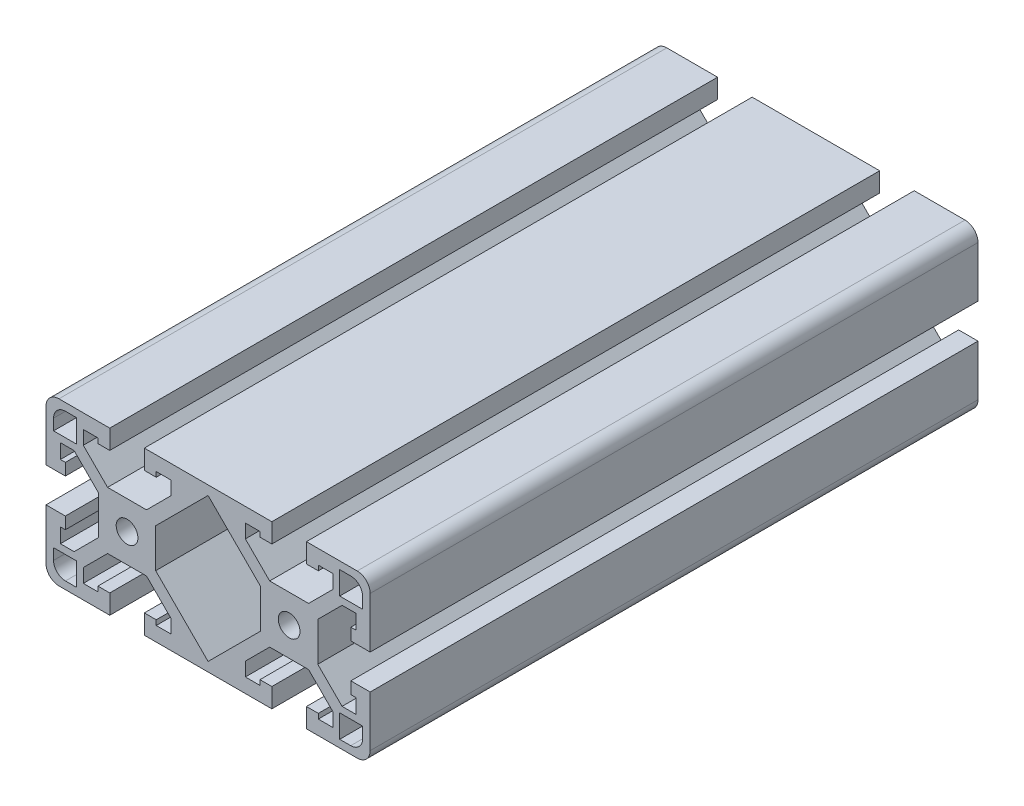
ISO-10303-21;
HEADER;
FILE_DESCRIPTION(('STEP AP214'),'2;1');
FILE_NAME('part.step','',(''),(''),'','','');
FILE_SCHEMA(('AUTOMOTIVE_DESIGN { 1 0 10303 214 1 1 1 1 }'));
ENDSEC;
DATA;
#1=APPLICATION_CONTEXT('core data for automotive mechanical design processes');
#2=APPLICATION_PROTOCOL_DEFINITION('international standard','automotive_design',2000,#1);
#3=PRODUCT_CONTEXT('',#1,'mechanical');
#4=PRODUCT('Part','Part','',(#3));
#5=PRODUCT_RELATED_PRODUCT_CATEGORY('part','',(#4));
#6=PRODUCT_DEFINITION_FORMATION('','',#4);
#7=PRODUCT_DEFINITION_CONTEXT('part definition',#1,'design');
#8=PRODUCT_DEFINITION('design','',#6,#7);
#9=PRODUCT_DEFINITION_SHAPE('','',#8);
#10=(LENGTH_UNIT() NAMED_UNIT(*) SI_UNIT(.MILLI.,.METRE.));
#11=(NAMED_UNIT(*) PLANE_ANGLE_UNIT() SI_UNIT($,.RADIAN.));
#12=(NAMED_UNIT(*) SI_UNIT($,.STERADIAN.) SOLID_ANGLE_UNIT());
#13=UNCERTAINTY_MEASURE_WITH_UNIT(LENGTH_MEASURE(1.E-05),#10,'distance_accuracy_value','');
#14=(GEOMETRIC_REPRESENTATION_CONTEXT(3) GLOBAL_UNCERTAINTY_ASSIGNED_CONTEXT((#13)) GLOBAL_UNIT_ASSIGNED_CONTEXT((#10,
#11,#12)) REPRESENTATION_CONTEXT('',''));
#15=CARTESIAN_POINT('',(0.,0.,0.));
#16=DIRECTION('',(0.,0.,1.));
#17=DIRECTION('',(1.,0.,0.));
#18=AXIS2_PLACEMENT_3D('',#15,#16,#17);
#19=CARTESIAN_POINT('',(-35.0519999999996,16.0020000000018,71.4375));
#20=DIRECTION('',(0.,0.,1.));
#21=DIRECTION('',(1.,0.,0.));
#22=AXIS2_PLACEMENT_3D('',#19,#20,#21);
#23=PLANE('',#22);
#24=CARTESIAN_POINT('',(-19.0499999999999,7.41594285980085E-13,71.4375));
#25=DIRECTION('',(0.,0.,1.));
#26=DIRECTION('',(1.,0.,0.));
#27=AXIS2_PLACEMENT_3D('',#24,#25,#26);
#28=CIRCLE('',#27,2.55270000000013);
#29=CARTESIAN_POINT('',(-16.4972999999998,7.41594285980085E-13,71.4375));
#30=VERTEX_POINT('',#29);
#31=EDGE_CURVE('E921',#30,#30,#28,.T.);
#32=ORIENTED_EDGE('',*,*,#31,.F.);
#33=EDGE_LOOP('',(#32));
#34=FACE_BOUND('',#33,.T.);
#35=DIRECTION('',(-0.707106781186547,0.707106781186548,0.));
#36=VECTOR('',#35,1.);
#37=CARTESIAN_POINT('',(-23.6257385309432,6.73100000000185,71.4375));
#38=LINE('',#37,#36);
#39=CARTESIAN_POINT('',(-23.6257385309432,6.73100000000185,71.4375));
#40=VERTEX_POINT('',#39);
#41=CARTESIAN_POINT('',(-29.3369999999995,12.4422614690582,71.4375));
#42=VERTEX_POINT('',#41);
#43=EDGE_CURVE('E972',#40,#42,#38,.T.);
#44=ORIENTED_EDGE('',*,*,#43,.T.);
#45=DIRECTION('',(0.,1.,0.));
#46=VECTOR('',#45,1.);
#47=CARTESIAN_POINT('',(-29.3369999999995,12.4422614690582,71.4375));
#48=LINE('',#47,#46);
#49=CARTESIAN_POINT('',(-29.3369999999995,15.6718000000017,71.4375));
#50=VERTEX_POINT('',#49);
#51=EDGE_CURVE('E975',#42,#50,#48,.T.);
#52=ORIENTED_EDGE('',*,*,#51,.T.);
#53=DIRECTION('',(1.,0.,0.));
#54=VECTOR('',#53,1.);
#55=CARTESIAN_POINT('',(-29.3369999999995,15.6718000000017,71.4375));
#56=LINE('',#55,#54);
#57=CARTESIAN_POINT('',(-25.9079999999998,15.6718000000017,71.4375));
#58=VERTEX_POINT('',#57);
#59=EDGE_CURVE('E978',#50,#58,#56,.T.);
#60=ORIENTED_EDGE('',*,*,#59,.T.);
#61=DIRECTION('',(0.,-1.,0.));
#62=VECTOR('',#61,1.);
#63=CARTESIAN_POINT('',(-25.9079999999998,15.6718000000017,71.4375));
#64=LINE('',#63,#62);
#65=CARTESIAN_POINT('',(-25.9079999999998,14.5034000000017,71.4375));
#66=VERTEX_POINT('',#65);
#67=EDGE_CURVE('E980',#58,#66,#64,.T.);
#68=ORIENTED_EDGE('',*,*,#67,.T.);
#69=DIRECTION('',(1.,0.,0.));
#70=VECTOR('',#69,1.);
#71=CARTESIAN_POINT('',(-25.9079999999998,14.5034000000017,71.4375));
#72=LINE('',#71,#70);
#73=CARTESIAN_POINT('',(-23.1139999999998,14.5034000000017,71.4375));
#74=VERTEX_POINT('',#73);
#75=EDGE_CURVE('E982',#66,#74,#72,.T.);
#76=ORIENTED_EDGE('',*,*,#75,.T.);
#77=DIRECTION('',(0.,1.,0.));
#78=VECTOR('',#77,1.);
#79=CARTESIAN_POINT('',(-23.1139999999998,14.5034000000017,71.4375));
#80=LINE('',#79,#78);
#81=CARTESIAN_POINT('',(-23.1139999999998,19.0500000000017,71.4375));
#82=VERTEX_POINT('',#81);
#83=EDGE_CURVE('E984',#74,#82,#80,.T.);
#84=ORIENTED_EDGE('',*,*,#83,.T.);
#85=DIRECTION('',(-1.,0.,0.));
#86=VECTOR('',#85,1.);
#87=CARTESIAN_POINT('',(-23.1139999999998,19.0500000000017,71.4375));
#88=LINE('',#87,#86);
#89=CARTESIAN_POINT('',(-35.0519999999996,19.0500000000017,71.4375));
#90=VERTEX_POINT('',#89);
#91=EDGE_CURVE('E986',#82,#90,#88,.T.);
#92=ORIENTED_EDGE('',*,*,#91,.T.);
#93=CARTESIAN_POINT('',(-35.0519999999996,16.0020000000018,71.4375));
#94=DIRECTION('',(0.,0.,1.));
#95=DIRECTION('',(1.,0.,0.));
#96=AXIS2_PLACEMENT_3D('',#93,#94,#95);
#97=CIRCLE('',#96,3.04799999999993);
#98=CARTESIAN_POINT('',(-38.0999999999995,16.0020000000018,71.4375));
#99=VERTEX_POINT('',#98);
#100=EDGE_CURVE('E988',#90,#99,#97,.T.);
#101=ORIENTED_EDGE('',*,*,#100,.T.);
#102=DIRECTION('',(0.,-1.,0.));
#103=VECTOR('',#102,1.);
#104=CARTESIAN_POINT('',(-38.0999999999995,16.0020000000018,71.4375));
#105=LINE('',#104,#103);
#106=CARTESIAN_POINT('',(-38.0999999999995,4.06400000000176,71.4375));
#107=VERTEX_POINT('',#106);
#108=EDGE_CURVE('E990',#99,#107,#105,.T.);
#109=ORIENTED_EDGE('',*,*,#108,.T.);
#110=DIRECTION('',(1.,0.,0.));
#111=VECTOR('',#110,1.);
#112=CARTESIAN_POINT('',(-38.0999999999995,4.06400000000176,71.4375));
#113=LINE('',#112,#111);
#114=CARTESIAN_POINT('',(-33.5533999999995,4.06400000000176,71.4375));
#115=VERTEX_POINT('',#114);
#116=EDGE_CURVE('E992',#107,#115,#113,.T.);
#117=ORIENTED_EDGE('',*,*,#116,.T.);
#118=DIRECTION('',(0.,1.,0.));
#119=VECTOR('',#118,1.);
#120=CARTESIAN_POINT('',(-33.5533999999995,4.06400000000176,71.4375));
#121=LINE('',#120,#119);
#122=CARTESIAN_POINT('',(-33.5533999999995,6.85800000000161,71.4375));
#123=VERTEX_POINT('',#122);
#124=EDGE_CURVE('E994',#115,#123,#121,.T.);
#125=ORIENTED_EDGE('',*,*,#124,.T.);
#126=DIRECTION('',(-1.,0.,0.));
#127=VECTOR('',#126,1.);
#128=CARTESIAN_POINT('',(-33.5533999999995,6.85800000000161,71.4375));
#129=LINE('',#128,#127);
#130=CARTESIAN_POINT('',(-34.7217999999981,6.85800000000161,71.4375));
#131=VERTEX_POINT('',#130);
#132=EDGE_CURVE('E996',#123,#131,#129,.T.);
#133=ORIENTED_EDGE('',*,*,#132,.T.);
#134=DIRECTION('',(0.,1.,0.));
#135=VECTOR('',#134,1.);
#136=CARTESIAN_POINT('',(-34.7217999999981,6.85800000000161,71.4375));
#137=LINE('',#136,#135);
#138=CARTESIAN_POINT('',(-34.7217999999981,10.2870000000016,71.4375));
#139=VERTEX_POINT('',#138);
#140=EDGE_CURVE('E998',#131,#139,#137,.T.);
#141=ORIENTED_EDGE('',*,*,#140,.T.);
#142=DIRECTION('',(1.,0.,0.));
#143=VECTOR('',#142,1.);
#144=CARTESIAN_POINT('',(-34.7217999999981,10.2870000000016,71.4375));
#145=LINE('',#144,#143);
#146=CARTESIAN_POINT('',(-31.492261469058,10.2870000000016,71.4375));
#147=VERTEX_POINT('',#146);
#148=EDGE_CURVE('E1000',#139,#147,#145,.T.);
#149=ORIENTED_EDGE('',*,*,#148,.T.);
#150=DIRECTION('',(0.707106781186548,-0.707106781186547,0.));
#151=VECTOR('',#150,1.);
#152=CARTESIAN_POINT('',(-31.492261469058,10.2870000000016,71.4375));
#153=LINE('',#152,#151);
#154=CARTESIAN_POINT('',(-25.7810000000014,4.57573853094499,71.4375));
#155=VERTEX_POINT('',#154);
#156=EDGE_CURVE('E1002',#147,#155,#153,.T.);
#157=ORIENTED_EDGE('',*,*,#156,.T.);
#158=DIRECTION('',(0.,-1.,0.));
#159=VECTOR('',#158,1.);
#160=CARTESIAN_POINT('',(-25.7810000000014,4.57573853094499,71.4375));
#161=LINE('',#160,#159);
#162=CARTESIAN_POINT('',(-25.7810000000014,-4.57573853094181,71.4375));
#163=VERTEX_POINT('',#162);
#164=EDGE_CURVE('E1004',#155,#163,#161,.T.);
#165=ORIENTED_EDGE('',*,*,#164,.T.);
#166=DIRECTION('',(-0.707106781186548,-0.707106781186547,0.));
#167=VECTOR('',#166,1.);
#168=CARTESIAN_POINT('',(-25.7810000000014,-4.57573853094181,71.4375));
#169=LINE('',#168,#167);
#170=CARTESIAN_POINT('',(-31.492261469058,-10.2869999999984,71.4375));
#171=VERTEX_POINT('',#170);
#172=EDGE_CURVE('E1006',#163,#171,#169,.T.);
#173=ORIENTED_EDGE('',*,*,#172,.T.);
#174=DIRECTION('',(-1.,0.,0.));
#175=VECTOR('',#174,1.);
#176=CARTESIAN_POINT('',(-31.492261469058,-10.2869999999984,71.4375));
#177=LINE('',#176,#175);
#178=CARTESIAN_POINT('',(-34.7217999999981,-10.2869999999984,71.4375));
#179=VERTEX_POINT('',#178);
#180=EDGE_CURVE('E1008',#171,#179,#177,.T.);
#181=ORIENTED_EDGE('',*,*,#180,.T.);
#182=DIRECTION('',(0.,1.,0.));
#183=VECTOR('',#182,1.);
#184=CARTESIAN_POINT('',(-34.7217999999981,-10.2869999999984,71.4375));
#185=LINE('',#184,#183);
#186=CARTESIAN_POINT('',(-34.7217999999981,-6.85799999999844,71.4375));
#187=VERTEX_POINT('',#186);
#188=EDGE_CURVE('E1010',#179,#187,#185,.T.);
#189=ORIENTED_EDGE('',*,*,#188,.T.);
#190=DIRECTION('',(1.,0.,0.));
#191=VECTOR('',#190,1.);
#192=CARTESIAN_POINT('',(-34.7217999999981,-6.85799999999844,71.4375));
#193=LINE('',#192,#191);
#194=CARTESIAN_POINT('',(-33.5533999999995,-6.85799999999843,71.4375));
#195=VERTEX_POINT('',#194);
#196=EDGE_CURVE('E1012',#187,#195,#193,.T.);
#197=ORIENTED_EDGE('',*,*,#196,.T.);
#198=DIRECTION('',(0.,1.,0.));
#199=VECTOR('',#198,1.);
#200=CARTESIAN_POINT('',(-33.5533999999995,-6.85799999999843,71.4375));
#201=LINE('',#200,#199);
#202=CARTESIAN_POINT('',(-33.5533999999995,-4.06399999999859,71.4375));
#203=VERTEX_POINT('',#202);
#204=EDGE_CURVE('E1014',#195,#203,#201,.T.);
#205=ORIENTED_EDGE('',*,*,#204,.T.);
#206=DIRECTION('',(-1.,0.,0.));
#207=VECTOR('',#206,1.);
#208=CARTESIAN_POINT('',(-33.5533999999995,-4.06399999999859,71.4375));
#209=LINE('',#208,#207);
#210=CARTESIAN_POINT('',(-38.0999999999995,-4.06399999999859,71.4375));
#211=VERTEX_POINT('',#210);
#212=EDGE_CURVE('E1016',#203,#211,#209,.T.);
#213=ORIENTED_EDGE('',*,*,#212,.T.);
#214=DIRECTION('',(0.,-1.,0.));
#215=VECTOR('',#214,1.);
#216=CARTESIAN_POINT('',(-38.0999999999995,-4.06399999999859,71.4375));
#217=LINE('',#216,#215);
#218=CARTESIAN_POINT('',(-38.0999999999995,-16.0019999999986,71.4375));
#219=VERTEX_POINT('',#218);
#220=EDGE_CURVE('E1018',#211,#219,#217,.T.);
#221=ORIENTED_EDGE('',*,*,#220,.T.);
#222=CARTESIAN_POINT('',(-35.0519999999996,-16.0019999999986,71.4375));
#223=DIRECTION('',(0.,0.,1.));
#224=DIRECTION('',(1.,0.,0.));
#225=AXIS2_PLACEMENT_3D('',#222,#223,#224);
#226=CIRCLE('',#225,3.04799999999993);
#227=CARTESIAN_POINT('',(-35.0519999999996,-19.0499999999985,71.4375));
#228=VERTEX_POINT('',#227);
#229=EDGE_CURVE('E1020',#219,#228,#226,.T.);
#230=ORIENTED_EDGE('',*,*,#229,.T.);
#231=DIRECTION('',(1.,0.,0.));
#232=VECTOR('',#231,1.);
#233=CARTESIAN_POINT('',(-35.0519999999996,-19.0499999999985,71.4375));
#234=LINE('',#233,#232);
#235=CARTESIAN_POINT('',(-23.1139999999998,-19.0499999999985,71.4375));
#236=VERTEX_POINT('',#235);
#237=EDGE_CURVE('E1022',#228,#236,#234,.T.);
#238=ORIENTED_EDGE('',*,*,#237,.T.);
#239=DIRECTION('',(0.,1.,0.));
#240=VECTOR('',#239,1.);
#241=CARTESIAN_POINT('',(-23.1139999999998,-19.0499999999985,71.4375));
#242=LINE('',#241,#240);
#243=CARTESIAN_POINT('',(-23.1139999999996,-14.5033999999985,71.4375));
#244=VERTEX_POINT('',#243);
#245=EDGE_CURVE('E1024',#236,#244,#242,.T.);
#246=ORIENTED_EDGE('',*,*,#245,.T.);
#247=DIRECTION('',(-1.,0.,0.));
#248=VECTOR('',#247,1.);
#249=CARTESIAN_POINT('',(-23.1139999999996,-14.5033999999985,71.4375));
#250=LINE('',#249,#248);
#251=CARTESIAN_POINT('',(-25.9079999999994,-14.5033999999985,71.4375));
#252=VERTEX_POINT('',#251);
#253=EDGE_CURVE('E1026',#244,#252,#250,.T.);
#254=ORIENTED_EDGE('',*,*,#253,.T.);
#255=DIRECTION('',(0.,-1.,0.));
#256=VECTOR('',#255,1.);
#257=CARTESIAN_POINT('',(-25.9079999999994,-14.5033999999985,71.4375));
#258=LINE('',#257,#256);
#259=CARTESIAN_POINT('',(-25.9079999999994,-15.6717999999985,71.4375));
#260=VERTEX_POINT('',#259);
#261=EDGE_CURVE('E1028',#252,#260,#258,.T.);
#262=ORIENTED_EDGE('',*,*,#261,.T.);
#263=DIRECTION('',(-1.,0.,0.));
#264=VECTOR('',#263,1.);
#265=CARTESIAN_POINT('',(-25.9079999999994,-15.6717999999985,71.4375));
#266=LINE('',#265,#264);
#267=CARTESIAN_POINT('',(-29.3369999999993,-15.6717999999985,71.4375));
#268=VERTEX_POINT('',#267);
#269=EDGE_CURVE('E1030',#260,#268,#266,.T.);
#270=ORIENTED_EDGE('',*,*,#269,.T.);
#271=DIRECTION('',(0.,1.,0.));
#272=VECTOR('',#271,1.);
#273=CARTESIAN_POINT('',(-29.3369999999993,-15.6717999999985,71.4375));
#274=LINE('',#273,#272);
#275=CARTESIAN_POINT('',(-29.3369999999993,-12.442261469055,71.4375));
#276=VERTEX_POINT('',#275);
#277=EDGE_CURVE('E1032',#268,#276,#274,.T.);
#278=ORIENTED_EDGE('',*,*,#277,.T.);
#279=DIRECTION('',(0.70710678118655,0.707106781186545,0.));
#280=VECTOR('',#279,1.);
#281=CARTESIAN_POINT('',(-29.3369999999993,-12.442261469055,71.4375));
#282=LINE('',#281,#280);
#283=CARTESIAN_POINT('',(-23.6257385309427,-6.73099999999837,71.4375));
#284=VERTEX_POINT('',#283);
#285=EDGE_CURVE('E1034',#276,#284,#282,.T.);
#286=ORIENTED_EDGE('',*,*,#285,.T.);
#287=DIRECTION('',(1.,0.,0.));
#288=VECTOR('',#287,1.);
#289=CARTESIAN_POINT('',(-23.6257385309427,-6.73099999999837,71.4375));
#290=LINE('',#289,#288);
#291=CARTESIAN_POINT('',(-14.4742614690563,-6.73099999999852,71.4375));
#292=VERTEX_POINT('',#291);
#293=EDGE_CURVE('E1036',#284,#292,#290,.T.);
#294=ORIENTED_EDGE('',*,*,#293,.T.);
#295=DIRECTION('',(0.707106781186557,-0.707106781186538,0.));
#296=VECTOR('',#295,1.);
#297=CARTESIAN_POINT('',(-14.4742614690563,-6.73099999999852,71.4375));
#298=LINE('',#297,#296);
#299=CARTESIAN_POINT('',(-8.76299999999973,-12.442261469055,71.4375));
#300=VERTEX_POINT('',#299);
#301=EDGE_CURVE('E1038',#292,#300,#298,.T.);
#302=ORIENTED_EDGE('',*,*,#301,.T.);
#303=DIRECTION('',(0.,-1.,0.));
#304=VECTOR('',#303,1.);
#305=CARTESIAN_POINT('',(-8.76299999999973,-12.442261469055,71.4375));
#306=LINE('',#305,#304);
#307=CARTESIAN_POINT('',(-8.76299999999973,-15.6717999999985,71.4375));
#308=VERTEX_POINT('',#307);
#309=EDGE_CURVE('E1040',#300,#308,#306,.T.);
#310=ORIENTED_EDGE('',*,*,#309,.T.);
#311=DIRECTION('',(-1.,0.,0.));
#312=VECTOR('',#311,1.);
#313=CARTESIAN_POINT('',(-8.76299999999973,-15.6717999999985,71.4375));
#314=LINE('',#313,#312);
#315=CARTESIAN_POINT('',(-12.1919999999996,-15.6717999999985,71.4375));
#316=VERTEX_POINT('',#315);
#317=EDGE_CURVE('E1042',#308,#316,#314,.T.);
#318=ORIENTED_EDGE('',*,*,#317,.T.);
#319=DIRECTION('',(0.,1.,0.));
#320=VECTOR('',#319,1.);
#321=CARTESIAN_POINT('',(-12.1919999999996,-15.6717999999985,71.4375));
#322=LINE('',#321,#320);
#323=CARTESIAN_POINT('',(-12.1919999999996,-14.5033999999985,71.4375));
#324=VERTEX_POINT('',#323);
#325=EDGE_CURVE('E1044',#316,#324,#322,.T.);
#326=ORIENTED_EDGE('',*,*,#325,.T.);
#327=DIRECTION('',(-1.,0.,0.));
#328=VECTOR('',#327,1.);
#329=CARTESIAN_POINT('',(-12.1919999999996,-14.5033999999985,71.4375));
#330=LINE('',#329,#328);
#331=CARTESIAN_POINT('',(-14.9859999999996,-14.5033999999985,71.4375));
#332=VERTEX_POINT('',#331);
#333=EDGE_CURVE('E1046',#324,#332,#330,.T.);
#334=ORIENTED_EDGE('',*,*,#333,.T.);
#335=DIRECTION('',(0.,-1.,0.));
#336=VECTOR('',#335,1.);
#337=CARTESIAN_POINT('',(-14.9859999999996,-14.5033999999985,71.4375));
#338=LINE('',#337,#336);
#339=CARTESIAN_POINT('',(-14.9859999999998,-19.0499999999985,71.4375));
#340=VERTEX_POINT('',#339);
#341=EDGE_CURVE('E1048',#332,#340,#338,.T.);
#342=ORIENTED_EDGE('',*,*,#341,.T.);
#343=DIRECTION('',(1.,0.,0.));
#344=VECTOR('',#343,1.);
#345=CARTESIAN_POINT('',(-14.9859999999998,-19.0499999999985,71.4375));
#346=LINE('',#345,#344);
#347=CARTESIAN_POINT('',(14.986,-19.0499999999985,71.4375));
#348=VERTEX_POINT('',#347);
#349=EDGE_CURVE('E1050',#340,#348,#346,.T.);
#350=ORIENTED_EDGE('',*,*,#349,.T.);
#351=DIRECTION('',(0.,1.,0.));
#352=VECTOR('',#351,1.);
#353=CARTESIAN_POINT('',(14.986,-19.0499999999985,71.4375));
#354=LINE('',#353,#352);
#355=CARTESIAN_POINT('',(14.9859999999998,-14.5033999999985,71.4375));
#356=VERTEX_POINT('',#355);
#357=EDGE_CURVE('E1052',#348,#356,#354,.T.);
#358=ORIENTED_EDGE('',*,*,#357,.T.);
#359=DIRECTION('',(-1.,0.,0.));
#360=VECTOR('',#359,1.);
#361=CARTESIAN_POINT('',(14.9859999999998,-14.5033999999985,71.4375));
#362=LINE('',#361,#360);
#363=CARTESIAN_POINT('',(12.1919999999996,-14.5033999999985,71.4375));
#364=VERTEX_POINT('',#363);
#365=EDGE_CURVE('E1054',#356,#364,#362,.T.);
#366=ORIENTED_EDGE('',*,*,#365,.T.);
#367=DIRECTION('',(0.,-1.,0.));
#368=VECTOR('',#367,1.);
#369=CARTESIAN_POINT('',(12.1919999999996,-14.5033999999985,71.4375));
#370=LINE('',#369,#368);
#371=CARTESIAN_POINT('',(12.1919999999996,-15.6717999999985,71.4375));
#372=VERTEX_POINT('',#371);
#373=EDGE_CURVE('E1056',#364,#372,#370,.T.);
#374=ORIENTED_EDGE('',*,*,#373,.T.);
#375=DIRECTION('',(-1.,0.,0.));
#376=VECTOR('',#375,1.);
#377=CARTESIAN_POINT('',(12.1919999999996,-15.6717999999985,71.4375));
#378=LINE('',#377,#376);
#379=CARTESIAN_POINT('',(8.76299999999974,-15.6717999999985,71.4375));
#380=VERTEX_POINT('',#379);
#381=EDGE_CURVE('E1058',#372,#380,#378,.T.);
#382=ORIENTED_EDGE('',*,*,#381,.T.);
#383=DIRECTION('',(0.,1.,0.));
#384=VECTOR('',#383,1.);
#385=CARTESIAN_POINT('',(8.76299999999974,-15.6717999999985,71.4375));
#386=LINE('',#385,#384);
#387=CARTESIAN_POINT('',(8.76299999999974,-12.442261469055,71.4375));
#388=VERTEX_POINT('',#387);
#389=EDGE_CURVE('E1060',#380,#388,#386,.T.);
#390=ORIENTED_EDGE('',*,*,#389,.T.);
#391=DIRECTION('',(0.70710678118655,0.707106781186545,0.));
#392=VECTOR('',#391,1.);
#393=CARTESIAN_POINT('',(8.76299999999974,-12.442261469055,71.4375));
#394=LINE('',#393,#392);
#395=CARTESIAN_POINT('',(14.4742614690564,-6.73099999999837,71.4375));
#396=VERTEX_POINT('',#395);
#397=EDGE_CURVE('E1062',#388,#396,#394,.T.);
#398=ORIENTED_EDGE('',*,*,#397,.T.);
#399=DIRECTION('',(1.,0.,0.));
#400=VECTOR('',#399,1.);
#401=CARTESIAN_POINT('',(14.4742614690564,-6.73099999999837,71.4375));
#402=LINE('',#401,#400);
#403=CARTESIAN_POINT('',(23.6257385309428,-6.73099999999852,71.4375));
#404=VERTEX_POINT('',#403);
#405=EDGE_CURVE('E1064',#396,#404,#402,.T.);
#406=ORIENTED_EDGE('',*,*,#405,.T.);
#407=DIRECTION('',(0.707106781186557,-0.707106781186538,0.));
#408=VECTOR('',#407,1.);
#409=CARTESIAN_POINT('',(23.6257385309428,-6.73099999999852,71.4375));
#410=LINE('',#409,#408);
#411=CARTESIAN_POINT('',(29.3369999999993,-12.442261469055,71.4375));
#412=VERTEX_POINT('',#411);
#413=EDGE_CURVE('E1066',#404,#412,#410,.T.);
#414=ORIENTED_EDGE('',*,*,#413,.T.);
#415=DIRECTION('',(0.,-1.,0.));
#416=VECTOR('',#415,1.);
#417=CARTESIAN_POINT('',(29.3369999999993,-12.442261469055,71.4375));
#418=LINE('',#417,#416);
#419=CARTESIAN_POINT('',(29.3369999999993,-15.6717999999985,71.4375));
#420=VERTEX_POINT('',#419);
#421=EDGE_CURVE('E1068',#412,#420,#418,.T.);
#422=ORIENTED_EDGE('',*,*,#421,.T.);
#423=DIRECTION('',(-1.,0.,0.));
#424=VECTOR('',#423,1.);
#425=CARTESIAN_POINT('',(29.3369999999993,-15.6717999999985,71.4375));
#426=LINE('',#425,#424);
#427=CARTESIAN_POINT('',(25.9079999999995,-15.6717999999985,71.4375));
#428=VERTEX_POINT('',#427);
#429=EDGE_CURVE('E1070',#420,#428,#426,.T.);
#430=ORIENTED_EDGE('',*,*,#429,.T.);
#431=DIRECTION('',(0.,1.,0.));
#432=VECTOR('',#431,1.);
#433=CARTESIAN_POINT('',(25.9079999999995,-15.6717999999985,71.4375));
#434=LINE('',#433,#432);
#435=CARTESIAN_POINT('',(25.9079999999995,-14.5033999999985,71.4375));
#436=VERTEX_POINT('',#435);
#437=EDGE_CURVE('E1072',#428,#436,#434,.T.);
#438=ORIENTED_EDGE('',*,*,#437,.T.);
#439=DIRECTION('',(-1.,0.,0.));
#440=VECTOR('',#439,1.);
#441=CARTESIAN_POINT('',(25.9079999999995,-14.5033999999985,71.4375));
#442=LINE('',#441,#440);
#443=CARTESIAN_POINT('',(23.1139999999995,-14.5033999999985,71.4375));
#444=VERTEX_POINT('',#443);
#445=EDGE_CURVE('E1074',#436,#444,#442,.T.);
#446=ORIENTED_EDGE('',*,*,#445,.T.);
#447=DIRECTION('',(0.,-1.,0.));
#448=VECTOR('',#447,1.);
#449=CARTESIAN_POINT('',(23.1139999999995,-14.5033999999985,71.4375));
#450=LINE('',#449,#448);
#451=CARTESIAN_POINT('',(23.1139999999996,-19.0499999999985,71.4375));
#452=VERTEX_POINT('',#451);
#453=EDGE_CURVE('E1076',#444,#452,#450,.T.);
#454=ORIENTED_EDGE('',*,*,#453,.T.);
#455=DIRECTION('',(1.,0.,0.));
#456=VECTOR('',#455,1.);
#457=CARTESIAN_POINT('',(23.1139999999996,-19.0499999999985,71.4375));
#458=LINE('',#457,#456);
#459=CARTESIAN_POINT('',(35.0519999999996,-19.0499999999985,71.4375));
#460=VERTEX_POINT('',#459);
#461=EDGE_CURVE('E1078',#452,#460,#458,.T.);
#462=ORIENTED_EDGE('',*,*,#461,.T.);
#463=CARTESIAN_POINT('',(35.0519999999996,-16.0019999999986,71.4375));
#464=DIRECTION('',(0.,0.,1.));
#465=DIRECTION('',(1.,0.,0.));
#466=AXIS2_PLACEMENT_3D('',#463,#464,#465);
#467=CIRCLE('',#466,3.04799999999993);
#468=CARTESIAN_POINT('',(38.0999999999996,-16.0019999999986,71.4375));
#469=VERTEX_POINT('',#468);
#470=EDGE_CURVE('E1080',#460,#469,#467,.T.);
#471=ORIENTED_EDGE('',*,*,#470,.T.);
#472=DIRECTION('',(0.,1.,0.));
#473=VECTOR('',#472,1.);
#474=CARTESIAN_POINT('',(38.0999999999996,-16.0019999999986,71.4375));
#475=LINE('',#474,#473);
#476=CARTESIAN_POINT('',(38.0999999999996,-4.06399999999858,71.4375));
#477=VERTEX_POINT('',#476);
#478=EDGE_CURVE('E1082',#469,#477,#475,.T.);
#479=ORIENTED_EDGE('',*,*,#478,.T.);
#480=DIRECTION('',(-1.,0.,0.));
#481=VECTOR('',#480,1.);
#482=CARTESIAN_POINT('',(38.0999999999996,-4.06399999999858,71.4375));
#483=LINE('',#482,#481);
#484=CARTESIAN_POINT('',(33.5533999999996,-4.06399999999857,71.4375));
#485=VERTEX_POINT('',#484);
#486=EDGE_CURVE('E1084',#477,#485,#483,.T.);
#487=ORIENTED_EDGE('',*,*,#486,.T.);
#488=DIRECTION('',(0.,-1.,0.));
#489=VECTOR('',#488,1.);
#490=CARTESIAN_POINT('',(33.5533999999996,-4.06399999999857,71.4375));
#491=LINE('',#490,#489);
#492=CARTESIAN_POINT('',(33.5533999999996,-6.85799999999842,71.4375));
#493=VERTEX_POINT('',#492);
#494=EDGE_CURVE('E1086',#485,#493,#491,.T.);
#495=ORIENTED_EDGE('',*,*,#494,.T.);
#496=DIRECTION('',(1.,0.,0.));
#497=VECTOR('',#496,1.);
#498=CARTESIAN_POINT('',(33.5533999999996,-6.85799999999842,71.4375));
#499=LINE('',#498,#497);
#500=CARTESIAN_POINT('',(34.7217999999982,-6.85799999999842,71.4375));
#501=VERTEX_POINT('',#500);
#502=EDGE_CURVE('E1088',#493,#501,#499,.T.);
#503=ORIENTED_EDGE('',*,*,#502,.T.);
#504=DIRECTION('',(0.,-1.,0.));
#505=VECTOR('',#504,1.);
#506=CARTESIAN_POINT('',(34.7217999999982,-6.85799999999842,71.4375));
#507=LINE('',#506,#505);
#508=CARTESIAN_POINT('',(34.7217999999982,-10.2869999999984,71.4375));
#509=VERTEX_POINT('',#508);
#510=EDGE_CURVE('E1090',#501,#509,#507,.T.);
#511=ORIENTED_EDGE('',*,*,#510,.T.);
#512=DIRECTION('',(-1.,0.,0.));
#513=VECTOR('',#512,1.);
#514=CARTESIAN_POINT('',(34.7217999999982,-10.2869999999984,71.4375));
#515=LINE('',#514,#513);
#516=CARTESIAN_POINT('',(31.492261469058,-10.2869999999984,71.4375));
#517=VERTEX_POINT('',#516);
#518=EDGE_CURVE('E1092',#509,#517,#515,.T.);
#519=ORIENTED_EDGE('',*,*,#518,.T.);
#520=DIRECTION('',(-0.707106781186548,0.707106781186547,0.));
#521=VECTOR('',#520,1.);
#522=CARTESIAN_POINT('',(31.492261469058,-10.2869999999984,71.4375));
#523=LINE('',#522,#521);
#524=CARTESIAN_POINT('',(25.7810000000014,-4.5757385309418,71.4375));
#525=VERTEX_POINT('',#524);
#526=EDGE_CURVE('E1094',#517,#525,#523,.T.);
#527=ORIENTED_EDGE('',*,*,#526,.T.);
#528=DIRECTION('',(0.,1.,0.));
#529=VECTOR('',#528,1.);
#530=CARTESIAN_POINT('',(25.7810000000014,-4.5757385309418,71.4375));
#531=LINE('',#530,#529);
#532=CARTESIAN_POINT('',(25.7810000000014,4.57573853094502,71.4375));
#533=VERTEX_POINT('',#532);
#534=EDGE_CURVE('E1096',#525,#533,#531,.T.);
#535=ORIENTED_EDGE('',*,*,#534,.T.);
#536=DIRECTION('',(0.707106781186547,0.707106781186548,0.));
#537=VECTOR('',#536,1.);
#538=CARTESIAN_POINT('',(25.7810000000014,4.57573853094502,71.4375));
#539=LINE('',#538,#537);
#540=CARTESIAN_POINT('',(31.492261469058,10.2870000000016,71.4375));
#541=VERTEX_POINT('',#540);
#542=EDGE_CURVE('E1098',#533,#541,#539,.T.);
#543=ORIENTED_EDGE('',*,*,#542,.T.);
#544=DIRECTION('',(1.,0.,0.));
#545=VECTOR('',#544,1.);
#546=CARTESIAN_POINT('',(31.492261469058,10.2870000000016,71.4375));
#547=LINE('',#546,#545);
#548=CARTESIAN_POINT('',(34.7217999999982,10.2870000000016,71.4375));
#549=VERTEX_POINT('',#548);
#550=EDGE_CURVE('E1100',#541,#549,#547,.T.);
#551=ORIENTED_EDGE('',*,*,#550,.T.);
#552=DIRECTION('',(0.,-1.,0.));
#553=VECTOR('',#552,1.);
#554=CARTESIAN_POINT('',(34.7217999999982,10.2870000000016,71.4375));
#555=LINE('',#554,#553);
#556=CARTESIAN_POINT('',(34.7217999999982,6.85800000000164,71.4375));
#557=VERTEX_POINT('',#556);
#558=EDGE_CURVE('E1102',#549,#557,#555,.T.);
#559=ORIENTED_EDGE('',*,*,#558,.T.);
#560=DIRECTION('',(-1.,0.,0.));
#561=VECTOR('',#560,1.);
#562=CARTESIAN_POINT('',(34.7217999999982,6.85800000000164,71.4375));
#563=LINE('',#562,#561);
#564=CARTESIAN_POINT('',(33.5533999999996,6.85800000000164,71.4375));
#565=VERTEX_POINT('',#564);
#566=EDGE_CURVE('E1104',#557,#565,#563,.T.);
#567=ORIENTED_EDGE('',*,*,#566,.T.);
#568=DIRECTION('',(0.,-1.,0.));
#569=VECTOR('',#568,1.);
#570=CARTESIAN_POINT('',(33.5533999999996,6.85800000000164,71.4375));
#571=LINE('',#570,#569);
#572=CARTESIAN_POINT('',(33.5533999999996,4.06400000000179,71.4375));
#573=VERTEX_POINT('',#572);
#574=EDGE_CURVE('E1106',#565,#573,#571,.T.);
#575=ORIENTED_EDGE('',*,*,#574,.T.);
#576=DIRECTION('',(1.,0.,0.));
#577=VECTOR('',#576,1.);
#578=CARTESIAN_POINT('',(33.5533999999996,4.06400000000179,71.4375));
#579=LINE('',#578,#577);
#580=CARTESIAN_POINT('',(38.0999999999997,4.06400000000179,71.4375));
#581=VERTEX_POINT('',#580);
#582=EDGE_CURVE('E1108',#573,#581,#579,.T.);
#583=ORIENTED_EDGE('',*,*,#582,.T.);
#584=DIRECTION('',(0.,1.,0.));
#585=VECTOR('',#584,1.);
#586=CARTESIAN_POINT('',(38.0999999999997,4.06400000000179,71.4375));
#587=LINE('',#586,#585);
#588=CARTESIAN_POINT('',(38.0999999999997,16.0020000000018,71.4375));
#589=VERTEX_POINT('',#588);
#590=EDGE_CURVE('E1110',#581,#589,#587,.T.);
#591=ORIENTED_EDGE('',*,*,#590,.T.);
#592=CARTESIAN_POINT('',(35.0519999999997,16.0020000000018,71.4375));
#593=DIRECTION('',(0.,0.,1.));
#594=DIRECTION('',(1.,0.,0.));
#595=AXIS2_PLACEMENT_3D('',#592,#593,#594);
#596=CIRCLE('',#595,3.04799999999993);
#597=CARTESIAN_POINT('',(35.0519999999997,19.0500000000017,71.4375));
#598=VERTEX_POINT('',#597);
#599=EDGE_CURVE('E1112',#589,#598,#596,.T.);
#600=ORIENTED_EDGE('',*,*,#599,.T.);
#601=DIRECTION('',(-1.,0.,0.));
#602=VECTOR('',#601,1.);
#603=CARTESIAN_POINT('',(35.0519999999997,19.0500000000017,71.4375));
#604=LINE('',#603,#602);
#605=CARTESIAN_POINT('',(23.114,19.0500000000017,71.4375));
#606=VERTEX_POINT('',#605);
#607=EDGE_CURVE('E1114',#598,#606,#604,.T.);
#608=ORIENTED_EDGE('',*,*,#607,.T.);
#609=DIRECTION('',(0.,-1.,0.));
#610=VECTOR('',#609,1.);
#611=CARTESIAN_POINT('',(23.114,19.0500000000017,71.4375));
#612=LINE('',#611,#610);
#613=CARTESIAN_POINT('',(23.114,14.5034000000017,71.4375));
#614=VERTEX_POINT('',#613);
#615=EDGE_CURVE('E1116',#606,#614,#612,.T.);
#616=ORIENTED_EDGE('',*,*,#615,.T.);
#617=DIRECTION('',(1.,0.,0.));
#618=VECTOR('',#617,1.);
#619=CARTESIAN_POINT('',(23.114,14.5034000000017,71.4375));
#620=LINE('',#619,#618);
#621=CARTESIAN_POINT('',(25.908,14.5034000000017,71.4375));
#622=VERTEX_POINT('',#621);
#623=EDGE_CURVE('E1118',#614,#622,#620,.T.);
#624=ORIENTED_EDGE('',*,*,#623,.T.);
#625=DIRECTION('',(0.,1.,0.));
#626=VECTOR('',#625,1.);
#627=CARTESIAN_POINT('',(25.908,14.5034000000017,71.4375));
#628=LINE('',#627,#626);
#629=CARTESIAN_POINT('',(25.908,15.6718000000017,71.4375));
#630=VERTEX_POINT('',#629);
#631=EDGE_CURVE('E1120',#622,#630,#628,.T.);
#632=ORIENTED_EDGE('',*,*,#631,.T.);
#633=DIRECTION('',(1.,0.,0.));
#634=VECTOR('',#633,1.);
#635=CARTESIAN_POINT('',(25.908,15.6718000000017,71.4375));
#636=LINE('',#635,#634);
#637=CARTESIAN_POINT('',(29.3369999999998,15.6718000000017,71.4375));
#638=VERTEX_POINT('',#637);
#639=EDGE_CURVE('E1122',#630,#638,#636,.T.);
#640=ORIENTED_EDGE('',*,*,#639,.T.);
#641=DIRECTION('',(0.,-1.,0.));
#642=VECTOR('',#641,1.);
#643=CARTESIAN_POINT('',(29.3369999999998,15.6718000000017,71.4375));
#644=LINE('',#643,#642);
#645=CARTESIAN_POINT('',(29.3369999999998,12.4422614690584,71.4375));
#646=VERTEX_POINT('',#645);
#647=EDGE_CURVE('E1124',#638,#646,#644,.T.);
#648=ORIENTED_EDGE('',*,*,#647,.T.);
#649=DIRECTION('',(-0.707106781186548,-0.707106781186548,0.));
#650=VECTOR('',#649,1.);
#651=CARTESIAN_POINT('',(29.3369999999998,12.4422614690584,71.4375));
#652=LINE('',#651,#650);
#653=CARTESIAN_POINT('',(23.6257385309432,6.73100000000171,71.4375));
#654=VERTEX_POINT('',#653);
#655=EDGE_CURVE('E1126',#646,#654,#652,.T.);
#656=ORIENTED_EDGE('',*,*,#655,.T.);
#657=DIRECTION('',(-1.,0.,0.));
#658=VECTOR('',#657,1.);
#659=CARTESIAN_POINT('',(23.6257385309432,6.73100000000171,71.4375));
#660=LINE('',#659,#658);
#661=CARTESIAN_POINT('',(14.4742614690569,6.73100000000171,71.4375));
#662=VERTEX_POINT('',#661);
#663=EDGE_CURVE('E1128',#654,#662,#660,.T.);
#664=ORIENTED_EDGE('',*,*,#663,.T.);
#665=DIRECTION('',(-0.707106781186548,0.707106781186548,0.));
#666=VECTOR('',#665,1.);
#667=CARTESIAN_POINT('',(14.4742614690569,6.73100000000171,71.4375));
#668=LINE('',#667,#666);
#669=CARTESIAN_POINT('',(8.7630000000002,12.4422614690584,71.4375));
#670=VERTEX_POINT('',#669);
#671=EDGE_CURVE('E1130',#662,#670,#668,.T.);
#672=ORIENTED_EDGE('',*,*,#671,.T.);
#673=DIRECTION('',(0.,1.,0.));
#674=VECTOR('',#673,1.);
#675=CARTESIAN_POINT('',(8.7630000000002,12.4422614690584,71.4375));
#676=LINE('',#675,#674);
#677=CARTESIAN_POINT('',(8.7630000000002,15.671800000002,71.4375));
#678=VERTEX_POINT('',#677);
#679=EDGE_CURVE('E1132',#670,#678,#676,.T.);
#680=ORIENTED_EDGE('',*,*,#679,.T.);
#681=DIRECTION('',(1.,0.,0.));
#682=VECTOR('',#681,1.);
#683=CARTESIAN_POINT('',(8.7630000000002,15.671800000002,71.4375));
#684=LINE('',#683,#682);
#685=CARTESIAN_POINT('',(12.1920000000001,15.671800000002,71.4375));
#686=VERTEX_POINT('',#685);
#687=EDGE_CURVE('E1134',#678,#686,#684,.T.);
#688=ORIENTED_EDGE('',*,*,#687,.T.);
#689=DIRECTION('',(0.,-1.,0.));
#690=VECTOR('',#689,1.);
#691=CARTESIAN_POINT('',(12.1920000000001,15.671800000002,71.4375));
#692=LINE('',#691,#690);
#693=CARTESIAN_POINT('',(12.1920000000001,14.503400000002,71.4375));
#694=VERTEX_POINT('',#693);
#695=EDGE_CURVE('E1136',#686,#694,#692,.T.);
#696=ORIENTED_EDGE('',*,*,#695,.T.);
#697=DIRECTION('',(1.,0.,0.));
#698=VECTOR('',#697,1.);
#699=CARTESIAN_POINT('',(12.1920000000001,14.503400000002,71.4375));
#700=LINE('',#699,#698);
#701=CARTESIAN_POINT('',(14.9860000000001,14.503400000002,71.4375));
#702=VERTEX_POINT('',#701);
#703=EDGE_CURVE('E1138',#694,#702,#700,.T.);
#704=ORIENTED_EDGE('',*,*,#703,.T.);
#705=DIRECTION('',(0.,1.,0.));
#706=VECTOR('',#705,1.);
#707=CARTESIAN_POINT('',(14.9860000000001,14.503400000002,71.4375));
#708=LINE('',#707,#706);
#709=CARTESIAN_POINT('',(14.9860000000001,19.050000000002,71.4375));
#710=VERTEX_POINT('',#709);
#711=EDGE_CURVE('E1140',#702,#710,#708,.T.);
#712=ORIENTED_EDGE('',*,*,#711,.T.);
#713=DIRECTION('',(-1.,0.,0.));
#714=VECTOR('',#713,1.);
#715=CARTESIAN_POINT('',(14.9860000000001,19.050000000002,71.4375));
#716=LINE('',#715,#714);
#717=CARTESIAN_POINT('',(-14.9859999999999,19.050000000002,71.4375));
#718=VERTEX_POINT('',#717);
#719=EDGE_CURVE('E1142',#710,#718,#716,.T.);
#720=ORIENTED_EDGE('',*,*,#719,.T.);
#721=DIRECTION('',(0.,-1.,0.));
#722=VECTOR('',#721,1.);
#723=CARTESIAN_POINT('',(-14.9859999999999,19.050000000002,71.4375));
#724=LINE('',#723,#722);
#725=CARTESIAN_POINT('',(-14.9859999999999,14.503400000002,71.4375));
#726=VERTEX_POINT('',#725);
#727=EDGE_CURVE('E1144',#718,#726,#724,.T.);
#728=ORIENTED_EDGE('',*,*,#727,.T.);
#729=DIRECTION('',(1.,0.,0.));
#730=VECTOR('',#729,1.);
#731=CARTESIAN_POINT('',(-14.9859999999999,14.503400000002,71.4375));
#732=LINE('',#731,#730);
#733=CARTESIAN_POINT('',(-12.1919999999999,14.503400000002,71.4375));
#734=VERTEX_POINT('',#733);
#735=EDGE_CURVE('E1146',#726,#734,#732,.T.);
#736=ORIENTED_EDGE('',*,*,#735,.T.);
#737=DIRECTION('',(0.,1.,0.));
#738=VECTOR('',#737,1.);
#739=CARTESIAN_POINT('',(-12.1919999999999,14.503400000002,71.4375));
#740=LINE('',#739,#738);
#741=CARTESIAN_POINT('',(-12.1919999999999,15.671800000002,71.4375));
#742=VERTEX_POINT('',#741);
#743=EDGE_CURVE('E1148',#734,#742,#740,.T.);
#744=ORIENTED_EDGE('',*,*,#743,.T.);
#745=DIRECTION('',(1.,0.,0.));
#746=VECTOR('',#745,1.);
#747=CARTESIAN_POINT('',(-12.1919999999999,15.671800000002,71.4375));
#748=LINE('',#747,#746);
#749=CARTESIAN_POINT('',(-8.76300000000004,15.671800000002,71.4375));
#750=VERTEX_POINT('',#749);
#751=EDGE_CURVE('E1150',#742,#750,#748,.T.);
#752=ORIENTED_EDGE('',*,*,#751,.T.);
#753=DIRECTION('',(0.,-1.,0.));
#754=VECTOR('',#753,1.);
#755=CARTESIAN_POINT('',(-8.76300000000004,15.671800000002,71.4375));
#756=LINE('',#755,#754);
#757=CARTESIAN_POINT('',(-8.76300000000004,12.4422614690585,71.4375));
#758=VERTEX_POINT('',#757);
#759=EDGE_CURVE('E1152',#750,#758,#756,.T.);
#760=ORIENTED_EDGE('',*,*,#759,.T.);
#761=DIRECTION('',(-0.707106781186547,-0.707106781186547,0.));
#762=VECTOR('',#761,1.);
#763=CARTESIAN_POINT('',(-8.76300000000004,12.4422614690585,71.4375));
#764=LINE('',#763,#762);
#765=CARTESIAN_POINT('',(-14.4742614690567,6.73100000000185,71.4375));
#766=VERTEX_POINT('',#765);
#767=EDGE_CURVE('E1154',#758,#766,#764,.T.);
#768=ORIENTED_EDGE('',*,*,#767,.T.);
#769=DIRECTION('',(-1.,0.,0.));
#770=VECTOR('',#769,1.);
#771=CARTESIAN_POINT('',(-14.4742614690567,6.73100000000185,71.4375));
#772=LINE('',#771,#770);
#773=EDGE_CURVE('E1156',#766,#40,#772,.T.);
#774=ORIENTED_EDGE('',*,*,#773,.T.);
#775=EDGE_LOOP('',(#44,#52,#60,#68,#76,#84,#92,#101,#109,#117,#125,#133,#141,#149,#157,#165,
#173,#181,#189,#197,#205,#213,#221,#230,#238,#246,#254,#262,#270,#278,#286,#294,#302,#310,#318,
#326,#334,#342,#350,#358,#366,#374,#382,#390,#398,#406,#414,#422,#430,#438,#446,#454,#462,#471,
#479,#487,#495,#503,#511,#519,#527,#535,#543,#551,#559,#567,#575,#583,#591,#600,#608,#616,#624,
#632,#640,#648,#656,#664,#672,#680,#688,#696,#704,#712,#720,#728,#736,#744,#752,#760,#768,#774));
#776=FACE_BOUND('',#775,.T.);
#777=DIRECTION('',(0.707106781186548,0.707106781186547,0.));
#778=VECTOR('',#777,1.);
#779=CARTESIAN_POINT('',(0.,-16.8947385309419,71.4375));
#780=LINE('',#779,#778);
#781=CARTESIAN_POINT('',(0.,-16.8947385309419,71.4375));
#782=VERTEX_POINT('',#781);
#783=CARTESIAN_POINT('',(12.3189999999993,-4.57573853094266,71.4375));
#784=VERTEX_POINT('',#783);
#785=EDGE_CURVE('E929',#782,#784,#780,.T.);
#786=ORIENTED_EDGE('',*,*,#785,.F.);
#787=DIRECTION('',(0.707106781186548,-0.707106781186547,0.));
#788=VECTOR('',#787,1.);
#789=CARTESIAN_POINT('',(-12.3189999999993,-4.57573853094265,71.4375));
#790=LINE('',#789,#788);
#791=CARTESIAN_POINT('',(-12.3189999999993,-4.57573853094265,71.4375));
#792=VERTEX_POINT('',#791);
#793=EDGE_CURVE('E927',#792,#782,#790,.T.);
#794=ORIENTED_EDGE('',*,*,#793,.F.);
#795=DIRECTION('',(0.,-1.,0.));
#796=VECTOR('',#795,1.);
#797=CARTESIAN_POINT('',(-12.3189999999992,4.57573853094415,71.4375));
#798=LINE('',#797,#796);
#799=CARTESIAN_POINT('',(-12.3189999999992,4.57573853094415,71.4375));
#800=VERTEX_POINT('',#799);
#801=EDGE_CURVE('E939',#800,#792,#798,.T.);
#802=ORIENTED_EDGE('',*,*,#801,.F.);
#803=DIRECTION('',(-0.707106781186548,-0.707106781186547,0.));
#804=VECTOR('',#803,1.);
#805=CARTESIAN_POINT('',(0.,16.8947385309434,71.4375));
#806=LINE('',#805,#804);
#807=CARTESIAN_POINT('',(0.,16.8947385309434,71.4375));
#808=VERTEX_POINT('',#807);
#809=EDGE_CURVE('E936',#808,#800,#806,.T.);
#810=ORIENTED_EDGE('',*,*,#809,.F.);
#811=DIRECTION('',(-0.707106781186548,0.707106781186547,0.));
#812=VECTOR('',#811,1.);
#813=CARTESIAN_POINT('',(12.3189999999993,4.57573853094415,71.4375));
#814=LINE('',#813,#812);
#815=CARTESIAN_POINT('',(12.3189999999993,4.57573853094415,71.4375));
#816=VERTEX_POINT('',#815);
#817=EDGE_CURVE('E934',#816,#808,#814,.T.);
#818=ORIENTED_EDGE('',*,*,#817,.F.);
#819=DIRECTION('',(0.,1.,0.));
#820=VECTOR('',#819,1.);
#821=CARTESIAN_POINT('',(12.3189999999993,-4.57573853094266,71.4375));
#822=LINE('',#821,#820);
#823=EDGE_CURVE('E932',#784,#816,#822,.T.);
#824=ORIENTED_EDGE('',*,*,#823,.F.);
#825=EDGE_LOOP('',(#786,#794,#802,#810,#818,#824));
#826=FACE_BOUND('',#825,.T.);
#827=CARTESIAN_POINT('',(19.0499999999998,7.50267903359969E-13,71.4375));
#828=DIRECTION('',(0.,0.,1.));
#829=DIRECTION('',(1.,0.,0.));
#830=AXIS2_PLACEMENT_3D('',#827,#828,#829);
#831=CIRCLE('',#830,2.5527);
#832=CARTESIAN_POINT('',(21.6026999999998,7.50267903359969E-13,71.4375));
#833=VERTEX_POINT('',#832);
#834=EDGE_CURVE('E915',#833,#833,#831,.T.);
#835=ORIENTED_EDGE('',*,*,#834,.F.);
#836=EDGE_LOOP('',(#835));
#837=FACE_BOUND('',#836,.T.);
#838=CARTESIAN_POINT('',(-33.5279999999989,14.478,71.4375));
#839=DIRECTION('',(0.,0.,1.));
#840=DIRECTION('',(1.,0.,0.));
#841=AXIS2_PLACEMENT_3D('',#838,#839,#840);
#842=CIRCLE('',#841,2.794);
#843=CARTESIAN_POINT('',(-33.5279999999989,17.272,71.4375));
#844=VERTEX_POINT('',#843);
#845=CARTESIAN_POINT('',(-36.3219999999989,14.478,71.4375));
#846=VERTEX_POINT('',#845);
#847=EDGE_CURVE('E879',#844,#846,#842,.T.);
#848=ORIENTED_EDGE('',*,*,#847,.F.);
#849=DIRECTION('',(-1.,0.,0.));
#850=VECTOR('',#849,1.);
#851=CARTESIAN_POINT('',(-30.9372,17.272,71.4375));
#852=LINE('',#851,#850);
#853=CARTESIAN_POINT('',(-30.9372,17.272,71.4375));
#854=VERTEX_POINT('',#853);
#855=EDGE_CURVE('E877',#854,#844,#852,.T.);
#856=ORIENTED_EDGE('',*,*,#855,.F.);
#857=DIRECTION('',(0.,1.,0.));
#858=VECTOR('',#857,1.);
#859=CARTESIAN_POINT('',(-30.9372,11.8872,71.4375));
#860=LINE('',#859,#858);
#861=CARTESIAN_POINT('',(-30.9372,11.8872,71.4375));
#862=VERTEX_POINT('',#861);
#863=EDGE_CURVE('E887',#862,#854,#860,.T.);
#864=ORIENTED_EDGE('',*,*,#863,.F.);
#865=DIRECTION('',(1.,0.,0.));
#866=VECTOR('',#865,1.);
#867=CARTESIAN_POINT('',(-36.3219999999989,11.8872,71.4375));
#868=LINE('',#867,#866);
#869=CARTESIAN_POINT('',(-36.3219999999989,11.8872,71.4375));
#870=VERTEX_POINT('',#869);
#871=EDGE_CURVE('E884',#870,#862,#868,.T.);
#872=ORIENTED_EDGE('',*,*,#871,.F.);
#873=DIRECTION('',(0.,-1.,0.));
#874=VECTOR('',#873,1.);
#875=CARTESIAN_POINT('',(-36.3219999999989,14.478,71.4375));
#876=LINE('',#875,#874);
#877=EDGE_CURVE('E882',#846,#870,#876,.T.);
#878=ORIENTED_EDGE('',*,*,#877,.F.);
#879=EDGE_LOOP('',(#848,#856,#864,#872,#878));
#880=FACE_BOUND('',#879,.T.);
#881=DIRECTION('',(0.,-1.,0.));
#882=VECTOR('',#881,1.);
#883=CARTESIAN_POINT('',(-36.3219999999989,-11.8871999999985,71.4375));
#884=LINE('',#883,#882);
#885=CARTESIAN_POINT('',(-36.3219999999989,-11.8871999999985,71.4375));
#886=VERTEX_POINT('',#885);
#887=CARTESIAN_POINT('',(-36.3219999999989,-14.4779999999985,71.4375));
#888=VERTEX_POINT('',#887);
#889=EDGE_CURVE('E841',#886,#888,#884,.T.);
#890=ORIENTED_EDGE('',*,*,#889,.F.);
#891=DIRECTION('',(-1.,0.,0.));
#892=VECTOR('',#891,1.);
#893=CARTESIAN_POINT('',(-30.9372,-11.8871999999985,71.4375));
#894=LINE('',#893,#892);
#895=CARTESIAN_POINT('',(-30.9372,-11.8871999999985,71.4375));
#896=VERTEX_POINT('',#895);
#897=EDGE_CURVE('E839',#896,#886,#894,.T.);
#898=ORIENTED_EDGE('',*,*,#897,.F.);
#899=DIRECTION('',(0.,1.,0.));
#900=VECTOR('',#899,1.);
#901=CARTESIAN_POINT('',(-30.9372,-17.2719999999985,71.4375));
#902=LINE('',#901,#900);
#903=CARTESIAN_POINT('',(-30.9372,-17.2719999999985,71.4375));
#904=VERTEX_POINT('',#903);
#905=EDGE_CURVE('E849',#904,#896,#902,.T.);
#906=ORIENTED_EDGE('',*,*,#905,.F.);
#907=DIRECTION('',(1.,0.,0.));
#908=VECTOR('',#907,1.);
#909=CARTESIAN_POINT('',(-33.5279999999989,-17.2719999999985,71.4375));
#910=LINE('',#909,#908);
#911=CARTESIAN_POINT('',(-33.5279999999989,-17.2719999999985,71.4375));
#912=VERTEX_POINT('',#911);
#913=EDGE_CURVE('E846',#912,#904,#910,.T.);
#914=ORIENTED_EDGE('',*,*,#913,.F.);
#915=CARTESIAN_POINT('',(-33.5279999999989,-14.4779999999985,71.4375));
#916=DIRECTION('',(0.,0.,1.));
#917=DIRECTION('',(1.,0.,0.));
#918=AXIS2_PLACEMENT_3D('',#915,#916,#917);
#919=CIRCLE('',#918,2.794);
#920=EDGE_CURVE('E844',#888,#912,#919,.T.);
#921=ORIENTED_EDGE('',*,*,#920,.F.);
#922=EDGE_LOOP('',(#890,#898,#906,#914,#921));
#923=FACE_BOUND('',#922,.T.);
#924=DIRECTION('',(1.,0.,0.));
#925=VECTOR('',#924,1.);
#926=CARTESIAN_POINT('',(30.9372,-17.2719999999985,71.4375));
#927=LINE('',#926,#925);
#928=CARTESIAN_POINT('',(30.9372,-17.2719999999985,71.4375));
#929=VERTEX_POINT('',#928);
#930=CARTESIAN_POINT('',(33.5279999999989,-17.2719999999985,71.4375));
#931=VERTEX_POINT('',#930);
#932=EDGE_CURVE('E803',#929,#931,#927,.T.);
#933=ORIENTED_EDGE('',*,*,#932,.F.);
#934=DIRECTION('',(0.,-1.,0.));
#935=VECTOR('',#934,1.);
#936=CARTESIAN_POINT('',(30.9372,-11.8871999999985,71.4375));
#937=LINE('',#936,#935);
#938=CARTESIAN_POINT('',(30.9372,-11.8871999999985,71.4375));
#939=VERTEX_POINT('',#938);
#940=EDGE_CURVE('E801',#939,#929,#937,.T.);
#941=ORIENTED_EDGE('',*,*,#940,.F.);
#942=DIRECTION('',(-1.,0.,0.));
#943=VECTOR('',#942,1.);
#944=CARTESIAN_POINT('',(36.3219999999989,-11.8871999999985,71.4375));
#945=LINE('',#944,#943);
#946=CARTESIAN_POINT('',(36.3219999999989,-11.8871999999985,71.4375));
#947=VERTEX_POINT('',#946);
#948=EDGE_CURVE('E811',#947,#939,#945,.T.);
#949=ORIENTED_EDGE('',*,*,#948,.F.);
#950=DIRECTION('',(0.,1.,0.));
#951=VECTOR('',#950,1.);
#952=CARTESIAN_POINT('',(36.3219999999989,-14.4779999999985,71.4375));
#953=LINE('',#952,#951);
#954=CARTESIAN_POINT('',(36.3219999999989,-14.4779999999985,71.4375));
#955=VERTEX_POINT('',#954);
#956=EDGE_CURVE('E808',#955,#947,#953,.T.);
#957=ORIENTED_EDGE('',*,*,#956,.F.);
#958=CARTESIAN_POINT('',(33.5279999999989,-14.4779999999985,71.4375));
#959=DIRECTION('',(0.,0.,1.));
#960=DIRECTION('',(1.,0.,0.));
#961=AXIS2_PLACEMENT_3D('',#958,#959,#960);
#962=CIRCLE('',#961,2.79399999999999);
#963=EDGE_CURVE('E806',#931,#955,#962,.T.);
#964=ORIENTED_EDGE('',*,*,#963,.F.);
#965=EDGE_LOOP('',(#933,#941,#949,#957,#964));
#966=FACE_BOUND('',#965,.T.);
#967=DIRECTION('',(0.,1.,0.));
#968=VECTOR('',#967,1.);
#969=CARTESIAN_POINT('',(36.3219999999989,11.8872,71.4375));
#970=LINE('',#969,#968);
#971=CARTESIAN_POINT('',(36.3219999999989,11.8872,71.4375));
#972=VERTEX_POINT('',#971);
#973=CARTESIAN_POINT('',(36.3219999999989,14.478,71.4375));
#974=VERTEX_POINT('',#973);
#975=EDGE_CURVE('E765',#972,#974,#970,.T.);
#976=ORIENTED_EDGE('',*,*,#975,.F.);
#977=DIRECTION('',(1.,0.,0.));
#978=VECTOR('',#977,1.);
#979=CARTESIAN_POINT('',(30.9372,11.8872,71.4375));
#980=LINE('',#979,#978);
#981=CARTESIAN_POINT('',(30.9372,11.8872,71.4375));
#982=VERTEX_POINT('',#981);
#983=EDGE_CURVE('E757',#982,#972,#980,.T.);
#984=ORIENTED_EDGE('',*,*,#983,.F.);
#985=DIRECTION('',(0.,-1.,0.));
#986=VECTOR('',#985,1.);
#987=CARTESIAN_POINT('',(30.9372,17.272,71.4375));
#988=LINE('',#987,#986);
#989=CARTESIAN_POINT('',(30.9372,17.272,71.4375));
#990=VERTEX_POINT('',#989);
#991=EDGE_CURVE('E784',#990,#982,#988,.T.);
#992=ORIENTED_EDGE('',*,*,#991,.F.);
#993=DIRECTION('',(-1.,0.,0.));
#994=VECTOR('',#993,1.);
#995=CARTESIAN_POINT('',(33.5279999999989,17.272,71.4375));
#996=LINE('',#995,#994);
#997=CARTESIAN_POINT('',(33.5279999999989,17.272,71.4375));
#998=VERTEX_POINT('',#997);
#999=EDGE_CURVE('E780',#998,#990,#996,.T.);
#1000=ORIENTED_EDGE('',*,*,#999,.F.);
#1001=CARTESIAN_POINT('',(33.5279999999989,14.478,71.4375));
#1002=DIRECTION('',(0.,0.,1.));
#1003=DIRECTION('',(1.,0.,0.));
#1004=AXIS2_PLACEMENT_3D('',#1001,#1002,#1003);
#1005=CIRCLE('',#1004,2.794);
#1006=EDGE_CURVE('E778',#974,#998,#1005,.T.);
#1007=ORIENTED_EDGE('',*,*,#1006,.F.);
#1008=EDGE_LOOP('',(#976,#984,#992,#1000,#1007));
#1009=FACE_BOUND('',#1008,.T.);
#1010=ADVANCED_FACE('F32',(#34,#776,#826,#837,#880,#923,#966,#1009),#23,.T.);
#1011=CARTESIAN_POINT('',(-35.0519999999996,16.0020000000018,-71.4375));
#1012=DIRECTION('',(0.,0.,1.));
#1013=DIRECTION('',(1.,0.,0.));
#1014=AXIS2_PLACEMENT_3D('',#1011,#1012,#1013);
#1015=PLANE('',#1014);
#1016=DIRECTION('',(0.,-1.,0.));
#1017=VECTOR('',#1016,1.);
#1018=CARTESIAN_POINT('',(30.9372,-11.8871999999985,-71.4375));
#1019=LINE('',#1018,#1017);
#1020=CARTESIAN_POINT('',(30.9372,-11.8871999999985,-71.4375));
#1021=VERTEX_POINT('',#1020);
#1022=CARTESIAN_POINT('',(30.9372,-17.2719999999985,-71.4375));
#1023=VERTEX_POINT('',#1022);
#1024=EDGE_CURVE('E773',#1021,#1023,#1019,.T.);
#1025=ORIENTED_EDGE('',*,*,#1024,.T.);
#1026=DIRECTION('',(1.,0.,0.));
#1027=VECTOR('',#1026,1.);
#1028=CARTESIAN_POINT('',(30.9372,-17.2719999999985,-71.4375));
#1029=LINE('',#1028,#1027);
#1030=CARTESIAN_POINT('',(33.5279999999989,-17.2719999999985,-71.4375));
#1031=VERTEX_POINT('',#1030);
#1032=EDGE_CURVE('E816',#1023,#1031,#1029,.T.);
#1033=ORIENTED_EDGE('',*,*,#1032,.T.);
#1034=CARTESIAN_POINT('',(33.5279999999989,-14.4779999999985,-71.4375));
#1035=DIRECTION('',(0.,0.,1.));
#1036=DIRECTION('',(1.,0.,0.));
#1037=AXIS2_PLACEMENT_3D('',#1034,#1035,#1036);
#1038=CIRCLE('',#1037,2.79399999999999);
#1039=CARTESIAN_POINT('',(36.3219999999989,-14.4779999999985,-71.4375));
#1040=VERTEX_POINT('',#1039);
#1041=EDGE_CURVE('E819',#1031,#1040,#1038,.T.);
#1042=ORIENTED_EDGE('',*,*,#1041,.T.);
#1043=DIRECTION('',(0.,1.,0.));
#1044=VECTOR('',#1043,1.);
#1045=CARTESIAN_POINT('',(36.3219999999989,-14.4779999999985,-71.4375));
#1046=LINE('',#1045,#1044);
#1047=CARTESIAN_POINT('',(36.3219999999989,-11.8871999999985,-71.4375));
#1048=VERTEX_POINT('',#1047);
#1049=EDGE_CURVE('E822',#1040,#1048,#1046,.T.);
#1050=ORIENTED_EDGE('',*,*,#1049,.T.);
#1051=DIRECTION('',(-1.,0.,0.));
#1052=VECTOR('',#1051,1.);
#1053=CARTESIAN_POINT('',(36.3219999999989,-11.8871999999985,-71.4375));
#1054=LINE('',#1053,#1052);
#1055=EDGE_CURVE('E804',#1048,#1021,#1054,.T.);
#1056=ORIENTED_EDGE('',*,*,#1055,.T.);
#1057=EDGE_LOOP('',(#1025,#1033,#1042,#1050,#1056));
#1058=FACE_BOUND('',#1057,.T.);
#1059=DIRECTION('',(-1.,0.,0.));
#1060=VECTOR('',#1059,1.);
#1061=CARTESIAN_POINT('',(-30.9372,17.272,-71.4375));
#1062=LINE('',#1061,#1060);
#1063=CARTESIAN_POINT('',(-30.9372,17.272,-71.4375));
#1064=VERTEX_POINT('',#1063);
#1065=CARTESIAN_POINT('',(-33.5279999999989,17.272,-71.4375));
#1066=VERTEX_POINT('',#1065);
#1067=EDGE_CURVE('E876',#1064,#1066,#1062,.T.);
#1068=ORIENTED_EDGE('',*,*,#1067,.T.);
#1069=CARTESIAN_POINT('',(-33.5279999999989,14.478,-71.4375));
#1070=DIRECTION('',(0.,0.,1.));
#1071=DIRECTION('',(1.,0.,0.));
#1072=AXIS2_PLACEMENT_3D('',#1069,#1070,#1071);
#1073=CIRCLE('',#1072,2.794);
#1074=CARTESIAN_POINT('',(-36.3219999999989,14.478,-71.4375));
#1075=VERTEX_POINT('',#1074);
#1076=EDGE_CURVE('E892',#1066,#1075,#1073,.T.);
#1077=ORIENTED_EDGE('',*,*,#1076,.T.);
#1078=DIRECTION('',(0.,-1.,0.));
#1079=VECTOR('',#1078,1.);
#1080=CARTESIAN_POINT('',(-36.3219999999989,14.478,-71.4375));
#1081=LINE('',#1080,#1079);
#1082=CARTESIAN_POINT('',(-36.3219999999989,11.8872,-71.4375));
#1083=VERTEX_POINT('',#1082);
#1084=EDGE_CURVE('E895',#1075,#1083,#1081,.T.);
#1085=ORIENTED_EDGE('',*,*,#1084,.T.);
#1086=DIRECTION('',(1.,0.,0.));
#1087=VECTOR('',#1086,1.);
#1088=CARTESIAN_POINT('',(-36.3219999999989,11.8872,-71.4375));
#1089=LINE('',#1088,#1087);
#1090=CARTESIAN_POINT('',(-30.9372,11.8872,-71.4375));
#1091=VERTEX_POINT('',#1090);
#1092=EDGE_CURVE('E898',#1083,#1091,#1089,.T.);
#1093=ORIENTED_EDGE('',*,*,#1092,.T.);
#1094=DIRECTION('',(0.,1.,0.));
#1095=VECTOR('',#1094,1.);
#1096=CARTESIAN_POINT('',(-30.9372,11.8872,-71.4375));
#1097=LINE('',#1096,#1095);
#1098=EDGE_CURVE('E880',#1091,#1064,#1097,.T.);
#1099=ORIENTED_EDGE('',*,*,#1098,.T.);
#1100=EDGE_LOOP('',(#1068,#1077,#1085,#1093,#1099));
#1101=FACE_BOUND('',#1100,.T.);
#1102=DIRECTION('',(-0.707106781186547,0.707106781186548,0.));
#1103=VECTOR('',#1102,1.);
#1104=CARTESIAN_POINT('',(-23.6257385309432,6.73100000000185,-71.4375));
#1105=LINE('',#1104,#1103);
#1106=CARTESIAN_POINT('',(-23.6257385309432,6.73100000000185,-71.4375));
#1107=VERTEX_POINT('',#1106);
#1108=CARTESIAN_POINT('',(-29.3369999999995,12.4422614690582,-71.4375));
#1109=VERTEX_POINT('',#1108);
#1110=EDGE_CURVE('E971',#1107,#1109,#1105,.T.);
#1111=ORIENTED_EDGE('',*,*,#1110,.F.);
#1112=DIRECTION('',(-1.,0.,0.));
#1113=VECTOR('',#1112,1.);
#1114=CARTESIAN_POINT('',(-14.4742614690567,6.73100000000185,-71.4375));
#1115=LINE('',#1114,#1113);
#1116=CARTESIAN_POINT('',(-14.4742614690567,6.73100000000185,-71.4375));
#1117=VERTEX_POINT('',#1116);
#1118=EDGE_CURVE('E976',#1117,#1107,#1115,.T.);
#1119=ORIENTED_EDGE('',*,*,#1118,.F.);
#1120=DIRECTION('',(-0.707106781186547,-0.707106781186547,0.));
#1121=VECTOR('',#1120,1.);
#1122=CARTESIAN_POINT('',(-8.76300000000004,12.4422614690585,-71.4375));
#1123=LINE('',#1122,#1121);
#1124=CARTESIAN_POINT('',(-8.76300000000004,12.4422614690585,-71.4375));
#1125=VERTEX_POINT('',#1124);
#1126=EDGE_CURVE('E1339',#1125,#1117,#1123,.T.);
#1127=ORIENTED_EDGE('',*,*,#1126,.F.);
#1128=DIRECTION('',(0.,-1.,0.));
#1129=VECTOR('',#1128,1.);
#1130=CARTESIAN_POINT('',(-8.76300000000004,15.671800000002,-71.4375));
#1131=LINE('',#1130,#1129);
#1132=CARTESIAN_POINT('',(-8.76300000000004,15.671800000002,-71.4375));
#1133=VERTEX_POINT('',#1132);
#1134=EDGE_CURVE('E1337',#1133,#1125,#1131,.T.);
#1135=ORIENTED_EDGE('',*,*,#1134,.F.);
#1136=DIRECTION('',(1.,0.,0.));
#1137=VECTOR('',#1136,1.);
#1138=CARTESIAN_POINT('',(-12.1919999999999,15.671800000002,-71.4375));
#1139=LINE('',#1138,#1137);
#1140=CARTESIAN_POINT('',(-12.1919999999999,15.671800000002,-71.4375));
#1141=VERTEX_POINT('',#1140);
#1142=EDGE_CURVE('E1335',#1141,#1133,#1139,.T.);
#1143=ORIENTED_EDGE('',*,*,#1142,.F.);
#1144=DIRECTION('',(0.,1.,0.));
#1145=VECTOR('',#1144,1.);
#1146=CARTESIAN_POINT('',(-12.1919999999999,14.503400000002,-71.4375));
#1147=LINE('',#1146,#1145);
#1148=CARTESIAN_POINT('',(-12.1919999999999,14.503400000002,-71.4375));
#1149=VERTEX_POINT('',#1148);
#1150=EDGE_CURVE('E1333',#1149,#1141,#1147,.T.);
#1151=ORIENTED_EDGE('',*,*,#1150,.F.);
#1152=DIRECTION('',(1.,0.,0.));
#1153=VECTOR('',#1152,1.);
#1154=CARTESIAN_POINT('',(-14.9859999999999,14.503400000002,-71.4375));
#1155=LINE('',#1154,#1153);
#1156=CARTESIAN_POINT('',(-14.9859999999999,14.503400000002,-71.4375));
#1157=VERTEX_POINT('',#1156);
#1158=EDGE_CURVE('E1331',#1157,#1149,#1155,.T.);
#1159=ORIENTED_EDGE('',*,*,#1158,.F.);
#1160=DIRECTION('',(0.,-1.,0.));
#1161=VECTOR('',#1160,1.);
#1162=CARTESIAN_POINT('',(-14.9859999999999,19.050000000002,-71.4375));
#1163=LINE('',#1162,#1161);
#1164=CARTESIAN_POINT('',(-14.9859999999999,19.050000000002,-71.4375));
#1165=VERTEX_POINT('',#1164);
#1166=EDGE_CURVE('E1329',#1165,#1157,#1163,.T.);
#1167=ORIENTED_EDGE('',*,*,#1166,.F.);
#1168=DIRECTION('',(-1.,0.,0.));
#1169=VECTOR('',#1168,1.);
#1170=CARTESIAN_POINT('',(14.9860000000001,19.050000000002,-71.4375));
#1171=LINE('',#1170,#1169);
#1172=CARTESIAN_POINT('',(14.9860000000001,19.050000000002,-71.4375));
#1173=VERTEX_POINT('',#1172);
#1174=EDGE_CURVE('E1327',#1173,#1165,#1171,.T.);
#1175=ORIENTED_EDGE('',*,*,#1174,.F.);
#1176=DIRECTION('',(0.,1.,0.));
#1177=VECTOR('',#1176,1.);
#1178=CARTESIAN_POINT('',(14.9860000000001,14.503400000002,-71.4375));
#1179=LINE('',#1178,#1177);
#1180=CARTESIAN_POINT('',(14.9860000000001,14.503400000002,-71.4375));
#1181=VERTEX_POINT('',#1180);
#1182=EDGE_CURVE('E1325',#1181,#1173,#1179,.T.);
#1183=ORIENTED_EDGE('',*,*,#1182,.F.);
#1184=DIRECTION('',(1.,0.,0.));
#1185=VECTOR('',#1184,1.);
#1186=CARTESIAN_POINT('',(12.1920000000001,14.503400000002,-71.4375));
#1187=LINE('',#1186,#1185);
#1188=CARTESIAN_POINT('',(12.1920000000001,14.503400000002,-71.4375));
#1189=VERTEX_POINT('',#1188);
#1190=EDGE_CURVE('E1323',#1189,#1181,#1187,.T.);
#1191=ORIENTED_EDGE('',*,*,#1190,.F.);
#1192=DIRECTION('',(0.,-1.,0.));
#1193=VECTOR('',#1192,1.);
#1194=CARTESIAN_POINT('',(12.1920000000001,15.671800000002,-71.4375));
#1195=LINE('',#1194,#1193);
#1196=CARTESIAN_POINT('',(12.1920000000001,15.671800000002,-71.4375));
#1197=VERTEX_POINT('',#1196);
#1198=EDGE_CURVE('E1321',#1197,#1189,#1195,.T.);
#1199=ORIENTED_EDGE('',*,*,#1198,.F.);
#1200=DIRECTION('',(1.,0.,0.));
#1201=VECTOR('',#1200,1.);
#1202=CARTESIAN_POINT('',(8.7630000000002,15.671800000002,-71.4375));
#1203=LINE('',#1202,#1201);
#1204=CARTESIAN_POINT('',(8.7630000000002,15.671800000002,-71.4375));
#1205=VERTEX_POINT('',#1204);
#1206=EDGE_CURVE('E1319',#1205,#1197,#1203,.T.);
#1207=ORIENTED_EDGE('',*,*,#1206,.F.);
#1208=DIRECTION('',(0.,1.,0.));
#1209=VECTOR('',#1208,1.);
#1210=CARTESIAN_POINT('',(8.7630000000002,12.4422614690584,-71.4375));
#1211=LINE('',#1210,#1209);
#1212=CARTESIAN_POINT('',(8.7630000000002,12.4422614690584,-71.4375));
#1213=VERTEX_POINT('',#1212);
#1214=EDGE_CURVE('E1317',#1213,#1205,#1211,.T.);
#1215=ORIENTED_EDGE('',*,*,#1214,.F.);
#1216=DIRECTION('',(-0.707106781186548,0.707106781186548,0.));
#1217=VECTOR('',#1216,1.);
#1218=CARTESIAN_POINT('',(14.4742614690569,6.73100000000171,-71.4375));
#1219=LINE('',#1218,#1217);
#1220=CARTESIAN_POINT('',(14.4742614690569,6.73100000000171,-71.4375));
#1221=VERTEX_POINT('',#1220);
#1222=EDGE_CURVE('E1315',#1221,#1213,#1219,.T.);
#1223=ORIENTED_EDGE('',*,*,#1222,.F.);
#1224=DIRECTION('',(-1.,0.,0.));
#1225=VECTOR('',#1224,1.);
#1226=CARTESIAN_POINT('',(23.6257385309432,6.73100000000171,-71.4375));
#1227=LINE('',#1226,#1225);
#1228=CARTESIAN_POINT('',(23.6257385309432,6.73100000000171,-71.4375));
#1229=VERTEX_POINT('',#1228);
#1230=EDGE_CURVE('E1313',#1229,#1221,#1227,.T.);
#1231=ORIENTED_EDGE('',*,*,#1230,.F.);
#1232=DIRECTION('',(-0.707106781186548,-0.707106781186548,0.));
#1233=VECTOR('',#1232,1.);
#1234=CARTESIAN_POINT('',(29.3369999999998,12.4422614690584,-71.4375));
#1235=LINE('',#1234,#1233);
#1236=CARTESIAN_POINT('',(29.3369999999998,12.4422614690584,-71.4375));
#1237=VERTEX_POINT('',#1236);
#1238=EDGE_CURVE('E1311',#1237,#1229,#1235,.T.);
#1239=ORIENTED_EDGE('',*,*,#1238,.F.);
#1240=DIRECTION('',(0.,-1.,0.));
#1241=VECTOR('',#1240,1.);
#1242=CARTESIAN_POINT('',(29.3369999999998,15.6718000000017,-71.4375));
#1243=LINE('',#1242,#1241);
#1244=CARTESIAN_POINT('',(29.3369999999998,15.6718000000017,-71.4375));
#1245=VERTEX_POINT('',#1244);
#1246=EDGE_CURVE('E1309',#1245,#1237,#1243,.T.);
#1247=ORIENTED_EDGE('',*,*,#1246,.F.);
#1248=DIRECTION('',(1.,0.,0.));
#1249=VECTOR('',#1248,1.);
#1250=CARTESIAN_POINT('',(25.908,15.6718000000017,-71.4375));
#1251=LINE('',#1250,#1249);
#1252=CARTESIAN_POINT('',(25.908,15.6718000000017,-71.4375));
#1253=VERTEX_POINT('',#1252);
#1254=EDGE_CURVE('E1307',#1253,#1245,#1251,.T.);
#1255=ORIENTED_EDGE('',*,*,#1254,.F.);
#1256=DIRECTION('',(0.,1.,0.));
#1257=VECTOR('',#1256,1.);
#1258=CARTESIAN_POINT('',(25.908,14.5034000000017,-71.4375));
#1259=LINE('',#1258,#1257);
#1260=CARTESIAN_POINT('',(25.908,14.5034000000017,-71.4375));
#1261=VERTEX_POINT('',#1260);
#1262=EDGE_CURVE('E1305',#1261,#1253,#1259,.T.);
#1263=ORIENTED_EDGE('',*,*,#1262,.F.);
#1264=DIRECTION('',(1.,0.,0.));
#1265=VECTOR('',#1264,1.);
#1266=CARTESIAN_POINT('',(23.114,14.5034000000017,-71.4375));
#1267=LINE('',#1266,#1265);
#1268=CARTESIAN_POINT('',(23.114,14.5034000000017,-71.4375));
#1269=VERTEX_POINT('',#1268);
#1270=EDGE_CURVE('E1303',#1269,#1261,#1267,.T.);
#1271=ORIENTED_EDGE('',*,*,#1270,.F.);
#1272=DIRECTION('',(0.,-1.,0.));
#1273=VECTOR('',#1272,1.);
#1274=CARTESIAN_POINT('',(23.114,19.0500000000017,-71.4375));
#1275=LINE('',#1274,#1273);
#1276=CARTESIAN_POINT('',(23.114,19.0500000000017,-71.4375));
#1277=VERTEX_POINT('',#1276);
#1278=EDGE_CURVE('E1301',#1277,#1269,#1275,.T.);
#1279=ORIENTED_EDGE('',*,*,#1278,.F.);
#1280=DIRECTION('',(-1.,0.,0.));
#1281=VECTOR('',#1280,1.);
#1282=CARTESIAN_POINT('',(35.0519999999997,19.0500000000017,-71.4375));
#1283=LINE('',#1282,#1281);
#1284=CARTESIAN_POINT('',(35.0519999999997,19.0500000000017,-71.4375));
#1285=VERTEX_POINT('',#1284);
#1286=EDGE_CURVE('E1299',#1285,#1277,#1283,.T.);
#1287=ORIENTED_EDGE('',*,*,#1286,.F.);
#1288=CARTESIAN_POINT('',(35.0519999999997,16.0020000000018,-71.4375));
#1289=DIRECTION('',(0.,0.,1.));
#1290=DIRECTION('',(1.,0.,0.));
#1291=AXIS2_PLACEMENT_3D('',#1288,#1289,#1290);
#1292=CIRCLE('',#1291,3.04799999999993);
#1293=CARTESIAN_POINT('',(38.0999999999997,16.0020000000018,-71.4375));
#1294=VERTEX_POINT('',#1293);
#1295=EDGE_CURVE('E1297',#1294,#1285,#1292,.T.);
#1296=ORIENTED_EDGE('',*,*,#1295,.F.);
#1297=DIRECTION('',(0.,1.,0.));
#1298=VECTOR('',#1297,1.);
#1299=CARTESIAN_POINT('',(38.0999999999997,4.06400000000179,-71.4375));
#1300=LINE('',#1299,#1298);
#1301=CARTESIAN_POINT('',(38.0999999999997,4.06400000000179,-71.4375));
#1302=VERTEX_POINT('',#1301);
#1303=EDGE_CURVE('E1295',#1302,#1294,#1300,.T.);
#1304=ORIENTED_EDGE('',*,*,#1303,.F.);
#1305=DIRECTION('',(1.,0.,0.));
#1306=VECTOR('',#1305,1.);
#1307=CARTESIAN_POINT('',(33.5533999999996,4.06400000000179,-71.4375));
#1308=LINE('',#1307,#1306);
#1309=CARTESIAN_POINT('',(33.5533999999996,4.06400000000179,-71.4375));
#1310=VERTEX_POINT('',#1309);
#1311=EDGE_CURVE('E1293',#1310,#1302,#1308,.T.);
#1312=ORIENTED_EDGE('',*,*,#1311,.F.);
#1313=DIRECTION('',(0.,-1.,0.));
#1314=VECTOR('',#1313,1.);
#1315=CARTESIAN_POINT('',(33.5533999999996,6.85800000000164,-71.4375));
#1316=LINE('',#1315,#1314);
#1317=CARTESIAN_POINT('',(33.5533999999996,6.85800000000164,-71.4375));
#1318=VERTEX_POINT('',#1317);
#1319=EDGE_CURVE('E1291',#1318,#1310,#1316,.T.);
#1320=ORIENTED_EDGE('',*,*,#1319,.F.);
#1321=DIRECTION('',(-1.,0.,0.));
#1322=VECTOR('',#1321,1.);
#1323=CARTESIAN_POINT('',(34.7217999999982,6.85800000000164,-71.4375));
#1324=LINE('',#1323,#1322);
#1325=CARTESIAN_POINT('',(34.7217999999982,6.85800000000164,-71.4375));
#1326=VERTEX_POINT('',#1325);
#1327=EDGE_CURVE('E1289',#1326,#1318,#1324,.T.);
#1328=ORIENTED_EDGE('',*,*,#1327,.F.);
#1329=DIRECTION('',(0.,-1.,0.));
#1330=VECTOR('',#1329,1.);
#1331=CARTESIAN_POINT('',(34.7217999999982,10.2870000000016,-71.4375));
#1332=LINE('',#1331,#1330);
#1333=CARTESIAN_POINT('',(34.7217999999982,10.2870000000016,-71.4375));
#1334=VERTEX_POINT('',#1333);
#1335=EDGE_CURVE('E1287',#1334,#1326,#1332,.T.);
#1336=ORIENTED_EDGE('',*,*,#1335,.F.);
#1337=DIRECTION('',(1.,0.,0.));
#1338=VECTOR('',#1337,1.);
#1339=CARTESIAN_POINT('',(31.492261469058,10.2870000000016,-71.4375));
#1340=LINE('',#1339,#1338);
#1341=CARTESIAN_POINT('',(31.492261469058,10.2870000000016,-71.4375));
#1342=VERTEX_POINT('',#1341);
#1343=EDGE_CURVE('E1285',#1342,#1334,#1340,.T.);
#1344=ORIENTED_EDGE('',*,*,#1343,.F.);
#1345=DIRECTION('',(0.707106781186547,0.707106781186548,0.));
#1346=VECTOR('',#1345,1.);
#1347=CARTESIAN_POINT('',(25.7810000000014,4.57573853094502,-71.4375));
#1348=LINE('',#1347,#1346);
#1349=CARTESIAN_POINT('',(25.7810000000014,4.57573853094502,-71.4375));
#1350=VERTEX_POINT('',#1349);
#1351=EDGE_CURVE('E1283',#1350,#1342,#1348,.T.);
#1352=ORIENTED_EDGE('',*,*,#1351,.F.);
#1353=DIRECTION('',(0.,1.,0.));
#1354=VECTOR('',#1353,1.);
#1355=CARTESIAN_POINT('',(25.7810000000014,-4.5757385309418,-71.4375));
#1356=LINE('',#1355,#1354);
#1357=CARTESIAN_POINT('',(25.7810000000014,-4.5757385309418,-71.4375));
#1358=VERTEX_POINT('',#1357);
#1359=EDGE_CURVE('E1281',#1358,#1350,#1356,.T.);
#1360=ORIENTED_EDGE('',*,*,#1359,.F.);
#1361=DIRECTION('',(-0.707106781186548,0.707106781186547,0.));
#1362=VECTOR('',#1361,1.);
#1363=CARTESIAN_POINT('',(31.492261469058,-10.2869999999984,-71.4375));
#1364=LINE('',#1363,#1362);
#1365=CARTESIAN_POINT('',(31.492261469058,-10.2869999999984,-71.4375));
#1366=VERTEX_POINT('',#1365);
#1367=EDGE_CURVE('E1279',#1366,#1358,#1364,.T.);
#1368=ORIENTED_EDGE('',*,*,#1367,.F.);
#1369=DIRECTION('',(-1.,0.,0.));
#1370=VECTOR('',#1369,1.);
#1371=CARTESIAN_POINT('',(34.7217999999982,-10.2869999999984,-71.4375));
#1372=LINE('',#1371,#1370);
#1373=CARTESIAN_POINT('',(34.7217999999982,-10.2869999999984,-71.4375));
#1374=VERTEX_POINT('',#1373);
#1375=EDGE_CURVE('E1277',#1374,#1366,#1372,.T.);
#1376=ORIENTED_EDGE('',*,*,#1375,.F.);
#1377=DIRECTION('',(0.,-1.,0.));
#1378=VECTOR('',#1377,1.);
#1379=CARTESIAN_POINT('',(34.7217999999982,-6.85799999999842,-71.4375));
#1380=LINE('',#1379,#1378);
#1381=CARTESIAN_POINT('',(34.7217999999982,-6.85799999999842,-71.4375));
#1382=VERTEX_POINT('',#1381);
#1383=EDGE_CURVE('E1275',#1382,#1374,#1380,.T.);
#1384=ORIENTED_EDGE('',*,*,#1383,.F.);
#1385=DIRECTION('',(1.,0.,0.));
#1386=VECTOR('',#1385,1.);
#1387=CARTESIAN_POINT('',(33.5533999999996,-6.85799999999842,-71.4375));
#1388=LINE('',#1387,#1386);
#1389=CARTESIAN_POINT('',(33.5533999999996,-6.85799999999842,-71.4375));
#1390=VERTEX_POINT('',#1389);
#1391=EDGE_CURVE('E1273',#1390,#1382,#1388,.T.);
#1392=ORIENTED_EDGE('',*,*,#1391,.F.);
#1393=DIRECTION('',(0.,-1.,0.));
#1394=VECTOR('',#1393,1.);
#1395=CARTESIAN_POINT('',(33.5533999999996,-4.06399999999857,-71.4375));
#1396=LINE('',#1395,#1394);
#1397=CARTESIAN_POINT('',(33.5533999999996,-4.06399999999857,-71.4375));
#1398=VERTEX_POINT('',#1397);
#1399=EDGE_CURVE('E1271',#1398,#1390,#1396,.T.);
#1400=ORIENTED_EDGE('',*,*,#1399,.F.);
#1401=DIRECTION('',(-1.,0.,0.));
#1402=VECTOR('',#1401,1.);
#1403=CARTESIAN_POINT('',(38.0999999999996,-4.06399999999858,-71.4375));
#1404=LINE('',#1403,#1402);
#1405=CARTESIAN_POINT('',(38.0999999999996,-4.06399999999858,-71.4375));
#1406=VERTEX_POINT('',#1405);
#1407=EDGE_CURVE('E1269',#1406,#1398,#1404,.T.);
#1408=ORIENTED_EDGE('',*,*,#1407,.F.);
#1409=DIRECTION('',(0.,1.,0.));
#1410=VECTOR('',#1409,1.);
#1411=CARTESIAN_POINT('',(38.0999999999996,-16.0019999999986,-71.4375));
#1412=LINE('',#1411,#1410);
#1413=CARTESIAN_POINT('',(38.0999999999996,-16.0019999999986,-71.4375));
#1414=VERTEX_POINT('',#1413);
#1415=EDGE_CURVE('E1267',#1414,#1406,#1412,.T.);
#1416=ORIENTED_EDGE('',*,*,#1415,.F.);
#1417=CARTESIAN_POINT('',(35.0519999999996,-16.0019999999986,-71.4375));
#1418=DIRECTION('',(0.,0.,1.));
#1419=DIRECTION('',(1.,0.,0.));
#1420=AXIS2_PLACEMENT_3D('',#1417,#1418,#1419);
#1421=CIRCLE('',#1420,3.04799999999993);
#1422=CARTESIAN_POINT('',(35.0519999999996,-19.0499999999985,-71.4375));
#1423=VERTEX_POINT('',#1422);
#1424=EDGE_CURVE('E1265',#1423,#1414,#1421,.T.);
#1425=ORIENTED_EDGE('',*,*,#1424,.F.);
#1426=DIRECTION('',(1.,0.,0.));
#1427=VECTOR('',#1426,1.);
#1428=CARTESIAN_POINT('',(23.1139999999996,-19.0499999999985,-71.4375));
#1429=LINE('',#1428,#1427);
#1430=CARTESIAN_POINT('',(23.1139999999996,-19.0499999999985,-71.4375));
#1431=VERTEX_POINT('',#1430);
#1432=EDGE_CURVE('E1263',#1431,#1423,#1429,.T.);
#1433=ORIENTED_EDGE('',*,*,#1432,.F.);
#1434=DIRECTION('',(0.,-1.,0.));
#1435=VECTOR('',#1434,1.);
#1436=CARTESIAN_POINT('',(23.1139999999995,-14.5033999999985,-71.4375));
#1437=LINE('',#1436,#1435);
#1438=CARTESIAN_POINT('',(23.1139999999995,-14.5033999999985,-71.4375));
#1439=VERTEX_POINT('',#1438);
#1440=EDGE_CURVE('E1261',#1439,#1431,#1437,.T.);
#1441=ORIENTED_EDGE('',*,*,#1440,.F.);
#1442=DIRECTION('',(-1.,0.,0.));
#1443=VECTOR('',#1442,1.);
#1444=CARTESIAN_POINT('',(25.9079999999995,-14.5033999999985,-71.4375));
#1445=LINE('',#1444,#1443);
#1446=CARTESIAN_POINT('',(25.9079999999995,-14.5033999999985,-71.4375));
#1447=VERTEX_POINT('',#1446);
#1448=EDGE_CURVE('E1259',#1447,#1439,#1445,.T.);
#1449=ORIENTED_EDGE('',*,*,#1448,.F.);
#1450=DIRECTION('',(0.,1.,0.));
#1451=VECTOR('',#1450,1.);
#1452=CARTESIAN_POINT('',(25.9079999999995,-15.6717999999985,-71.4375));
#1453=LINE('',#1452,#1451);
#1454=CARTESIAN_POINT('',(25.9079999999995,-15.6717999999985,-71.4375));
#1455=VERTEX_POINT('',#1454);
#1456=EDGE_CURVE('E1257',#1455,#1447,#1453,.T.);
#1457=ORIENTED_EDGE('',*,*,#1456,.F.);
#1458=DIRECTION('',(-1.,0.,0.));
#1459=VECTOR('',#1458,1.);
#1460=CARTESIAN_POINT('',(29.3369999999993,-15.6717999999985,-71.4375));
#1461=LINE('',#1460,#1459);
#1462=CARTESIAN_POINT('',(29.3369999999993,-15.6717999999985,-71.4375));
#1463=VERTEX_POINT('',#1462);
#1464=EDGE_CURVE('E1255',#1463,#1455,#1461,.T.);
#1465=ORIENTED_EDGE('',*,*,#1464,.F.);
#1466=DIRECTION('',(0.,-1.,0.));
#1467=VECTOR('',#1466,1.);
#1468=CARTESIAN_POINT('',(29.3369999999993,-12.442261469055,-71.4375));
#1469=LINE('',#1468,#1467);
#1470=CARTESIAN_POINT('',(29.3369999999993,-12.442261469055,-71.4375));
#1471=VERTEX_POINT('',#1470);
#1472=EDGE_CURVE('E1253',#1471,#1463,#1469,.T.);
#1473=ORIENTED_EDGE('',*,*,#1472,.F.);
#1474=DIRECTION('',(0.707106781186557,-0.707106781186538,0.));
#1475=VECTOR('',#1474,1.);
#1476=CARTESIAN_POINT('',(23.6257385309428,-6.73099999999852,-71.4375));
#1477=LINE('',#1476,#1475);
#1478=CARTESIAN_POINT('',(23.6257385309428,-6.73099999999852,-71.4375));
#1479=VERTEX_POINT('',#1478);
#1480=EDGE_CURVE('E1251',#1479,#1471,#1477,.T.);
#1481=ORIENTED_EDGE('',*,*,#1480,.F.);
#1482=DIRECTION('',(1.,0.,0.));
#1483=VECTOR('',#1482,1.);
#1484=CARTESIAN_POINT('',(14.4742614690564,-6.73099999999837,-71.4375));
#1485=LINE('',#1484,#1483);
#1486=CARTESIAN_POINT('',(14.4742614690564,-6.73099999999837,-71.4375));
#1487=VERTEX_POINT('',#1486);
#1488=EDGE_CURVE('E1249',#1487,#1479,#1485,.T.);
#1489=ORIENTED_EDGE('',*,*,#1488,.F.);
#1490=DIRECTION('',(0.70710678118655,0.707106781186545,0.));
#1491=VECTOR('',#1490,1.);
#1492=CARTESIAN_POINT('',(8.76299999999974,-12.442261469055,-71.4375));
#1493=LINE('',#1492,#1491);
#1494=CARTESIAN_POINT('',(8.76299999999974,-12.442261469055,-71.4375));
#1495=VERTEX_POINT('',#1494);
#1496=EDGE_CURVE('E1247',#1495,#1487,#1493,.T.);
#1497=ORIENTED_EDGE('',*,*,#1496,.F.);
#1498=DIRECTION('',(0.,1.,0.));
#1499=VECTOR('',#1498,1.);
#1500=CARTESIAN_POINT('',(8.76299999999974,-15.6717999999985,-71.4375));
#1501=LINE('',#1500,#1499);
#1502=CARTESIAN_POINT('',(8.76299999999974,-15.6717999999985,-71.4375));
#1503=VERTEX_POINT('',#1502);
#1504=EDGE_CURVE('E1245',#1503,#1495,#1501,.T.);
#1505=ORIENTED_EDGE('',*,*,#1504,.F.);
#1506=DIRECTION('',(-1.,0.,0.));
#1507=VECTOR('',#1506,1.);
#1508=CARTESIAN_POINT('',(12.1919999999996,-15.6717999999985,-71.4375));
#1509=LINE('',#1508,#1507);
#1510=CARTESIAN_POINT('',(12.1919999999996,-15.6717999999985,-71.4375));
#1511=VERTEX_POINT('',#1510);
#1512=EDGE_CURVE('E1243',#1511,#1503,#1509,.T.);
#1513=ORIENTED_EDGE('',*,*,#1512,.F.);
#1514=DIRECTION('',(0.,-1.,0.));
#1515=VECTOR('',#1514,1.);
#1516=CARTESIAN_POINT('',(12.1919999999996,-14.5033999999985,-71.4375));
#1517=LINE('',#1516,#1515);
#1518=CARTESIAN_POINT('',(12.1919999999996,-14.5033999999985,-71.4375));
#1519=VERTEX_POINT('',#1518);
#1520=EDGE_CURVE('E1241',#1519,#1511,#1517,.T.);
#1521=ORIENTED_EDGE('',*,*,#1520,.F.);
#1522=DIRECTION('',(-1.,0.,0.));
#1523=VECTOR('',#1522,1.);
#1524=CARTESIAN_POINT('',(14.9859999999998,-14.5033999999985,-71.4375));
#1525=LINE('',#1524,#1523);
#1526=CARTESIAN_POINT('',(14.9859999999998,-14.5033999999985,-71.4375));
#1527=VERTEX_POINT('',#1526);
#1528=EDGE_CURVE('E1239',#1527,#1519,#1525,.T.);
#1529=ORIENTED_EDGE('',*,*,#1528,.F.);
#1530=DIRECTION('',(0.,1.,0.));
#1531=VECTOR('',#1530,1.);
#1532=CARTESIAN_POINT('',(14.986,-19.0499999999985,-71.4375));
#1533=LINE('',#1532,#1531);
#1534=CARTESIAN_POINT('',(14.986,-19.0499999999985,-71.4375));
#1535=VERTEX_POINT('',#1534);
#1536=EDGE_CURVE('E1237',#1535,#1527,#1533,.T.);
#1537=ORIENTED_EDGE('',*,*,#1536,.F.);
#1538=DIRECTION('',(1.,0.,0.));
#1539=VECTOR('',#1538,1.);
#1540=CARTESIAN_POINT('',(-14.9859999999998,-19.0499999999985,-71.4375));
#1541=LINE('',#1540,#1539);
#1542=CARTESIAN_POINT('',(-14.9859999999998,-19.0499999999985,-71.4375));
#1543=VERTEX_POINT('',#1542);
#1544=EDGE_CURVE('E1235',#1543,#1535,#1541,.T.);
#1545=ORIENTED_EDGE('',*,*,#1544,.F.);
#1546=DIRECTION('',(0.,-1.,0.));
#1547=VECTOR('',#1546,1.);
#1548=CARTESIAN_POINT('',(-14.9859999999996,-14.5033999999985,-71.4375));
#1549=LINE('',#1548,#1547);
#1550=CARTESIAN_POINT('',(-14.9859999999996,-14.5033999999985,-71.4375));
#1551=VERTEX_POINT('',#1550);
#1552=EDGE_CURVE('E1233',#1551,#1543,#1549,.T.);
#1553=ORIENTED_EDGE('',*,*,#1552,.F.);
#1554=DIRECTION('',(-1.,0.,0.));
#1555=VECTOR('',#1554,1.);
#1556=CARTESIAN_POINT('',(-12.1919999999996,-14.5033999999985,-71.4375));
#1557=LINE('',#1556,#1555);
#1558=CARTESIAN_POINT('',(-12.1919999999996,-14.5033999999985,-71.4375));
#1559=VERTEX_POINT('',#1558);
#1560=EDGE_CURVE('E1231',#1559,#1551,#1557,.T.);
#1561=ORIENTED_EDGE('',*,*,#1560,.F.);
#1562=DIRECTION('',(0.,1.,0.));
#1563=VECTOR('',#1562,1.);
#1564=CARTESIAN_POINT('',(-12.1919999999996,-15.6717999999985,-71.4375));
#1565=LINE('',#1564,#1563);
#1566=CARTESIAN_POINT('',(-12.1919999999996,-15.6717999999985,-71.4375));
#1567=VERTEX_POINT('',#1566);
#1568=EDGE_CURVE('E1229',#1567,#1559,#1565,.T.);
#1569=ORIENTED_EDGE('',*,*,#1568,.F.);
#1570=DIRECTION('',(-1.,0.,0.));
#1571=VECTOR('',#1570,1.);
#1572=CARTESIAN_POINT('',(-8.76299999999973,-15.6717999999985,-71.4375));
#1573=LINE('',#1572,#1571);
#1574=CARTESIAN_POINT('',(-8.76299999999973,-15.6717999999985,-71.4375));
#1575=VERTEX_POINT('',#1574);
#1576=EDGE_CURVE('E1227',#1575,#1567,#1573,.T.);
#1577=ORIENTED_EDGE('',*,*,#1576,.F.);
#1578=DIRECTION('',(0.,-1.,0.));
#1579=VECTOR('',#1578,1.);
#1580=CARTESIAN_POINT('',(-8.76299999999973,-12.442261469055,-71.4375));
#1581=LINE('',#1580,#1579);
#1582=CARTESIAN_POINT('',(-8.76299999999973,-12.442261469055,-71.4375));
#1583=VERTEX_POINT('',#1582);
#1584=EDGE_CURVE('E1225',#1583,#1575,#1581,.T.);
#1585=ORIENTED_EDGE('',*,*,#1584,.F.);
#1586=DIRECTION('',(0.707106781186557,-0.707106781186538,0.));
#1587=VECTOR('',#1586,1.);
#1588=CARTESIAN_POINT('',(-14.4742614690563,-6.73099999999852,-71.4375));
#1589=LINE('',#1588,#1587);
#1590=CARTESIAN_POINT('',(-14.4742614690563,-6.73099999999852,-71.4375));
#1591=VERTEX_POINT('',#1590);
#1592=EDGE_CURVE('E1223',#1591,#1583,#1589,.T.);
#1593=ORIENTED_EDGE('',*,*,#1592,.F.);
#1594=DIRECTION('',(1.,0.,0.));
#1595=VECTOR('',#1594,1.);
#1596=CARTESIAN_POINT('',(-23.6257385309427,-6.73099999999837,-71.4375));
#1597=LINE('',#1596,#1595);
#1598=CARTESIAN_POINT('',(-23.6257385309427,-6.73099999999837,-71.4375));
#1599=VERTEX_POINT('',#1598);
#1600=EDGE_CURVE('E1221',#1599,#1591,#1597,.T.);
#1601=ORIENTED_EDGE('',*,*,#1600,.F.);
#1602=DIRECTION('',(0.70710678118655,0.707106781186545,0.));
#1603=VECTOR('',#1602,1.);
#1604=CARTESIAN_POINT('',(-29.3369999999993,-12.442261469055,-71.4375));
#1605=LINE('',#1604,#1603);
#1606=CARTESIAN_POINT('',(-29.3369999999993,-12.442261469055,-71.4375));
#1607=VERTEX_POINT('',#1606);
#1608=EDGE_CURVE('E1219',#1607,#1599,#1605,.T.);
#1609=ORIENTED_EDGE('',*,*,#1608,.F.);
#1610=DIRECTION('',(0.,1.,0.));
#1611=VECTOR('',#1610,1.);
#1612=CARTESIAN_POINT('',(-29.3369999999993,-15.6717999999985,-71.4375));
#1613=LINE('',#1612,#1611);
#1614=CARTESIAN_POINT('',(-29.3369999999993,-15.6717999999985,-71.4375));
#1615=VERTEX_POINT('',#1614);
#1616=EDGE_CURVE('E1217',#1615,#1607,#1613,.T.);
#1617=ORIENTED_EDGE('',*,*,#1616,.F.);
#1618=DIRECTION('',(-1.,0.,0.));
#1619=VECTOR('',#1618,1.);
#1620=CARTESIAN_POINT('',(-25.9079999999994,-15.6717999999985,-71.4375));
#1621=LINE('',#1620,#1619);
#1622=CARTESIAN_POINT('',(-25.9079999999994,-15.6717999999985,-71.4375));
#1623=VERTEX_POINT('',#1622);
#1624=EDGE_CURVE('E1215',#1623,#1615,#1621,.T.);
#1625=ORIENTED_EDGE('',*,*,#1624,.F.);
#1626=DIRECTION('',(0.,-1.,0.));
#1627=VECTOR('',#1626,1.);
#1628=CARTESIAN_POINT('',(-25.9079999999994,-14.5033999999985,-71.4375));
#1629=LINE('',#1628,#1627);
#1630=CARTESIAN_POINT('',(-25.9079999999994,-14.5033999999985,-71.4375));
#1631=VERTEX_POINT('',#1630);
#1632=EDGE_CURVE('E1213',#1631,#1623,#1629,.T.);
#1633=ORIENTED_EDGE('',*,*,#1632,.F.);
#1634=DIRECTION('',(-1.,0.,0.));
#1635=VECTOR('',#1634,1.);
#1636=CARTESIAN_POINT('',(-23.1139999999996,-14.5033999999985,-71.4375));
#1637=LINE('',#1636,#1635);
#1638=CARTESIAN_POINT('',(-23.1139999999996,-14.5033999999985,-71.4375));
#1639=VERTEX_POINT('',#1638);
#1640=EDGE_CURVE('E1211',#1639,#1631,#1637,.T.);
#1641=ORIENTED_EDGE('',*,*,#1640,.F.);
#1642=DIRECTION('',(0.,1.,0.));
#1643=VECTOR('',#1642,1.);
#1644=CARTESIAN_POINT('',(-23.1139999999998,-19.0499999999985,-71.4375));
#1645=LINE('',#1644,#1643);
#1646=CARTESIAN_POINT('',(-23.1139999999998,-19.0499999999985,-71.4375));
#1647=VERTEX_POINT('',#1646);
#1648=EDGE_CURVE('E1209',#1647,#1639,#1645,.T.);
#1649=ORIENTED_EDGE('',*,*,#1648,.F.);
#1650=DIRECTION('',(1.,0.,0.));
#1651=VECTOR('',#1650,1.);
#1652=CARTESIAN_POINT('',(-35.0519999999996,-19.0499999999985,-71.4375));
#1653=LINE('',#1652,#1651);
#1654=CARTESIAN_POINT('',(-35.0519999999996,-19.0499999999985,-71.4375));
#1655=VERTEX_POINT('',#1654);
#1656=EDGE_CURVE('E1207',#1655,#1647,#1653,.T.);
#1657=ORIENTED_EDGE('',*,*,#1656,.F.);
#1658=CARTESIAN_POINT('',(-35.0519999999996,-16.0019999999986,-71.4375));
#1659=DIRECTION('',(0.,0.,1.));
#1660=DIRECTION('',(1.,0.,0.));
#1661=AXIS2_PLACEMENT_3D('',#1658,#1659,#1660);
#1662=CIRCLE('',#1661,3.04799999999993);
#1663=CARTESIAN_POINT('',(-38.0999999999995,-16.0019999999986,-71.4375));
#1664=VERTEX_POINT('',#1663);
#1665=EDGE_CURVE('E1205',#1664,#1655,#1662,.T.);
#1666=ORIENTED_EDGE('',*,*,#1665,.F.);
#1667=DIRECTION('',(0.,-1.,0.));
#1668=VECTOR('',#1667,1.);
#1669=CARTESIAN_POINT('',(-38.0999999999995,-4.06399999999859,-71.4375));
#1670=LINE('',#1669,#1668);
#1671=CARTESIAN_POINT('',(-38.0999999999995,-4.06399999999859,-71.4375));
#1672=VERTEX_POINT('',#1671);
#1673=EDGE_CURVE('E1203',#1672,#1664,#1670,.T.);
#1674=ORIENTED_EDGE('',*,*,#1673,.F.);
#1675=DIRECTION('',(-1.,0.,0.));
#1676=VECTOR('',#1675,1.);
#1677=CARTESIAN_POINT('',(-33.5533999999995,-4.06399999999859,-71.4375));
#1678=LINE('',#1677,#1676);
#1679=CARTESIAN_POINT('',(-33.5533999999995,-4.06399999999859,-71.4375));
#1680=VERTEX_POINT('',#1679);
#1681=EDGE_CURVE('E1201',#1680,#1672,#1678,.T.);
#1682=ORIENTED_EDGE('',*,*,#1681,.F.);
#1683=DIRECTION('',(0.,1.,0.));
#1684=VECTOR('',#1683,1.);
#1685=CARTESIAN_POINT('',(-33.5533999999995,-6.85799999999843,-71.4375));
#1686=LINE('',#1685,#1684);
#1687=CARTESIAN_POINT('',(-33.5533999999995,-6.85799999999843,-71.4375));
#1688=VERTEX_POINT('',#1687);
#1689=EDGE_CURVE('E1199',#1688,#1680,#1686,.T.);
#1690=ORIENTED_EDGE('',*,*,#1689,.F.);
#1691=DIRECTION('',(1.,0.,0.));
#1692=VECTOR('',#1691,1.);
#1693=CARTESIAN_POINT('',(-34.7217999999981,-6.85799999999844,-71.4375));
#1694=LINE('',#1693,#1692);
#1695=CARTESIAN_POINT('',(-34.7217999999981,-6.85799999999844,-71.4375));
#1696=VERTEX_POINT('',#1695);
#1697=EDGE_CURVE('E1197',#1696,#1688,#1694,.T.);
#1698=ORIENTED_EDGE('',*,*,#1697,.F.);
#1699=DIRECTION('',(0.,1.,0.));
#1700=VECTOR('',#1699,1.);
#1701=CARTESIAN_POINT('',(-34.7217999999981,-10.2869999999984,-71.4375));
#1702=LINE('',#1701,#1700);
#1703=CARTESIAN_POINT('',(-34.7217999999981,-10.2869999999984,-71.4375));
#1704=VERTEX_POINT('',#1703);
#1705=EDGE_CURVE('E1195',#1704,#1696,#1702,.T.);
#1706=ORIENTED_EDGE('',*,*,#1705,.F.);
#1707=DIRECTION('',(-1.,0.,0.));
#1708=VECTOR('',#1707,1.);
#1709=CARTESIAN_POINT('',(-31.492261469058,-10.2869999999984,-71.4375));
#1710=LINE('',#1709,#1708);
#1711=CARTESIAN_POINT('',(-31.492261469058,-10.2869999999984,-71.4375));
#1712=VERTEX_POINT('',#1711);
#1713=EDGE_CURVE('E1193',#1712,#1704,#1710,.T.);
#1714=ORIENTED_EDGE('',*,*,#1713,.F.);
#1715=DIRECTION('',(-0.707106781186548,-0.707106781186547,0.));
#1716=VECTOR('',#1715,1.);
#1717=CARTESIAN_POINT('',(-25.7810000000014,-4.57573853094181,-71.4375));
#1718=LINE('',#1717,#1716);
#1719=CARTESIAN_POINT('',(-25.7810000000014,-4.57573853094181,-71.4375));
#1720=VERTEX_POINT('',#1719);
#1721=EDGE_CURVE('E1191',#1720,#1712,#1718,.T.);
#1722=ORIENTED_EDGE('',*,*,#1721,.F.);
#1723=DIRECTION('',(0.,-1.,0.));
#1724=VECTOR('',#1723,1.);
#1725=CARTESIAN_POINT('',(-25.7810000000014,4.57573853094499,-71.4375));
#1726=LINE('',#1725,#1724);
#1727=CARTESIAN_POINT('',(-25.7810000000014,4.57573853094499,-71.4375));
#1728=VERTEX_POINT('',#1727);
#1729=EDGE_CURVE('E1189',#1728,#1720,#1726,.T.);
#1730=ORIENTED_EDGE('',*,*,#1729,.F.);
#1731=DIRECTION('',(0.707106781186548,-0.707106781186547,0.));
#1732=VECTOR('',#1731,1.);
#1733=CARTESIAN_POINT('',(-31.492261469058,10.2870000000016,-71.4375));
#1734=LINE('',#1733,#1732);
#1735=CARTESIAN_POINT('',(-31.492261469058,10.2870000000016,-71.4375));
#1736=VERTEX_POINT('',#1735);
#1737=EDGE_CURVE('E1187',#1736,#1728,#1734,.T.);
#1738=ORIENTED_EDGE('',*,*,#1737,.F.);
#1739=DIRECTION('',(1.,0.,0.));
#1740=VECTOR('',#1739,1.);
#1741=CARTESIAN_POINT('',(-34.7217999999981,10.2870000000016,-71.4375));
#1742=LINE('',#1741,#1740);
#1743=CARTESIAN_POINT('',(-34.7217999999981,10.2870000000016,-71.4375));
#1744=VERTEX_POINT('',#1743);
#1745=EDGE_CURVE('E1185',#1744,#1736,#1742,.T.);
#1746=ORIENTED_EDGE('',*,*,#1745,.F.);
#1747=DIRECTION('',(0.,1.,0.));
#1748=VECTOR('',#1747,1.);
#1749=CARTESIAN_POINT('',(-34.7217999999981,6.85800000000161,-71.4375));
#1750=LINE('',#1749,#1748);
#1751=CARTESIAN_POINT('',(-34.7217999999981,6.85800000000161,-71.4375));
#1752=VERTEX_POINT('',#1751);
#1753=EDGE_CURVE('E1183',#1752,#1744,#1750,.T.);
#1754=ORIENTED_EDGE('',*,*,#1753,.F.);
#1755=DIRECTION('',(-1.,0.,0.));
#1756=VECTOR('',#1755,1.);
#1757=CARTESIAN_POINT('',(-33.5533999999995,6.85800000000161,-71.4375));
#1758=LINE('',#1757,#1756);
#1759=CARTESIAN_POINT('',(-33.5533999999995,6.85800000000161,-71.4375));
#1760=VERTEX_POINT('',#1759);
#1761=EDGE_CURVE('E1181',#1760,#1752,#1758,.T.);
#1762=ORIENTED_EDGE('',*,*,#1761,.F.);
#1763=DIRECTION('',(0.,1.,0.));
#1764=VECTOR('',#1763,1.);
#1765=CARTESIAN_POINT('',(-33.5533999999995,4.06400000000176,-71.4375));
#1766=LINE('',#1765,#1764);
#1767=CARTESIAN_POINT('',(-33.5533999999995,4.06400000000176,-71.4375));
#1768=VERTEX_POINT('',#1767);
#1769=EDGE_CURVE('E1179',#1768,#1760,#1766,.T.);
#1770=ORIENTED_EDGE('',*,*,#1769,.F.);
#1771=DIRECTION('',(1.,0.,0.));
#1772=VECTOR('',#1771,1.);
#1773=CARTESIAN_POINT('',(-38.0999999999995,4.06400000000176,-71.4375));
#1774=LINE('',#1773,#1772);
#1775=CARTESIAN_POINT('',(-38.0999999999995,4.06400000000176,-71.4375));
#1776=VERTEX_POINT('',#1775);
#1777=EDGE_CURVE('E1177',#1776,#1768,#1774,.T.);
#1778=ORIENTED_EDGE('',*,*,#1777,.F.);
#1779=DIRECTION('',(0.,-1.,0.));
#1780=VECTOR('',#1779,1.);
#1781=CARTESIAN_POINT('',(-38.0999999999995,16.0020000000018,-71.4375));
#1782=LINE('',#1781,#1780);
#1783=CARTESIAN_POINT('',(-38.0999999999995,16.0020000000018,-71.4375));
#1784=VERTEX_POINT('',#1783);
#1785=EDGE_CURVE('E1175',#1784,#1776,#1782,.T.);
#1786=ORIENTED_EDGE('',*,*,#1785,.F.);
#1787=CARTESIAN_POINT('',(-35.0519999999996,16.0020000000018,-71.4375));
#1788=DIRECTION('',(0.,0.,1.));
#1789=DIRECTION('',(1.,0.,0.));
#1790=AXIS2_PLACEMENT_3D('',#1787,#1788,#1789);
#1791=CIRCLE('',#1790,3.04799999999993);
#1792=CARTESIAN_POINT('',(-35.0519999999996,19.0500000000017,-71.4375));
#1793=VERTEX_POINT('',#1792);
#1794=EDGE_CURVE('E1173',#1793,#1784,#1791,.T.);
#1795=ORIENTED_EDGE('',*,*,#1794,.F.);
#1796=DIRECTION('',(-1.,0.,0.));
#1797=VECTOR('',#1796,1.);
#1798=CARTESIAN_POINT('',(-23.1139999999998,19.0500000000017,-71.4375));
#1799=LINE('',#1798,#1797);
#1800=CARTESIAN_POINT('',(-23.1139999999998,19.0500000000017,-71.4375));
#1801=VERTEX_POINT('',#1800);
#1802=EDGE_CURVE('E1171',#1801,#1793,#1799,.T.);
#1803=ORIENTED_EDGE('',*,*,#1802,.F.);
#1804=DIRECTION('',(0.,1.,0.));
#1805=VECTOR('',#1804,1.);
#1806=CARTESIAN_POINT('',(-23.1139999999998,14.5034000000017,-71.4375));
#1807=LINE('',#1806,#1805);
#1808=CARTESIAN_POINT('',(-23.1139999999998,14.5034000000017,-71.4375));
#1809=VERTEX_POINT('',#1808);
#1810=EDGE_CURVE('E1169',#1809,#1801,#1807,.T.);
#1811=ORIENTED_EDGE('',*,*,#1810,.F.);
#1812=DIRECTION('',(1.,0.,0.));
#1813=VECTOR('',#1812,1.);
#1814=CARTESIAN_POINT('',(-25.9079999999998,14.5034000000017,-71.4375));
#1815=LINE('',#1814,#1813);
#1816=CARTESIAN_POINT('',(-25.9079999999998,14.5034000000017,-71.4375));
#1817=VERTEX_POINT('',#1816);
#1818=EDGE_CURVE('E1167',#1817,#1809,#1815,.T.);
#1819=ORIENTED_EDGE('',*,*,#1818,.F.);
#1820=DIRECTION('',(0.,-1.,0.));
#1821=VECTOR('',#1820,1.);
#1822=CARTESIAN_POINT('',(-25.9079999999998,15.6718000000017,-71.4375));
#1823=LINE('',#1822,#1821);
#1824=CARTESIAN_POINT('',(-25.9079999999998,15.6718000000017,-71.4375));
#1825=VERTEX_POINT('',#1824);
#1826=EDGE_CURVE('E1165',#1825,#1817,#1823,.T.);
#1827=ORIENTED_EDGE('',*,*,#1826,.F.);
#1828=DIRECTION('',(1.,0.,0.));
#1829=VECTOR('',#1828,1.);
#1830=CARTESIAN_POINT('',(-29.3369999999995,15.6718000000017,-71.4375));
#1831=LINE('',#1830,#1829);
#1832=CARTESIAN_POINT('',(-29.3369999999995,15.6718000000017,-71.4375));
#1833=VERTEX_POINT('',#1832);
#1834=EDGE_CURVE('E1163',#1833,#1825,#1831,.T.);
#1835=ORIENTED_EDGE('',*,*,#1834,.F.);
#1836=DIRECTION('',(0.,1.,0.));
#1837=VECTOR('',#1836,1.);
#1838=CARTESIAN_POINT('',(-29.3369999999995,12.4422614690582,-71.4375));
#1839=LINE('',#1838,#1837);
#1840=EDGE_CURVE('E1161',#1109,#1833,#1839,.T.);
#1841=ORIENTED_EDGE('',*,*,#1840,.F.);
#1842=EDGE_LOOP('',(#1111,#1119,#1127,#1135,#1143,#1151,#1159,#1167,#1175,#1183,#1191,#1199,
#1207,#1215,#1223,#1231,#1239,#1247,#1255,#1263,#1271,#1279,#1287,#1296,#1304,#1312,#1320,#1328,
#1336,#1344,#1352,#1360,#1368,#1376,#1384,#1392,#1400,#1408,#1416,#1425,#1433,#1441,#1449,#1457,
#1465,#1473,#1481,#1489,#1497,#1505,#1513,#1521,#1529,#1537,#1545,#1553,#1561,#1569,#1577,#1585,
#1593,#1601,#1609,#1617,#1625,#1633,#1641,#1649,#1657,#1666,#1674,#1682,#1690,#1698,#1706,#1714,
#1722,#1730,#1738,#1746,#1754,#1762,#1770,#1778,#1786,#1795,#1803,#1811,#1819,#1827,#1835,#1841));
#1843=FACE_BOUND('',#1842,.T.);
#1844=DIRECTION('',(0.707106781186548,-0.707106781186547,0.));
#1845=VECTOR('',#1844,1.);
#1846=CARTESIAN_POINT('',(-12.3189999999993,-4.57573853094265,-71.4375));
#1847=LINE('',#1846,#1845);
#1848=CARTESIAN_POINT('',(-12.3189999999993,-4.57573853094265,-71.4375));
#1849=VERTEX_POINT('',#1848);
#1850=CARTESIAN_POINT('',(0.,-16.8947385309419,-71.4375));
#1851=VERTEX_POINT('',#1850);
#1852=EDGE_CURVE('E924',#1849,#1851,#1847,.T.);
#1853=ORIENTED_EDGE('',*,*,#1852,.T.);
#1854=DIRECTION('',(0.707106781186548,0.707106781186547,0.));
#1855=VECTOR('',#1854,1.);
#1856=CARTESIAN_POINT('',(0.,-16.8947385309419,-71.4375));
#1857=LINE('',#1856,#1855);
#1858=CARTESIAN_POINT('',(12.3189999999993,-4.57573853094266,-71.4375));
#1859=VERTEX_POINT('',#1858);
#1860=EDGE_CURVE('E944',#1851,#1859,#1857,.T.);
#1861=ORIENTED_EDGE('',*,*,#1860,.T.);
#1862=DIRECTION('',(0.,1.,0.));
#1863=VECTOR('',#1862,1.);
#1864=CARTESIAN_POINT('',(12.3189999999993,-4.57573853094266,-71.4375));
#1865=LINE('',#1864,#1863);
#1866=CARTESIAN_POINT('',(12.3189999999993,4.57573853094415,-71.4375));
#1867=VERTEX_POINT('',#1866);
#1868=EDGE_CURVE('E947',#1859,#1867,#1865,.T.);
#1869=ORIENTED_EDGE('',*,*,#1868,.T.);
#1870=DIRECTION('',(-0.707106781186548,0.707106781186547,0.));
#1871=VECTOR('',#1870,1.);
#1872=CARTESIAN_POINT('',(12.3189999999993,4.57573853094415,-71.4375));
#1873=LINE('',#1872,#1871);
#1874=CARTESIAN_POINT('',(0.,16.8947385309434,-71.4375));
#1875=VERTEX_POINT('',#1874);
#1876=EDGE_CURVE('E950',#1867,#1875,#1873,.T.);
#1877=ORIENTED_EDGE('',*,*,#1876,.T.);
#1878=DIRECTION('',(-0.707106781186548,-0.707106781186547,0.));
#1879=VECTOR('',#1878,1.);
#1880=CARTESIAN_POINT('',(0.,16.8947385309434,-71.4375));
#1881=LINE('',#1880,#1879);
#1882=CARTESIAN_POINT('',(-12.3189999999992,4.57573853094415,-71.4375));
#1883=VERTEX_POINT('',#1882);
#1884=EDGE_CURVE('E953',#1875,#1883,#1881,.T.);
#1885=ORIENTED_EDGE('',*,*,#1884,.T.);
#1886=DIRECTION('',(0.,-1.,0.));
#1887=VECTOR('',#1886,1.);
#1888=CARTESIAN_POINT('',(-12.3189999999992,4.57573853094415,-71.4375));
#1889=LINE('',#1888,#1887);
#1890=EDGE_CURVE('E930',#1883,#1849,#1889,.T.);
#1891=ORIENTED_EDGE('',*,*,#1890,.T.);
#1892=EDGE_LOOP('',(#1853,#1861,#1869,#1877,#1885,#1891));
#1893=FACE_BOUND('',#1892,.T.);
#1894=CARTESIAN_POINT('',(-19.0499999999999,7.41594285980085E-13,-71.4375));
#1895=DIRECTION('',(0.,0.,1.));
#1896=DIRECTION('',(1.,0.,0.));
#1897=AXIS2_PLACEMENT_3D('',#1894,#1895,#1896);
#1898=CIRCLE('',#1897,2.55270000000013);
#1899=CARTESIAN_POINT('',(-16.4972999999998,7.41594285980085E-13,-71.4375));
#1900=VERTEX_POINT('',#1899);
#1901=EDGE_CURVE('E918',#1900,#1900,#1898,.T.);
#1902=ORIENTED_EDGE('',*,*,#1901,.T.);
#1903=EDGE_LOOP('',(#1902));
#1904=FACE_BOUND('',#1903,.T.);
#1905=CARTESIAN_POINT('',(19.0499999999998,7.50267903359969E-13,-71.4375));
#1906=DIRECTION('',(0.,0.,1.));
#1907=DIRECTION('',(1.,0.,0.));
#1908=AXIS2_PLACEMENT_3D('',#1905,#1906,#1907);
#1909=CIRCLE('',#1908,2.5527);
#1910=CARTESIAN_POINT('',(21.6026999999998,7.50267903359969E-13,-71.4375));
#1911=VERTEX_POINT('',#1910);
#1912=EDGE_CURVE('E914',#1911,#1911,#1909,.T.);
#1913=ORIENTED_EDGE('',*,*,#1912,.T.);
#1914=EDGE_LOOP('',(#1913));
#1915=FACE_BOUND('',#1914,.T.);
#1916=DIRECTION('',(-1.,0.,0.));
#1917=VECTOR('',#1916,1.);
#1918=CARTESIAN_POINT('',(-30.9372,-11.8871999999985,-71.4375));
#1919=LINE('',#1918,#1917);
#1920=CARTESIAN_POINT('',(-30.9372,-11.8871999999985,-71.4375));
#1921=VERTEX_POINT('',#1920);
#1922=CARTESIAN_POINT('',(-36.3219999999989,-11.8871999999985,-71.4375));
#1923=VERTEX_POINT('',#1922);
#1924=EDGE_CURVE('E838',#1921,#1923,#1919,.T.);
#1925=ORIENTED_EDGE('',*,*,#1924,.T.);
#1926=DIRECTION('',(0.,-1.,0.));
#1927=VECTOR('',#1926,1.);
#1928=CARTESIAN_POINT('',(-36.3219999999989,-11.8871999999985,-71.4375));
#1929=LINE('',#1928,#1927);
#1930=CARTESIAN_POINT('',(-36.3219999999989,-14.4779999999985,-71.4375));
#1931=VERTEX_POINT('',#1930);
#1932=EDGE_CURVE('E854',#1923,#1931,#1929,.T.);
#1933=ORIENTED_EDGE('',*,*,#1932,.T.);
#1934=CARTESIAN_POINT('',(-33.5279999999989,-14.4779999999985,-71.4375));
#1935=DIRECTION('',(0.,0.,1.));
#1936=DIRECTION('',(1.,0.,0.));
#1937=AXIS2_PLACEMENT_3D('',#1934,#1935,#1936);
#1938=CIRCLE('',#1937,2.794);
#1939=CARTESIAN_POINT('',(-33.5279999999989,-17.2719999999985,-71.4375));
#1940=VERTEX_POINT('',#1939);
#1941=EDGE_CURVE('E857',#1931,#1940,#1938,.T.);
#1942=ORIENTED_EDGE('',*,*,#1941,.T.);
#1943=DIRECTION('',(1.,0.,0.));
#1944=VECTOR('',#1943,1.);
#1945=CARTESIAN_POINT('',(-33.5279999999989,-17.2719999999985,-71.4375));
#1946=LINE('',#1945,#1944);
#1947=CARTESIAN_POINT('',(-30.9372,-17.2719999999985,-71.4375));
#1948=VERTEX_POINT('',#1947);
#1949=EDGE_CURVE('E860',#1940,#1948,#1946,.T.);
#1950=ORIENTED_EDGE('',*,*,#1949,.T.);
#1951=DIRECTION('',(0.,1.,0.));
#1952=VECTOR('',#1951,1.);
#1953=CARTESIAN_POINT('',(-30.9372,-17.2719999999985,-71.4375));
#1954=LINE('',#1953,#1952);
#1955=EDGE_CURVE('E842',#1948,#1921,#1954,.T.);
#1956=ORIENTED_EDGE('',*,*,#1955,.T.);
#1957=EDGE_LOOP('',(#1925,#1933,#1942,#1950,#1956));
#1958=FACE_BOUND('',#1957,.T.);
#1959=DIRECTION('',(1.,0.,0.));
#1960=VECTOR('',#1959,1.);
#1961=CARTESIAN_POINT('',(30.9372,11.8872,-71.4375));
#1962=LINE('',#1961,#1960);
#1963=CARTESIAN_POINT('',(30.9372,11.8872,-71.4375));
#1964=VERTEX_POINT('',#1963);
#1965=CARTESIAN_POINT('',(36.3219999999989,11.8872,-71.4375));
#1966=VERTEX_POINT('',#1965);
#1967=EDGE_CURVE('E55',#1964,#1966,#1962,.T.);
#1968=ORIENTED_EDGE('',*,*,#1967,.T.);
#1969=DIRECTION('',(0.,1.,0.));
#1970=VECTOR('',#1969,1.);
#1971=CARTESIAN_POINT('',(36.3219999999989,11.8872,-71.4375));
#1972=LINE('',#1971,#1970);
#1973=CARTESIAN_POINT('',(36.3219999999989,14.478,-71.4375));
#1974=VERTEX_POINT('',#1973);
#1975=EDGE_CURVE('E772',#1966,#1974,#1972,.T.);
#1976=ORIENTED_EDGE('',*,*,#1975,.T.);
#1977=CARTESIAN_POINT('',(33.5279999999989,14.478,-71.4375));
#1978=DIRECTION('',(0.,0.,1.));
#1979=DIRECTION('',(1.,0.,0.));
#1980=AXIS2_PLACEMENT_3D('',#1977,#1978,#1979);
#1981=CIRCLE('',#1980,2.794);
#1982=CARTESIAN_POINT('',(33.5279999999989,17.272,-71.4375));
#1983=VERTEX_POINT('',#1982);
#1984=EDGE_CURVE('E788',#1974,#1983,#1981,.T.);
#1985=ORIENTED_EDGE('',*,*,#1984,.T.);
#1986=DIRECTION('',(-1.,0.,0.));
#1987=VECTOR('',#1986,1.);
#1988=CARTESIAN_POINT('',(33.5279999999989,17.272,-71.4375));
#1989=LINE('',#1988,#1987);
#1990=CARTESIAN_POINT('',(30.9372,17.272,-71.4375));
#1991=VERTEX_POINT('',#1990);
#1992=EDGE_CURVE('E791',#1983,#1991,#1989,.T.);
#1993=ORIENTED_EDGE('',*,*,#1992,.T.);
#1994=DIRECTION('',(0.,-1.,0.));
#1995=VECTOR('',#1994,1.);
#1996=CARTESIAN_POINT('',(30.9372,17.272,-71.4375));
#1997=LINE('',#1996,#1995);
#1998=EDGE_CURVE('E766',#1991,#1964,#1997,.T.);
#1999=ORIENTED_EDGE('',*,*,#1998,.T.);
#2000=EDGE_LOOP('',(#1968,#1976,#1985,#1993,#1999));
#2001=FACE_BOUND('',#2000,.T.);
#2002=ADVANCED_FACE('F1621',(#1058,#1101,#1843,#1893,#1904,#1915,#1958,#2001),#1015,.F.);
#2003=CARTESIAN_POINT('',(-23.6257385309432,6.73100000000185,71.4375));
#2004=DIRECTION('',(-0.707106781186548,-0.707106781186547,0.));
#2005=DIRECTION('',(0.707106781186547,-0.707106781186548,0.));
#2006=AXIS2_PLACEMENT_3D('',#2003,#2004,#2005);
#2007=PLANE('',#2006);
#2008=ORIENTED_EDGE('',*,*,#1110,.T.);
#2009=DIRECTION('',(0.,0.,-1.));
#2010=VECTOR('',#2009,1.);
#2011=CARTESIAN_POINT('',(-29.3369999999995,12.4422614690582,71.4375));
#2012=LINE('',#2011,#2010);
#2013=EDGE_CURVE('E11',#42,#1109,#2012,.T.);
#2014=ORIENTED_EDGE('',*,*,#2013,.F.);
#2015=ORIENTED_EDGE('',*,*,#43,.F.);
#2016=DIRECTION('',(0.,0.,-1.));
#2017=VECTOR('',#2016,1.);
#2018=CARTESIAN_POINT('',(-23.6257385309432,6.73100000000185,71.4375));
#2019=LINE('',#2018,#2017);
#2020=EDGE_CURVE('E1158',#40,#1107,#2019,.T.);
#2021=ORIENTED_EDGE('',*,*,#2020,.T.);
#2022=EDGE_LOOP('',(#2008,#2014,#2015,#2021));
#2023=FACE_BOUND('',#2022,.T.);
#2024=ADVANCED_FACE('F34',(#2023),#2007,.F.);
#2025=CARTESIAN_POINT('',(-29.3369999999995,12.4422614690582,71.4375));
#2026=DIRECTION('',(-1.,0.,0.));
#2027=DIRECTION('',(0.,0.,1.));
#2028=AXIS2_PLACEMENT_3D('',#2025,#2026,#2027);
#2029=PLANE('',#2028);
#2030=ORIENTED_EDGE('',*,*,#1840,.T.);
#2031=DIRECTION('',(0.,0.,-1.));
#2032=VECTOR('',#2031,1.);
#2033=CARTESIAN_POINT('',(-29.3369999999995,15.6718000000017,71.4375));
#2034=LINE('',#2033,#2032);
#2035=EDGE_CURVE('E40',#50,#1833,#2034,.T.);
#2036=ORIENTED_EDGE('',*,*,#2035,.F.);
#2037=ORIENTED_EDGE('',*,*,#51,.F.);
#2038=ORIENTED_EDGE('',*,*,#2013,.T.);
#2039=EDGE_LOOP('',(#2030,#2036,#2037,#2038));
#2040=FACE_BOUND('',#2039,.T.);
#2041=ADVANCED_FACE('F1639',(#2040),#2029,.F.);
#2042=CARTESIAN_POINT('',(-29.3369999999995,15.6718000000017,71.4375));
#2043=DIRECTION('',(0.,1.,0.));
#2044=DIRECTION('',(0.,0.,1.));
#2045=AXIS2_PLACEMENT_3D('',#2042,#2043,#2044);
#2046=PLANE('',#2045);
#2047=ORIENTED_EDGE('',*,*,#1834,.T.);
#2048=DIRECTION('',(0.,0.,-1.));
#2049=VECTOR('',#2048,1.);
#2050=CARTESIAN_POINT('',(-25.9079999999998,15.6718000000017,71.4375));
#2051=LINE('',#2050,#2049);
#2052=EDGE_CURVE('E1608',#58,#1825,#2051,.T.);
#2053=ORIENTED_EDGE('',*,*,#2052,.F.);
#2054=ORIENTED_EDGE('',*,*,#59,.F.);
#2055=ORIENTED_EDGE('',*,*,#2035,.T.);
#2056=EDGE_LOOP('',(#2047,#2053,#2054,#2055));
#2057=FACE_BOUND('',#2056,.T.);
#2058=ADVANCED_FACE('F1615',(#2057),#2046,.F.);
#2059=CARTESIAN_POINT('',(-25.9079999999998,15.6718000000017,71.4375));
#2060=DIRECTION('',(1.,0.,0.));
#2061=DIRECTION('',(0.,0.,-1.));
#2062=AXIS2_PLACEMENT_3D('',#2059,#2060,#2061);
#2063=PLANE('',#2062);
#2064=ORIENTED_EDGE('',*,*,#1826,.T.);
#2065=DIRECTION('',(0.,0.,-1.));
#2066=VECTOR('',#2065,1.);
#2067=CARTESIAN_POINT('',(-25.9079999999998,14.5034000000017,71.4375));
#2068=LINE('',#2067,#2066);
#2069=EDGE_CURVE('E1605',#66,#1817,#2068,.T.);
#2070=ORIENTED_EDGE('',*,*,#2069,.F.);
#2071=ORIENTED_EDGE('',*,*,#67,.F.);
#2072=ORIENTED_EDGE('',*,*,#2052,.T.);
#2073=EDGE_LOOP('',(#2064,#2070,#2071,#2072));
#2074=FACE_BOUND('',#2073,.T.);
#2075=ADVANCED_FACE('F1627',(#2074),#2063,.F.);
#2076=CARTESIAN_POINT('',(-25.9079999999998,14.5034000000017,71.4375));
#2077=DIRECTION('',(0.,1.,0.));
#2078=DIRECTION('',(0.,0.,1.));
#2079=AXIS2_PLACEMENT_3D('',#2076,#2077,#2078);
#2080=PLANE('',#2079);
#2081=ORIENTED_EDGE('',*,*,#1818,.T.);
#2082=DIRECTION('',(0.,0.,-1.));
#2083=VECTOR('',#2082,1.);
#2084=CARTESIAN_POINT('',(-23.1139999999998,14.5034000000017,71.4375));
#2085=LINE('',#2084,#2083);
#2086=EDGE_CURVE('E1602',#74,#1809,#2085,.T.);
#2087=ORIENTED_EDGE('',*,*,#2086,.F.);
#2088=ORIENTED_EDGE('',*,*,#75,.F.);
#2089=ORIENTED_EDGE('',*,*,#2069,.T.);
#2090=EDGE_LOOP('',(#2081,#2087,#2088,#2089));
#2091=FACE_BOUND('',#2090,.T.);
#2092=ADVANCED_FACE('F1631',(#2091),#2080,.F.);
#2093=CARTESIAN_POINT('',(-23.1139999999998,14.5034000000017,71.4375));
#2094=DIRECTION('',(-1.,0.,0.));
#2095=DIRECTION('',(0.,0.,1.));
#2096=AXIS2_PLACEMENT_3D('',#2093,#2094,#2095);
#2097=PLANE('',#2096);
#2098=ORIENTED_EDGE('',*,*,#1810,.T.);
#2099=DIRECTION('',(0.,0.,-1.));
#2100=VECTOR('',#2099,1.);
#2101=CARTESIAN_POINT('',(-23.1139999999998,19.0500000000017,71.4375));
#2102=LINE('',#2101,#2100);
#2103=EDGE_CURVE('E1599',#82,#1801,#2102,.T.);
#2104=ORIENTED_EDGE('',*,*,#2103,.F.);
#2105=ORIENTED_EDGE('',*,*,#83,.F.);
#2106=ORIENTED_EDGE('',*,*,#2086,.T.);
#2107=EDGE_LOOP('',(#2098,#2104,#2105,#2106));
#2108=FACE_BOUND('',#2107,.T.);
#2109=ADVANCED_FACE('F2072',(#2108),#2097,.F.);
#2110=CARTESIAN_POINT('',(-23.1139999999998,19.0500000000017,71.4375));
#2111=DIRECTION('',(0.,-1.,0.));
#2112=DIRECTION('',(0.,0.,-1.));
#2113=AXIS2_PLACEMENT_3D('',#2110,#2111,#2112);
#2114=PLANE('',#2113);
#2115=ORIENTED_EDGE('',*,*,#1802,.T.);
#2116=DIRECTION('',(0.,0.,-1.));
#2117=VECTOR('',#2116,1.);
#2118=CARTESIAN_POINT('',(-35.0519999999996,19.0500000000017,71.4375));
#2119=LINE('',#2118,#2117);
#2120=EDGE_CURVE('E1596',#90,#1793,#2119,.T.);
#2121=ORIENTED_EDGE('',*,*,#2120,.F.);
#2122=ORIENTED_EDGE('',*,*,#91,.F.);
#2123=ORIENTED_EDGE('',*,*,#2103,.T.);
#2124=EDGE_LOOP('',(#2115,#2121,#2122,#2123));
#2125=FACE_BOUND('',#2124,.T.);
#2126=ADVANCED_FACE('F2070',(#2125),#2114,.F.);
#2127=CARTESIAN_POINT('',(-35.0519999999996,16.0020000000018,71.4375));
#2128=DIRECTION('',(0.,0.,-1.));
#2129=DIRECTION('',(-1.,0.,0.));
#2130=AXIS2_PLACEMENT_3D('',#2127,#2128,#2129);
#2131=CYLINDRICAL_SURFACE('',#2130,3.04799999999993);
#2132=ORIENTED_EDGE('',*,*,#1794,.T.);
#2133=DIRECTION('',(0.,0.,-1.));
#2134=VECTOR('',#2133,1.);
#2135=CARTESIAN_POINT('',(-38.0999999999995,16.0020000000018,71.4375));
#2136=LINE('',#2135,#2134);
#2137=EDGE_CURVE('E1593',#99,#1784,#2136,.T.);
#2138=ORIENTED_EDGE('',*,*,#2137,.F.);
#2139=ORIENTED_EDGE('',*,*,#100,.F.);
#2140=ORIENTED_EDGE('',*,*,#2120,.T.);
#2141=EDGE_LOOP('',(#2132,#2138,#2139,#2140));
#2142=FACE_BOUND('',#2141,.T.);
#2143=ADVANCED_FACE('F2065',(#2142),#2131,.T.);
#2144=CARTESIAN_POINT('',(-38.0999999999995,16.0020000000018,71.4375));
#2145=DIRECTION('',(1.,0.,0.));
#2146=DIRECTION('',(0.,0.,-1.));
#2147=AXIS2_PLACEMENT_3D('',#2144,#2145,#2146);
#2148=PLANE('',#2147);
#2149=ORIENTED_EDGE('',*,*,#1785,.T.);
#2150=DIRECTION('',(0.,0.,-1.));
#2151=VECTOR('',#2150,1.);
#2152=CARTESIAN_POINT('',(-38.0999999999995,4.06400000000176,71.4375));
#2153=LINE('',#2152,#2151);
#2154=EDGE_CURVE('E1590',#107,#1776,#2153,.T.);
#2155=ORIENTED_EDGE('',*,*,#2154,.F.);
#2156=ORIENTED_EDGE('',*,*,#108,.F.);
#2157=ORIENTED_EDGE('',*,*,#2137,.T.);
#2158=EDGE_LOOP('',(#2149,#2155,#2156,#2157));
#2159=FACE_BOUND('',#2158,.T.);
#2160=ADVANCED_FACE('F2060',(#2159),#2148,.F.);
#2161=CARTESIAN_POINT('',(-38.0999999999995,4.06400000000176,71.4375));
#2162=DIRECTION('',(0.,1.,0.));
#2163=DIRECTION('',(0.,0.,1.));
#2164=AXIS2_PLACEMENT_3D('',#2161,#2162,#2163);
#2165=PLANE('',#2164);
#2166=ORIENTED_EDGE('',*,*,#1777,.T.);
#2167=DIRECTION('',(0.,0.,-1.));
#2168=VECTOR('',#2167,1.);
#2169=CARTESIAN_POINT('',(-33.5533999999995,4.06400000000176,71.4375));
#2170=LINE('',#2169,#2168);
#2171=EDGE_CURVE('E1587',#115,#1768,#2170,.T.);
#2172=ORIENTED_EDGE('',*,*,#2171,.F.);
#2173=ORIENTED_EDGE('',*,*,#116,.F.);
#2174=ORIENTED_EDGE('',*,*,#2154,.T.);
#2175=EDGE_LOOP('',(#2166,#2172,#2173,#2174));
#2176=FACE_BOUND('',#2175,.T.);
#2177=ADVANCED_FACE('F2056',(#2176),#2165,.F.);
#2178=CARTESIAN_POINT('',(-33.5533999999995,4.06400000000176,71.4375));
#2179=DIRECTION('',(-1.,0.,0.));
#2180=DIRECTION('',(0.,0.,1.));
#2181=AXIS2_PLACEMENT_3D('',#2178,#2179,#2180);
#2182=PLANE('',#2181);
#2183=ORIENTED_EDGE('',*,*,#1769,.T.);
#2184=DIRECTION('',(0.,0.,-1.));
#2185=VECTOR('',#2184,1.);
#2186=CARTESIAN_POINT('',(-33.5533999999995,6.85800000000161,71.4375));
#2187=LINE('',#2186,#2185);
#2188=EDGE_CURVE('E1584',#123,#1760,#2187,.T.);
#2189=ORIENTED_EDGE('',*,*,#2188,.F.);
#2190=ORIENTED_EDGE('',*,*,#124,.F.);
#2191=ORIENTED_EDGE('',*,*,#2171,.T.);
#2192=EDGE_LOOP('',(#2183,#2189,#2190,#2191));
#2193=FACE_BOUND('',#2192,.T.);
#2194=ADVANCED_FACE('F2051',(#2193),#2182,.F.);
#2195=CARTESIAN_POINT('',(-33.5533999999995,6.85800000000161,71.4375));
#2196=DIRECTION('',(0.,-1.,0.));
#2197=DIRECTION('',(0.,0.,-1.));
#2198=AXIS2_PLACEMENT_3D('',#2195,#2196,#2197);
#2199=PLANE('',#2198);
#2200=ORIENTED_EDGE('',*,*,#1761,.T.);
#2201=DIRECTION('',(0.,0.,-1.));
#2202=VECTOR('',#2201,1.);
#2203=CARTESIAN_POINT('',(-34.7217999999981,6.85800000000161,71.4375));
#2204=LINE('',#2203,#2202);
#2205=EDGE_CURVE('E1581',#131,#1752,#2204,.T.);
#2206=ORIENTED_EDGE('',*,*,#2205,.F.);
#2207=ORIENTED_EDGE('',*,*,#132,.F.);
#2208=ORIENTED_EDGE('',*,*,#2188,.T.);
#2209=EDGE_LOOP('',(#2200,#2206,#2207,#2208));
#2210=FACE_BOUND('',#2209,.T.);
#2211=ADVANCED_FACE('F2045',(#2210),#2199,.F.);
#2212=CARTESIAN_POINT('',(-34.7217999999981,6.85800000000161,71.4375));
#2213=DIRECTION('',(-1.,0.,0.));
#2214=DIRECTION('',(0.,0.,1.));
#2215=AXIS2_PLACEMENT_3D('',#2212,#2213,#2214);
#2216=PLANE('',#2215);
#2217=ORIENTED_EDGE('',*,*,#1753,.T.);
#2218=DIRECTION('',(0.,0.,-1.));
#2219=VECTOR('',#2218,1.);
#2220=CARTESIAN_POINT('',(-34.7217999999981,10.2870000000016,71.4375));
#2221=LINE('',#2220,#2219);
#2222=EDGE_CURVE('E1578',#139,#1744,#2221,.T.);
#2223=ORIENTED_EDGE('',*,*,#2222,.F.);
#2224=ORIENTED_EDGE('',*,*,#140,.F.);
#2225=ORIENTED_EDGE('',*,*,#2205,.T.);
#2226=EDGE_LOOP('',(#2217,#2223,#2224,#2225));
#2227=FACE_BOUND('',#2226,.T.);
#2228=ADVANCED_FACE('F2041',(#2227),#2216,.F.);
#2229=CARTESIAN_POINT('',(-34.7217999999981,10.2870000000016,71.4375));
#2230=DIRECTION('',(0.,1.,0.));
#2231=DIRECTION('',(0.,0.,1.));
#2232=AXIS2_PLACEMENT_3D('',#2229,#2230,#2231);
#2233=PLANE('',#2232);
#2234=ORIENTED_EDGE('',*,*,#1745,.T.);
#2235=DIRECTION('',(0.,0.,-1.));
#2236=VECTOR('',#2235,1.);
#2237=CARTESIAN_POINT('',(-31.492261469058,10.2870000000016,71.4375));
#2238=LINE('',#2237,#2236);
#2239=EDGE_CURVE('E1575',#147,#1736,#2238,.T.);
#2240=ORIENTED_EDGE('',*,*,#2239,.F.);
#2241=ORIENTED_EDGE('',*,*,#148,.F.);
#2242=ORIENTED_EDGE('',*,*,#2222,.T.);
#2243=EDGE_LOOP('',(#2234,#2240,#2241,#2242));
#2244=FACE_BOUND('',#2243,.T.);
#2245=ADVANCED_FACE('F2036',(#2244),#2233,.F.);
#2246=CARTESIAN_POINT('',(-31.492261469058,10.2870000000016,71.4375));
#2247=DIRECTION('',(0.707106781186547,0.707106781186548,0.));
#2248=DIRECTION('',(-0.707106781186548,0.707106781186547,0.));
#2249=AXIS2_PLACEMENT_3D('',#2246,#2247,#2248);
#2250=PLANE('',#2249);
#2251=ORIENTED_EDGE('',*,*,#1737,.T.);
#2252=DIRECTION('',(0.,0.,-1.));
#2253=VECTOR('',#2252,1.);
#2254=CARTESIAN_POINT('',(-25.7810000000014,4.57573853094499,71.4375));
#2255=LINE('',#2254,#2253);
#2256=EDGE_CURVE('E1572',#155,#1728,#2255,.T.);
#2257=ORIENTED_EDGE('',*,*,#2256,.F.);
#2258=ORIENTED_EDGE('',*,*,#156,.F.);
#2259=ORIENTED_EDGE('',*,*,#2239,.T.);
#2260=EDGE_LOOP('',(#2251,#2257,#2258,#2259));
#2261=FACE_BOUND('',#2260,.T.);
#2262=ADVANCED_FACE('F2030',(#2261),#2250,.F.);
#2263=CARTESIAN_POINT('',(-25.7810000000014,4.57573853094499,71.4375));
#2264=DIRECTION('',(1.,0.,0.));
#2265=DIRECTION('',(0.,0.,-1.));
#2266=AXIS2_PLACEMENT_3D('',#2263,#2264,#2265);
#2267=PLANE('',#2266);
#2268=ORIENTED_EDGE('',*,*,#1729,.T.);
#2269=DIRECTION('',(0.,0.,-1.));
#2270=VECTOR('',#2269,1.);
#2271=CARTESIAN_POINT('',(-25.7810000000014,-4.57573853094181,71.4375));
#2272=LINE('',#2271,#2270);
#2273=EDGE_CURVE('E1569',#163,#1720,#2272,.T.);
#2274=ORIENTED_EDGE('',*,*,#2273,.F.);
#2275=ORIENTED_EDGE('',*,*,#164,.F.);
#2276=ORIENTED_EDGE('',*,*,#2256,.T.);
#2277=EDGE_LOOP('',(#2268,#2274,#2275,#2276));
#2278=FACE_BOUND('',#2277,.T.);
#2279=ADVANCED_FACE('F2026',(#2278),#2267,.F.);
#2280=CARTESIAN_POINT('',(-25.7810000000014,-4.57573853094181,71.4375));
#2281=DIRECTION('',(0.707106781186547,-0.707106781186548,0.));
#2282=DIRECTION('',(0.707106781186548,0.707106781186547,0.));
#2283=AXIS2_PLACEMENT_3D('',#2280,#2281,#2282);
#2284=PLANE('',#2283);
#2285=ORIENTED_EDGE('',*,*,#1721,.T.);
#2286=DIRECTION('',(0.,0.,-1.));
#2287=VECTOR('',#2286,1.);
#2288=CARTESIAN_POINT('',(-31.492261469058,-10.2869999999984,71.4375));
#2289=LINE('',#2288,#2287);
#2290=EDGE_CURVE('E1566',#171,#1712,#2289,.T.);
#2291=ORIENTED_EDGE('',*,*,#2290,.F.);
#2292=ORIENTED_EDGE('',*,*,#172,.F.);
#2293=ORIENTED_EDGE('',*,*,#2273,.T.);
#2294=EDGE_LOOP('',(#2285,#2291,#2292,#2293));
#2295=FACE_BOUND('',#2294,.T.);
#2296=ADVANCED_FACE('F2021',(#2295),#2284,.F.);
#2297=CARTESIAN_POINT('',(-31.492261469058,-10.2869999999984,71.4375));
#2298=DIRECTION('',(0.,-1.,0.));
#2299=DIRECTION('',(1.,0.,0.));
#2300=AXIS2_PLACEMENT_3D('',#2297,#2298,#2299);
#2301=PLANE('',#2300);
#2302=ORIENTED_EDGE('',*,*,#1713,.T.);
#2303=DIRECTION('',(0.,0.,-1.));
#2304=VECTOR('',#2303,1.);
#2305=CARTESIAN_POINT('',(-34.7217999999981,-10.2869999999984,71.4375));
#2306=LINE('',#2305,#2304);
#2307=EDGE_CURVE('E1563',#179,#1704,#2306,.T.);
#2308=ORIENTED_EDGE('',*,*,#2307,.F.);
#2309=ORIENTED_EDGE('',*,*,#180,.F.);
#2310=ORIENTED_EDGE('',*,*,#2290,.T.);
#2311=EDGE_LOOP('',(#2302,#2308,#2309,#2310));
#2312=FACE_BOUND('',#2311,.T.);
#2313=ADVANCED_FACE('F2015',(#2312),#2301,.F.);
#2314=CARTESIAN_POINT('',(-34.7217999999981,-10.2869999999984,71.4375));
#2315=DIRECTION('',(-1.,0.,0.));
#2316=DIRECTION('',(0.,-1.,0.));
#2317=AXIS2_PLACEMENT_3D('',#2314,#2315,#2316);
#2318=PLANE('',#2317);
#2319=ORIENTED_EDGE('',*,*,#1705,.T.);
#2320=DIRECTION('',(0.,0.,-1.));
#2321=VECTOR('',#2320,1.);
#2322=CARTESIAN_POINT('',(-34.7217999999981,-6.85799999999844,71.4375));
#2323=LINE('',#2322,#2321);
#2324=EDGE_CURVE('E1560',#187,#1696,#2323,.T.);
#2325=ORIENTED_EDGE('',*,*,#2324,.F.);
#2326=ORIENTED_EDGE('',*,*,#188,.F.);
#2327=ORIENTED_EDGE('',*,*,#2307,.T.);
#2328=EDGE_LOOP('',(#2319,#2325,#2326,#2327));
#2329=FACE_BOUND('',#2328,.T.);
#2330=ADVANCED_FACE('F2011',(#2329),#2318,.F.);
#2331=CARTESIAN_POINT('',(-34.7217999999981,-6.85799999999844,71.4375));
#2332=DIRECTION('',(0.,1.,0.));
#2333=DIRECTION('',(-1.,0.,0.));
#2334=AXIS2_PLACEMENT_3D('',#2331,#2332,#2333);
#2335=PLANE('',#2334);
#2336=ORIENTED_EDGE('',*,*,#1697,.T.);
#2337=DIRECTION('',(0.,0.,-1.));
#2338=VECTOR('',#2337,1.);
#2339=CARTESIAN_POINT('',(-33.5533999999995,-6.85799999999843,71.4375));
#2340=LINE('',#2339,#2338);
#2341=EDGE_CURVE('E1557',#195,#1688,#2340,.T.);
#2342=ORIENTED_EDGE('',*,*,#2341,.F.);
#2343=ORIENTED_EDGE('',*,*,#196,.F.);
#2344=ORIENTED_EDGE('',*,*,#2324,.T.);
#2345=EDGE_LOOP('',(#2336,#2342,#2343,#2344));
#2346=FACE_BOUND('',#2345,.T.);
#2347=ADVANCED_FACE('F2006',(#2346),#2335,.F.);
#2348=CARTESIAN_POINT('',(-33.5533999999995,-6.85799999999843,71.4375));
#2349=DIRECTION('',(-1.,0.,0.));
#2350=DIRECTION('',(0.,0.,1.));
#2351=AXIS2_PLACEMENT_3D('',#2348,#2349,#2350);
#2352=PLANE('',#2351);
#2353=ORIENTED_EDGE('',*,*,#1689,.T.);
#2354=DIRECTION('',(0.,0.,-1.));
#2355=VECTOR('',#2354,1.);
#2356=CARTESIAN_POINT('',(-33.5533999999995,-4.06399999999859,71.4375));
#2357=LINE('',#2356,#2355);
#2358=EDGE_CURVE('E1554',#203,#1680,#2357,.T.);
#2359=ORIENTED_EDGE('',*,*,#2358,.F.);
#2360=ORIENTED_EDGE('',*,*,#204,.F.);
#2361=ORIENTED_EDGE('',*,*,#2341,.T.);
#2362=EDGE_LOOP('',(#2353,#2359,#2360,#2361));
#2363=FACE_BOUND('',#2362,.T.);
#2364=ADVANCED_FACE('F2000',(#2363),#2352,.F.);
#2365=CARTESIAN_POINT('',(-33.5533999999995,-4.06399999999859,71.4375));
#2366=DIRECTION('',(0.,-1.,0.));
#2367=DIRECTION('',(1.,0.,0.));
#2368=AXIS2_PLACEMENT_3D('',#2365,#2366,#2367);
#2369=PLANE('',#2368);
#2370=ORIENTED_EDGE('',*,*,#1681,.T.);
#2371=DIRECTION('',(0.,0.,-1.));
#2372=VECTOR('',#2371,1.);
#2373=CARTESIAN_POINT('',(-38.0999999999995,-4.06399999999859,71.4375));
#2374=LINE('',#2373,#2372);
#2375=EDGE_CURVE('E1551',#211,#1672,#2374,.T.);
#2376=ORIENTED_EDGE('',*,*,#2375,.F.);
#2377=ORIENTED_EDGE('',*,*,#212,.F.);
#2378=ORIENTED_EDGE('',*,*,#2358,.T.);
#2379=EDGE_LOOP('',(#2370,#2376,#2377,#2378));
#2380=FACE_BOUND('',#2379,.T.);
#2381=ADVANCED_FACE('F1996',(#2380),#2369,.F.);
#2382=CARTESIAN_POINT('',(-38.0999999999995,-4.06399999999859,71.4375));
#2383=DIRECTION('',(1.,0.,0.));
#2384=DIRECTION('',(0.,0.,-1.));
#2385=AXIS2_PLACEMENT_3D('',#2382,#2383,#2384);
#2386=PLANE('',#2385);
#2387=ORIENTED_EDGE('',*,*,#1673,.T.);
#2388=DIRECTION('',(0.,0.,-1.));
#2389=VECTOR('',#2388,1.);
#2390=CARTESIAN_POINT('',(-38.0999999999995,-16.0019999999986,71.4375));
#2391=LINE('',#2390,#2389);
#2392=EDGE_CURVE('E1548',#219,#1664,#2391,.T.);
#2393=ORIENTED_EDGE('',*,*,#2392,.F.);
#2394=ORIENTED_EDGE('',*,*,#220,.F.);
#2395=ORIENTED_EDGE('',*,*,#2375,.T.);
#2396=EDGE_LOOP('',(#2387,#2393,#2394,#2395));
#2397=FACE_BOUND('',#2396,.T.);
#2398=ADVANCED_FACE('F1991',(#2397),#2386,.F.);
#2399=CARTESIAN_POINT('',(-35.0519999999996,-16.0019999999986,71.4375));
#2400=DIRECTION('',(0.,0.,-1.));
#2401=DIRECTION('',(-1.,0.,0.));
#2402=AXIS2_PLACEMENT_3D('',#2399,#2400,#2401);
#2403=CYLINDRICAL_SURFACE('',#2402,3.04799999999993);
#2404=ORIENTED_EDGE('',*,*,#1665,.T.);
#2405=DIRECTION('',(0.,0.,-1.));
#2406=VECTOR('',#2405,1.);
#2407=CARTESIAN_POINT('',(-35.0519999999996,-19.0499999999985,71.4375));
#2408=LINE('',#2407,#2406);
#2409=EDGE_CURVE('E1545',#228,#1655,#2408,.T.);
#2410=ORIENTED_EDGE('',*,*,#2409,.F.);
#2411=ORIENTED_EDGE('',*,*,#229,.F.);
#2412=ORIENTED_EDGE('',*,*,#2392,.T.);
#2413=EDGE_LOOP('',(#2404,#2410,#2411,#2412));
#2414=FACE_BOUND('',#2413,.T.);
#2415=ADVANCED_FACE('F1985',(#2414),#2403,.T.);
#2416=CARTESIAN_POINT('',(-35.0519999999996,-19.0499999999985,71.4375));
#2417=DIRECTION('',(0.,1.,0.));
#2418=DIRECTION('',(-1.,0.,0.));
#2419=AXIS2_PLACEMENT_3D('',#2416,#2417,#2418);
#2420=PLANE('',#2419);
#2421=ORIENTED_EDGE('',*,*,#1656,.T.);
#2422=DIRECTION('',(0.,0.,-1.));
#2423=VECTOR('',#2422,1.);
#2424=CARTESIAN_POINT('',(-23.1139999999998,-19.0499999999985,71.4375));
#2425=LINE('',#2424,#2423);
#2426=EDGE_CURVE('E1542',#236,#1647,#2425,.T.);
#2427=ORIENTED_EDGE('',*,*,#2426,.F.);
#2428=ORIENTED_EDGE('',*,*,#237,.F.);
#2429=ORIENTED_EDGE('',*,*,#2409,.T.);
#2430=EDGE_LOOP('',(#2421,#2427,#2428,#2429));
#2431=FACE_BOUND('',#2430,.T.);
#2432=ADVANCED_FACE('F1981',(#2431),#2420,.F.);
#2433=CARTESIAN_POINT('',(-23.1139999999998,-19.0499999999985,71.4375));
#2434=DIRECTION('',(-1.,0.,0.));
#2435=DIRECTION('',(0.,-1.,0.));
#2436=AXIS2_PLACEMENT_3D('',#2433,#2434,#2435);
#2437=PLANE('',#2436);
#2438=ORIENTED_EDGE('',*,*,#1648,.T.);
#2439=DIRECTION('',(0.,0.,-1.));
#2440=VECTOR('',#2439,1.);
#2441=CARTESIAN_POINT('',(-23.1139999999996,-14.5033999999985,71.4375));
#2442=LINE('',#2441,#2440);
#2443=EDGE_CURVE('E1539',#244,#1639,#2442,.T.);
#2444=ORIENTED_EDGE('',*,*,#2443,.F.);
#2445=ORIENTED_EDGE('',*,*,#245,.F.);
#2446=ORIENTED_EDGE('',*,*,#2426,.T.);
#2447=EDGE_LOOP('',(#2438,#2444,#2445,#2446));
#2448=FACE_BOUND('',#2447,.T.);
#2449=ADVANCED_FACE('F1976',(#2448),#2437,.F.);
#2450=CARTESIAN_POINT('',(-23.1139999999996,-14.5033999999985,71.4375));
#2451=DIRECTION('',(0.,-1.,0.));
#2452=DIRECTION('',(0.,0.,-1.));
#2453=AXIS2_PLACEMENT_3D('',#2450,#2451,#2452);
#2454=PLANE('',#2453);
#2455=ORIENTED_EDGE('',*,*,#1640,.T.);
#2456=DIRECTION('',(0.,0.,-1.));
#2457=VECTOR('',#2456,1.);
#2458=CARTESIAN_POINT('',(-25.9079999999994,-14.5033999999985,71.4375));
#2459=LINE('',#2458,#2457);
#2460=EDGE_CURVE('E1536',#252,#1631,#2459,.T.);
#2461=ORIENTED_EDGE('',*,*,#2460,.F.);
#2462=ORIENTED_EDGE('',*,*,#253,.F.);
#2463=ORIENTED_EDGE('',*,*,#2443,.T.);
#2464=EDGE_LOOP('',(#2455,#2461,#2462,#2463));
#2465=FACE_BOUND('',#2464,.T.);
#2466=ADVANCED_FACE('F1970',(#2465),#2454,.F.);
#2467=CARTESIAN_POINT('',(-25.9079999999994,-14.5033999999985,71.4375));
#2468=DIRECTION('',(1.,0.,0.));
#2469=DIRECTION('',(0.,0.,-1.));
#2470=AXIS2_PLACEMENT_3D('',#2467,#2468,#2469);
#2471=PLANE('',#2470);
#2472=ORIENTED_EDGE('',*,*,#1632,.T.);
#2473=DIRECTION('',(0.,0.,-1.));
#2474=VECTOR('',#2473,1.);
#2475=CARTESIAN_POINT('',(-25.9079999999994,-15.6717999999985,71.4375));
#2476=LINE('',#2475,#2474);
#2477=EDGE_CURVE('E1533',#260,#1623,#2476,.T.);
#2478=ORIENTED_EDGE('',*,*,#2477,.F.);
#2479=ORIENTED_EDGE('',*,*,#261,.F.);
#2480=ORIENTED_EDGE('',*,*,#2460,.T.);
#2481=EDGE_LOOP('',(#2472,#2478,#2479,#2480));
#2482=FACE_BOUND('',#2481,.T.);
#2483=ADVANCED_FACE('F1966',(#2482),#2471,.F.);
#2484=CARTESIAN_POINT('',(-25.9079999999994,-15.6717999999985,71.4375));
#2485=DIRECTION('',(0.,-1.,0.));
#2486=DIRECTION('',(0.,0.,-1.));
#2487=AXIS2_PLACEMENT_3D('',#2484,#2485,#2486);
#2488=PLANE('',#2487);
#2489=ORIENTED_EDGE('',*,*,#1624,.T.);
#2490=DIRECTION('',(0.,0.,-1.));
#2491=VECTOR('',#2490,1.);
#2492=CARTESIAN_POINT('',(-29.3369999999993,-15.6717999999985,71.4375));
#2493=LINE('',#2492,#2491);
#2494=EDGE_CURVE('E1530',#268,#1615,#2493,.T.);
#2495=ORIENTED_EDGE('',*,*,#2494,.F.);
#2496=ORIENTED_EDGE('',*,*,#269,.F.);
#2497=ORIENTED_EDGE('',*,*,#2477,.T.);
#2498=EDGE_LOOP('',(#2489,#2495,#2496,#2497));
#2499=FACE_BOUND('',#2498,.T.);
#2500=ADVANCED_FACE('F1961',(#2499),#2488,.F.);
#2501=CARTESIAN_POINT('',(-29.3369999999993,-15.6717999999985,71.4375));
#2502=DIRECTION('',(-1.,0.,0.));
#2503=DIRECTION('',(0.,0.,1.));
#2504=AXIS2_PLACEMENT_3D('',#2501,#2502,#2503);
#2505=PLANE('',#2504);
#2506=ORIENTED_EDGE('',*,*,#1616,.T.);
#2507=DIRECTION('',(0.,0.,-1.));
#2508=VECTOR('',#2507,1.);
#2509=CARTESIAN_POINT('',(-29.3369999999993,-12.442261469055,71.4375));
#2510=LINE('',#2509,#2508);
#2511=EDGE_CURVE('E1527',#276,#1607,#2510,.T.);
#2512=ORIENTED_EDGE('',*,*,#2511,.F.);
#2513=ORIENTED_EDGE('',*,*,#277,.F.);
#2514=ORIENTED_EDGE('',*,*,#2494,.T.);
#2515=EDGE_LOOP('',(#2506,#2512,#2513,#2514));
#2516=FACE_BOUND('',#2515,.T.);
#2517=ADVANCED_FACE('F1955',(#2516),#2505,.F.);
#2518=CARTESIAN_POINT('',(-29.3369999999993,-12.442261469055,71.4375));
#2519=DIRECTION('',(-0.707106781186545,0.70710678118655,0.));
#2520=DIRECTION('',(-0.70710678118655,-0.707106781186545,0.));
#2521=AXIS2_PLACEMENT_3D('',#2518,#2519,#2520);
#2522=PLANE('',#2521);
#2523=ORIENTED_EDGE('',*,*,#1608,.T.);
#2524=DIRECTION('',(0.,0.,-1.));
#2525=VECTOR('',#2524,1.);
#2526=CARTESIAN_POINT('',(-23.6257385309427,-6.73099999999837,71.4375));
#2527=LINE('',#2526,#2525);
#2528=EDGE_CURVE('E1524',#284,#1599,#2527,.T.);
#2529=ORIENTED_EDGE('',*,*,#2528,.F.);
#2530=ORIENTED_EDGE('',*,*,#285,.F.);
#2531=ORIENTED_EDGE('',*,*,#2511,.T.);
#2532=EDGE_LOOP('',(#2523,#2529,#2530,#2531));
#2533=FACE_BOUND('',#2532,.T.);
#2534=ADVANCED_FACE('F1951',(#2533),#2522,.F.);
#2535=CARTESIAN_POINT('',(-23.6257385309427,-6.73099999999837,71.4375));
#2536=DIRECTION('',(0.,1.,0.));
#2537=DIRECTION('',(-1.,0.,0.));
#2538=AXIS2_PLACEMENT_3D('',#2535,#2536,#2537);
#2539=PLANE('',#2538);
#2540=ORIENTED_EDGE('',*,*,#1600,.T.);
#2541=DIRECTION('',(0.,0.,-1.));
#2542=VECTOR('',#2541,1.);
#2543=CARTESIAN_POINT('',(-14.4742614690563,-6.73099999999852,71.4375));
#2544=LINE('',#2543,#2542);
#2545=EDGE_CURVE('E1521',#292,#1591,#2544,.T.);
#2546=ORIENTED_EDGE('',*,*,#2545,.F.);
#2547=ORIENTED_EDGE('',*,*,#293,.F.);
#2548=ORIENTED_EDGE('',*,*,#2528,.T.);
#2549=EDGE_LOOP('',(#2540,#2546,#2547,#2548));
#2550=FACE_BOUND('',#2549,.T.);
#2551=ADVANCED_FACE('F1946',(#2550),#2539,.F.);
#2552=CARTESIAN_POINT('',(-14.4742614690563,-6.73099999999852,71.4375));
#2553=DIRECTION('',(0.707106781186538,0.707106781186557,0.));
#2554=DIRECTION('',(-0.707106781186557,0.707106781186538,0.));
#2555=AXIS2_PLACEMENT_3D('',#2552,#2553,#2554);
#2556=PLANE('',#2555);
#2557=ORIENTED_EDGE('',*,*,#1592,.T.);
#2558=DIRECTION('',(0.,0.,-1.));
#2559=VECTOR('',#2558,1.);
#2560=CARTESIAN_POINT('',(-8.76299999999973,-12.442261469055,71.4375));
#2561=LINE('',#2560,#2559);
#2562=EDGE_CURVE('E1518',#300,#1583,#2561,.T.);
#2563=ORIENTED_EDGE('',*,*,#2562,.F.);
#2564=ORIENTED_EDGE('',*,*,#301,.F.);
#2565=ORIENTED_EDGE('',*,*,#2545,.T.);
#2566=EDGE_LOOP('',(#2557,#2563,#2564,#2565));
#2567=FACE_BOUND('',#2566,.T.);
#2568=ADVANCED_FACE('F1940',(#2567),#2556,.F.);
#2569=CARTESIAN_POINT('',(-8.76299999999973,-12.442261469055,71.4375));
#2570=DIRECTION('',(1.,0.,0.));
#2571=DIRECTION('',(0.,0.,-1.));
#2572=AXIS2_PLACEMENT_3D('',#2569,#2570,#2571);
#2573=PLANE('',#2572);
#2574=ORIENTED_EDGE('',*,*,#1584,.T.);
#2575=DIRECTION('',(0.,0.,-1.));
#2576=VECTOR('',#2575,1.);
#2577=CARTESIAN_POINT('',(-8.76299999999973,-15.6717999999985,71.4375));
#2578=LINE('',#2577,#2576);
#2579=EDGE_CURVE('E1515',#308,#1575,#2578,.T.);
#2580=ORIENTED_EDGE('',*,*,#2579,.F.);
#2581=ORIENTED_EDGE('',*,*,#309,.F.);
#2582=ORIENTED_EDGE('',*,*,#2562,.T.);
#2583=EDGE_LOOP('',(#2574,#2580,#2581,#2582));
#2584=FACE_BOUND('',#2583,.T.);
#2585=ADVANCED_FACE('F1936',(#2584),#2573,.F.);
#2586=CARTESIAN_POINT('',(-8.76299999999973,-15.6717999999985,71.4375));
#2587=DIRECTION('',(0.,-1.,0.));
#2588=DIRECTION('',(0.,0.,-1.));
#2589=AXIS2_PLACEMENT_3D('',#2586,#2587,#2588);
#2590=PLANE('',#2589);
#2591=ORIENTED_EDGE('',*,*,#1576,.T.);
#2592=DIRECTION('',(0.,0.,-1.));
#2593=VECTOR('',#2592,1.);
#2594=CARTESIAN_POINT('',(-12.1919999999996,-15.6717999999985,71.4375));
#2595=LINE('',#2594,#2593);
#2596=EDGE_CURVE('E1512',#316,#1567,#2595,.T.);
#2597=ORIENTED_EDGE('',*,*,#2596,.F.);
#2598=ORIENTED_EDGE('',*,*,#317,.F.);
#2599=ORIENTED_EDGE('',*,*,#2579,.T.);
#2600=EDGE_LOOP('',(#2591,#2597,#2598,#2599));
#2601=FACE_BOUND('',#2600,.T.);
#2602=ADVANCED_FACE('F1931',(#2601),#2590,.F.);
#2603=CARTESIAN_POINT('',(-12.1919999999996,-15.6717999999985,71.4375));
#2604=DIRECTION('',(-1.,0.,0.));
#2605=DIRECTION('',(0.,-1.,0.));
#2606=AXIS2_PLACEMENT_3D('',#2603,#2604,#2605);
#2607=PLANE('',#2606);
#2608=ORIENTED_EDGE('',*,*,#1568,.T.);
#2609=DIRECTION('',(0.,0.,-1.));
#2610=VECTOR('',#2609,1.);
#2611=CARTESIAN_POINT('',(-12.1919999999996,-14.5033999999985,71.4375));
#2612=LINE('',#2611,#2610);
#2613=EDGE_CURVE('E1509',#324,#1559,#2612,.T.);
#2614=ORIENTED_EDGE('',*,*,#2613,.F.);
#2615=ORIENTED_EDGE('',*,*,#325,.F.);
#2616=ORIENTED_EDGE('',*,*,#2596,.T.);
#2617=EDGE_LOOP('',(#2608,#2614,#2615,#2616));
#2618=FACE_BOUND('',#2617,.T.);
#2619=ADVANCED_FACE('F1925',(#2618),#2607,.F.);
#2620=CARTESIAN_POINT('',(-12.1919999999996,-14.5033999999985,71.4375));
#2621=DIRECTION('',(0.,-1.,0.));
#2622=DIRECTION('',(1.,0.,0.));
#2623=AXIS2_PLACEMENT_3D('',#2620,#2621,#2622);
#2624=PLANE('',#2623);
#2625=ORIENTED_EDGE('',*,*,#1560,.T.);
#2626=DIRECTION('',(0.,0.,-1.));
#2627=VECTOR('',#2626,1.);
#2628=CARTESIAN_POINT('',(-14.9859999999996,-14.5033999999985,71.4375));
#2629=LINE('',#2628,#2627);
#2630=EDGE_CURVE('E1506',#332,#1551,#2629,.T.);
#2631=ORIENTED_EDGE('',*,*,#2630,.F.);
#2632=ORIENTED_EDGE('',*,*,#333,.F.);
#2633=ORIENTED_EDGE('',*,*,#2613,.T.);
#2634=EDGE_LOOP('',(#2625,#2631,#2632,#2633));
#2635=FACE_BOUND('',#2634,.T.);
#2636=ADVANCED_FACE('F1921',(#2635),#2624,.F.);
#2637=CARTESIAN_POINT('',(-14.9859999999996,-14.5033999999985,71.4375));
#2638=DIRECTION('',(1.,0.,0.));
#2639=DIRECTION('',(0.,1.,0.));
#2640=AXIS2_PLACEMENT_3D('',#2637,#2638,#2639);
#2641=PLANE('',#2640);
#2642=ORIENTED_EDGE('',*,*,#1552,.T.);
#2643=DIRECTION('',(0.,0.,-1.));
#2644=VECTOR('',#2643,1.);
#2645=CARTESIAN_POINT('',(-14.9859999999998,-19.0499999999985,71.4375));
#2646=LINE('',#2645,#2644);
#2647=EDGE_CURVE('E1503',#340,#1543,#2646,.T.);
#2648=ORIENTED_EDGE('',*,*,#2647,.F.);
#2649=ORIENTED_EDGE('',*,*,#341,.F.);
#2650=ORIENTED_EDGE('',*,*,#2630,.T.);
#2651=EDGE_LOOP('',(#2642,#2648,#2649,#2650));
#2652=FACE_BOUND('',#2651,.T.);
#2653=ADVANCED_FACE('F1916',(#2652),#2641,.F.);
#2654=CARTESIAN_POINT('',(-14.9859999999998,-19.0499999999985,71.4375));
#2655=DIRECTION('',(0.,1.,0.));
#2656=DIRECTION('',(0.,0.,1.));
#2657=AXIS2_PLACEMENT_3D('',#2654,#2655,#2656);
#2658=PLANE('',#2657);
#2659=ORIENTED_EDGE('',*,*,#1544,.T.);
#2660=DIRECTION('',(0.,0.,-1.));
#2661=VECTOR('',#2660,1.);
#2662=CARTESIAN_POINT('',(14.986,-19.0499999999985,71.4375));
#2663=LINE('',#2662,#2661);
#2664=EDGE_CURVE('E1500',#348,#1535,#2663,.T.);
#2665=ORIENTED_EDGE('',*,*,#2664,.F.);
#2666=ORIENTED_EDGE('',*,*,#349,.F.);
#2667=ORIENTED_EDGE('',*,*,#2647,.T.);
#2668=EDGE_LOOP('',(#2659,#2665,#2666,#2667));
#2669=FACE_BOUND('',#2668,.T.);
#2670=ADVANCED_FACE('F1910',(#2669),#2658,.F.);
#2671=CARTESIAN_POINT('',(14.986,-19.0499999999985,71.4375));
#2672=DIRECTION('',(-1.,0.,0.));
#2673=DIRECTION('',(0.,-1.,0.));
#2674=AXIS2_PLACEMENT_3D('',#2671,#2672,#2673);
#2675=PLANE('',#2674);
#2676=ORIENTED_EDGE('',*,*,#1536,.T.);
#2677=DIRECTION('',(0.,0.,-1.));
#2678=VECTOR('',#2677,1.);
#2679=CARTESIAN_POINT('',(14.9859999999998,-14.5033999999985,71.4375));
#2680=LINE('',#2679,#2678);
#2681=EDGE_CURVE('E1497',#356,#1527,#2680,.T.);
#2682=ORIENTED_EDGE('',*,*,#2681,.F.);
#2683=ORIENTED_EDGE('',*,*,#357,.F.);
#2684=ORIENTED_EDGE('',*,*,#2664,.T.);
#2685=EDGE_LOOP('',(#2676,#2682,#2683,#2684));
#2686=FACE_BOUND('',#2685,.T.);
#2687=ADVANCED_FACE('F1906',(#2686),#2675,.F.);
#2688=CARTESIAN_POINT('',(14.9859999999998,-14.5033999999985,71.4375));
#2689=DIRECTION('',(0.,-1.,0.));
#2690=DIRECTION('',(1.,0.,0.));
#2691=AXIS2_PLACEMENT_3D('',#2688,#2689,#2690);
#2692=PLANE('',#2691);
#2693=ORIENTED_EDGE('',*,*,#1528,.T.);
#2694=DIRECTION('',(0.,0.,-1.));
#2695=VECTOR('',#2694,1.);
#2696=CARTESIAN_POINT('',(12.1919999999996,-14.5033999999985,71.4375));
#2697=LINE('',#2696,#2695);
#2698=EDGE_CURVE('E1494',#364,#1519,#2697,.T.);
#2699=ORIENTED_EDGE('',*,*,#2698,.F.);
#2700=ORIENTED_EDGE('',*,*,#365,.F.);
#2701=ORIENTED_EDGE('',*,*,#2681,.T.);
#2702=EDGE_LOOP('',(#2693,#2699,#2700,#2701));
#2703=FACE_BOUND('',#2702,.T.);
#2704=ADVANCED_FACE('F1901',(#2703),#2692,.F.);
#2705=CARTESIAN_POINT('',(12.1919999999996,-14.5033999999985,71.4375));
#2706=DIRECTION('',(1.,0.,0.));
#2707=DIRECTION('',(0.,0.,-1.));
#2708=AXIS2_PLACEMENT_3D('',#2705,#2706,#2707);
#2709=PLANE('',#2708);
#2710=ORIENTED_EDGE('',*,*,#1520,.T.);
#2711=DIRECTION('',(0.,0.,-1.));
#2712=VECTOR('',#2711,1.);
#2713=CARTESIAN_POINT('',(12.1919999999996,-15.6717999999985,71.4375));
#2714=LINE('',#2713,#2712);
#2715=EDGE_CURVE('E1491',#372,#1511,#2714,.T.);
#2716=ORIENTED_EDGE('',*,*,#2715,.F.);
#2717=ORIENTED_EDGE('',*,*,#373,.F.);
#2718=ORIENTED_EDGE('',*,*,#2698,.T.);
#2719=EDGE_LOOP('',(#2710,#2716,#2717,#2718));
#2720=FACE_BOUND('',#2719,.T.);
#2721=ADVANCED_FACE('F1895',(#2720),#2709,.F.);
#2722=CARTESIAN_POINT('',(12.1919999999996,-15.6717999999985,71.4375));
#2723=DIRECTION('',(0.,-1.,0.));
#2724=DIRECTION('',(0.,0.,-1.));
#2725=AXIS2_PLACEMENT_3D('',#2722,#2723,#2724);
#2726=PLANE('',#2725);
#2727=ORIENTED_EDGE('',*,*,#1512,.T.);
#2728=DIRECTION('',(0.,0.,-1.));
#2729=VECTOR('',#2728,1.);
#2730=CARTESIAN_POINT('',(8.76299999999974,-15.6717999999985,71.4375));
#2731=LINE('',#2730,#2729);
#2732=EDGE_CURVE('E1488',#380,#1503,#2731,.T.);
#2733=ORIENTED_EDGE('',*,*,#2732,.F.);
#2734=ORIENTED_EDGE('',*,*,#381,.F.);
#2735=ORIENTED_EDGE('',*,*,#2715,.T.);
#2736=EDGE_LOOP('',(#2727,#2733,#2734,#2735));
#2737=FACE_BOUND('',#2736,.T.);
#2738=ADVANCED_FACE('F1891',(#2737),#2726,.F.);
#2739=CARTESIAN_POINT('',(8.76299999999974,-15.6717999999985,71.4375));
#2740=DIRECTION('',(-1.,0.,0.));
#2741=DIRECTION('',(0.,-1.,0.));
#2742=AXIS2_PLACEMENT_3D('',#2739,#2740,#2741);
#2743=PLANE('',#2742);
#2744=ORIENTED_EDGE('',*,*,#1504,.T.);
#2745=DIRECTION('',(0.,0.,-1.));
#2746=VECTOR('',#2745,1.);
#2747=CARTESIAN_POINT('',(8.76299999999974,-12.442261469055,71.4375));
#2748=LINE('',#2747,#2746);
#2749=EDGE_CURVE('E1485',#388,#1495,#2748,.T.);
#2750=ORIENTED_EDGE('',*,*,#2749,.F.);
#2751=ORIENTED_EDGE('',*,*,#389,.F.);
#2752=ORIENTED_EDGE('',*,*,#2732,.T.);
#2753=EDGE_LOOP('',(#2744,#2750,#2751,#2752));
#2754=FACE_BOUND('',#2753,.T.);
#2755=ADVANCED_FACE('F1886',(#2754),#2743,.F.);
#2756=CARTESIAN_POINT('',(8.76299999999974,-12.442261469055,71.4375));
#2757=DIRECTION('',(-0.707106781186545,0.70710678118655,0.));
#2758=DIRECTION('',(-0.70710678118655,-0.707106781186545,0.));
#2759=AXIS2_PLACEMENT_3D('',#2756,#2757,#2758);
#2760=PLANE('',#2759);
#2761=ORIENTED_EDGE('',*,*,#1496,.T.);
#2762=DIRECTION('',(0.,0.,-1.));
#2763=VECTOR('',#2762,1.);
#2764=CARTESIAN_POINT('',(14.4742614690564,-6.73099999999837,71.4375));
#2765=LINE('',#2764,#2763);
#2766=EDGE_CURVE('E1482',#396,#1487,#2765,.T.);
#2767=ORIENTED_EDGE('',*,*,#2766,.F.);
#2768=ORIENTED_EDGE('',*,*,#397,.F.);
#2769=ORIENTED_EDGE('',*,*,#2749,.T.);
#2770=EDGE_LOOP('',(#2761,#2767,#2768,#2769));
#2771=FACE_BOUND('',#2770,.T.);
#2772=ADVANCED_FACE('F1880',(#2771),#2760,.F.);
#2773=CARTESIAN_POINT('',(14.4742614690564,-6.73099999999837,71.4375));
#2774=DIRECTION('',(0.,1.,0.));
#2775=DIRECTION('',(-1.,0.,0.));
#2776=AXIS2_PLACEMENT_3D('',#2773,#2774,#2775);
#2777=PLANE('',#2776);
#2778=ORIENTED_EDGE('',*,*,#1488,.T.);
#2779=DIRECTION('',(0.,0.,-1.));
#2780=VECTOR('',#2779,1.);
#2781=CARTESIAN_POINT('',(23.6257385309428,-6.73099999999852,71.4375));
#2782=LINE('',#2781,#2780);
#2783=EDGE_CURVE('E1479',#404,#1479,#2782,.T.);
#2784=ORIENTED_EDGE('',*,*,#2783,.F.);
#2785=ORIENTED_EDGE('',*,*,#405,.F.);
#2786=ORIENTED_EDGE('',*,*,#2766,.T.);
#2787=EDGE_LOOP('',(#2778,#2784,#2785,#2786));
#2788=FACE_BOUND('',#2787,.T.);
#2789=ADVANCED_FACE('F1876',(#2788),#2777,.F.);
#2790=CARTESIAN_POINT('',(23.6257385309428,-6.73099999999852,71.4375));
#2791=DIRECTION('',(0.707106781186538,0.707106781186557,0.));
#2792=DIRECTION('',(-0.707106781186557,0.707106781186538,0.));
#2793=AXIS2_PLACEMENT_3D('',#2790,#2791,#2792);
#2794=PLANE('',#2793);
#2795=ORIENTED_EDGE('',*,*,#1480,.T.);
#2796=DIRECTION('',(0.,0.,-1.));
#2797=VECTOR('',#2796,1.);
#2798=CARTESIAN_POINT('',(29.3369999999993,-12.442261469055,71.4375));
#2799=LINE('',#2798,#2797);
#2800=EDGE_CURVE('E1476',#412,#1471,#2799,.T.);
#2801=ORIENTED_EDGE('',*,*,#2800,.F.);
#2802=ORIENTED_EDGE('',*,*,#413,.F.);
#2803=ORIENTED_EDGE('',*,*,#2783,.T.);
#2804=EDGE_LOOP('',(#2795,#2801,#2802,#2803));
#2805=FACE_BOUND('',#2804,.T.);
#2806=ADVANCED_FACE('F1871',(#2805),#2794,.F.);
#2807=CARTESIAN_POINT('',(29.3369999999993,-12.442261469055,71.4375));
#2808=DIRECTION('',(1.,0.,0.));
#2809=DIRECTION('',(0.,0.,-1.));
#2810=AXIS2_PLACEMENT_3D('',#2807,#2808,#2809);
#2811=PLANE('',#2810);
#2812=ORIENTED_EDGE('',*,*,#1472,.T.);
#2813=DIRECTION('',(0.,0.,-1.));
#2814=VECTOR('',#2813,1.);
#2815=CARTESIAN_POINT('',(29.3369999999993,-15.6717999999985,71.4375));
#2816=LINE('',#2815,#2814);
#2817=EDGE_CURVE('E1473',#420,#1463,#2816,.T.);
#2818=ORIENTED_EDGE('',*,*,#2817,.F.);
#2819=ORIENTED_EDGE('',*,*,#421,.F.);
#2820=ORIENTED_EDGE('',*,*,#2800,.T.);
#2821=EDGE_LOOP('',(#2812,#2818,#2819,#2820));
#2822=FACE_BOUND('',#2821,.T.);
#2823=ADVANCED_FACE('F1865',(#2822),#2811,.F.);
#2824=CARTESIAN_POINT('',(29.3369999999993,-15.6717999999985,71.4375));
#2825=DIRECTION('',(0.,-1.,0.));
#2826=DIRECTION('',(1.,0.,0.));
#2827=AXIS2_PLACEMENT_3D('',#2824,#2825,#2826);
#2828=PLANE('',#2827);
#2829=ORIENTED_EDGE('',*,*,#1464,.T.);
#2830=DIRECTION('',(0.,0.,-1.));
#2831=VECTOR('',#2830,1.);
#2832=CARTESIAN_POINT('',(25.9079999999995,-15.6717999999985,71.4375));
#2833=LINE('',#2832,#2831);
#2834=EDGE_CURVE('E1470',#428,#1455,#2833,.T.);
#2835=ORIENTED_EDGE('',*,*,#2834,.F.);
#2836=ORIENTED_EDGE('',*,*,#429,.F.);
#2837=ORIENTED_EDGE('',*,*,#2817,.T.);
#2838=EDGE_LOOP('',(#2829,#2835,#2836,#2837));
#2839=FACE_BOUND('',#2838,.T.);
#2840=ADVANCED_FACE('F1861',(#2839),#2828,.F.);
#2841=CARTESIAN_POINT('',(25.9079999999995,-15.6717999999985,71.4375));
#2842=DIRECTION('',(-1.,0.,0.));
#2843=DIRECTION('',(0.,0.,1.));
#2844=AXIS2_PLACEMENT_3D('',#2841,#2842,#2843);
#2845=PLANE('',#2844);
#2846=ORIENTED_EDGE('',*,*,#1456,.T.);
#2847=DIRECTION('',(0.,0.,-1.));
#2848=VECTOR('',#2847,1.);
#2849=CARTESIAN_POINT('',(25.9079999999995,-14.5033999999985,71.4375));
#2850=LINE('',#2849,#2848);
#2851=EDGE_CURVE('E1467',#436,#1447,#2850,.T.);
#2852=ORIENTED_EDGE('',*,*,#2851,.F.);
#2853=ORIENTED_EDGE('',*,*,#437,.F.);
#2854=ORIENTED_EDGE('',*,*,#2834,.T.);
#2855=EDGE_LOOP('',(#2846,#2852,#2853,#2854));
#2856=FACE_BOUND('',#2855,.T.);
#2857=ADVANCED_FACE('F1856',(#2856),#2845,.F.);
#2858=CARTESIAN_POINT('',(25.9079999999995,-14.5033999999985,71.4375));
#2859=DIRECTION('',(0.,-1.,0.));
#2860=DIRECTION('',(0.,0.,-1.));
#2861=AXIS2_PLACEMENT_3D('',#2858,#2859,#2860);
#2862=PLANE('',#2861);
#2863=ORIENTED_EDGE('',*,*,#1448,.T.);
#2864=DIRECTION('',(0.,0.,-1.));
#2865=VECTOR('',#2864,1.);
#2866=CARTESIAN_POINT('',(23.1139999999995,-14.5033999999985,71.4375));
#2867=LINE('',#2866,#2865);
#2868=EDGE_CURVE('E1464',#444,#1439,#2867,.T.);
#2869=ORIENTED_EDGE('',*,*,#2868,.F.);
#2870=ORIENTED_EDGE('',*,*,#445,.F.);
#2871=ORIENTED_EDGE('',*,*,#2851,.T.);
#2872=EDGE_LOOP('',(#2863,#2869,#2870,#2871));
#2873=FACE_BOUND('',#2872,.T.);
#2874=ADVANCED_FACE('F1850',(#2873),#2862,.F.);
#2875=CARTESIAN_POINT('',(23.1139999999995,-14.5033999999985,71.4375));
#2876=DIRECTION('',(1.,0.,0.));
#2877=DIRECTION('',(0.,1.,0.));
#2878=AXIS2_PLACEMENT_3D('',#2875,#2876,#2877);
#2879=PLANE('',#2878);
#2880=ORIENTED_EDGE('',*,*,#1440,.T.);
#2881=DIRECTION('',(0.,0.,-1.));
#2882=VECTOR('',#2881,1.);
#2883=CARTESIAN_POINT('',(23.1139999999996,-19.0499999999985,71.4375));
#2884=LINE('',#2883,#2882);
#2885=EDGE_CURVE('E1461',#452,#1431,#2884,.T.);
#2886=ORIENTED_EDGE('',*,*,#2885,.F.);
#2887=ORIENTED_EDGE('',*,*,#453,.F.);
#2888=ORIENTED_EDGE('',*,*,#2868,.T.);
#2889=EDGE_LOOP('',(#2880,#2886,#2887,#2888));
#2890=FACE_BOUND('',#2889,.T.);
#2891=ADVANCED_FACE('F1846',(#2890),#2879,.F.);
#2892=CARTESIAN_POINT('',(23.1139999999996,-19.0499999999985,71.4375));
#2893=DIRECTION('',(0.,1.,0.));
#2894=DIRECTION('',(-1.,0.,0.));
#2895=AXIS2_PLACEMENT_3D('',#2892,#2893,#2894);
#2896=PLANE('',#2895);
#2897=ORIENTED_EDGE('',*,*,#1432,.T.);
#2898=DIRECTION('',(0.,0.,-1.));
#2899=VECTOR('',#2898,1.);
#2900=CARTESIAN_POINT('',(35.0519999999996,-19.0499999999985,71.4375));
#2901=LINE('',#2900,#2899);
#2902=EDGE_CURVE('E1458',#460,#1423,#2901,.T.);
#2903=ORIENTED_EDGE('',*,*,#2902,.F.);
#2904=ORIENTED_EDGE('',*,*,#461,.F.);
#2905=ORIENTED_EDGE('',*,*,#2885,.T.);
#2906=EDGE_LOOP('',(#2897,#2903,#2904,#2905));
#2907=FACE_BOUND('',#2906,.T.);
#2908=ADVANCED_FACE('F1841',(#2907),#2896,.F.);
#2909=CARTESIAN_POINT('',(35.0519999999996,-16.0019999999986,71.4375));
#2910=DIRECTION('',(0.,0.,-1.));
#2911=DIRECTION('',(-1.,0.,0.));
#2912=AXIS2_PLACEMENT_3D('',#2909,#2910,#2911);
#2913=CYLINDRICAL_SURFACE('',#2912,3.04799999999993);
#2914=ORIENTED_EDGE('',*,*,#1424,.T.);
#2915=DIRECTION('',(0.,0.,-1.));
#2916=VECTOR('',#2915,1.);
#2917=CARTESIAN_POINT('',(38.0999999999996,-16.0019999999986,71.4375));
#2918=LINE('',#2917,#2916);
#2919=EDGE_CURVE('E1455',#469,#1414,#2918,.T.);
#2920=ORIENTED_EDGE('',*,*,#2919,.F.);
#2921=ORIENTED_EDGE('',*,*,#470,.F.);
#2922=ORIENTED_EDGE('',*,*,#2902,.T.);
#2923=EDGE_LOOP('',(#2914,#2920,#2921,#2922));
#2924=FACE_BOUND('',#2923,.T.);
#2925=ADVANCED_FACE('F1835',(#2924),#2913,.T.);
#2926=CARTESIAN_POINT('',(38.0999999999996,-16.0019999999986,71.4375));
#2927=DIRECTION('',(-1.,0.,0.));
#2928=DIRECTION('',(0.,0.,1.));
#2929=AXIS2_PLACEMENT_3D('',#2926,#2927,#2928);
#2930=PLANE('',#2929);
#2931=ORIENTED_EDGE('',*,*,#1415,.T.);
#2932=DIRECTION('',(0.,0.,-1.));
#2933=VECTOR('',#2932,1.);
#2934=CARTESIAN_POINT('',(38.0999999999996,-4.06399999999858,71.4375));
#2935=LINE('',#2934,#2933);
#2936=EDGE_CURVE('E1452',#477,#1406,#2935,.T.);
#2937=ORIENTED_EDGE('',*,*,#2936,.F.);
#2938=ORIENTED_EDGE('',*,*,#478,.F.);
#2939=ORIENTED_EDGE('',*,*,#2919,.T.);
#2940=EDGE_LOOP('',(#2931,#2937,#2938,#2939));
#2941=FACE_BOUND('',#2940,.T.);
#2942=ADVANCED_FACE('F1831',(#2941),#2930,.F.);
#2943=CARTESIAN_POINT('',(38.0999999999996,-4.06399999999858,71.4375));
#2944=DIRECTION('',(0.,-1.,0.));
#2945=DIRECTION('',(1.,0.,0.));
#2946=AXIS2_PLACEMENT_3D('',#2943,#2944,#2945);
#2947=PLANE('',#2946);
#2948=ORIENTED_EDGE('',*,*,#1407,.T.);
#2949=DIRECTION('',(0.,0.,-1.));
#2950=VECTOR('',#2949,1.);
#2951=CARTESIAN_POINT('',(33.5533999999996,-4.06399999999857,71.4375));
#2952=LINE('',#2951,#2950);
#2953=EDGE_CURVE('E1449',#485,#1398,#2952,.T.);
#2954=ORIENTED_EDGE('',*,*,#2953,.F.);
#2955=ORIENTED_EDGE('',*,*,#486,.F.);
#2956=ORIENTED_EDGE('',*,*,#2936,.T.);
#2957=EDGE_LOOP('',(#2948,#2954,#2955,#2956));
#2958=FACE_BOUND('',#2957,.T.);
#2959=ADVANCED_FACE('F1826',(#2958),#2947,.F.);
#2960=CARTESIAN_POINT('',(33.5533999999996,-4.06399999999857,71.4375));
#2961=DIRECTION('',(1.,0.,0.));
#2962=DIRECTION('',(0.,0.,-1.));
#2963=AXIS2_PLACEMENT_3D('',#2960,#2961,#2962);
#2964=PLANE('',#2963);
#2965=ORIENTED_EDGE('',*,*,#1399,.T.);
#2966=DIRECTION('',(0.,0.,-1.));
#2967=VECTOR('',#2966,1.);
#2968=CARTESIAN_POINT('',(33.5533999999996,-6.85799999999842,71.4375));
#2969=LINE('',#2968,#2967);
#2970=EDGE_CURVE('E1446',#493,#1390,#2969,.T.);
#2971=ORIENTED_EDGE('',*,*,#2970,.F.);
#2972=ORIENTED_EDGE('',*,*,#494,.F.);
#2973=ORIENTED_EDGE('',*,*,#2953,.T.);
#2974=EDGE_LOOP('',(#2965,#2971,#2972,#2973));
#2975=FACE_BOUND('',#2974,.T.);
#2976=ADVANCED_FACE('F1820',(#2975),#2964,.F.);
#2977=CARTESIAN_POINT('',(33.5533999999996,-6.85799999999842,71.4375));
#2978=DIRECTION('',(0.,1.,0.));
#2979=DIRECTION('',(-1.,0.,0.));
#2980=AXIS2_PLACEMENT_3D('',#2977,#2978,#2979);
#2981=PLANE('',#2980);
#2982=ORIENTED_EDGE('',*,*,#1391,.T.);
#2983=DIRECTION('',(0.,0.,-1.));
#2984=VECTOR('',#2983,1.);
#2985=CARTESIAN_POINT('',(34.7217999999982,-6.85799999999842,71.4375));
#2986=LINE('',#2985,#2984);
#2987=EDGE_CURVE('E1443',#501,#1382,#2986,.T.);
#2988=ORIENTED_EDGE('',*,*,#2987,.F.);
#2989=ORIENTED_EDGE('',*,*,#502,.F.);
#2990=ORIENTED_EDGE('',*,*,#2970,.T.);
#2991=EDGE_LOOP('',(#2982,#2988,#2989,#2990));
#2992=FACE_BOUND('',#2991,.T.);
#2993=ADVANCED_FACE('F1816',(#2992),#2981,.F.);
#2994=CARTESIAN_POINT('',(34.7217999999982,-6.85799999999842,71.4375));
#2995=DIRECTION('',(1.,0.,0.));
#2996=DIRECTION('',(0.,1.,0.));
#2997=AXIS2_PLACEMENT_3D('',#2994,#2995,#2996);
#2998=PLANE('',#2997);
#2999=ORIENTED_EDGE('',*,*,#1383,.T.);
#3000=DIRECTION('',(0.,0.,-1.));
#3001=VECTOR('',#3000,1.);
#3002=CARTESIAN_POINT('',(34.7217999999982,-10.2869999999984,71.4375));
#3003=LINE('',#3002,#3001);
#3004=EDGE_CURVE('E1440',#509,#1374,#3003,.T.);
#3005=ORIENTED_EDGE('',*,*,#3004,.F.);
#3006=ORIENTED_EDGE('',*,*,#510,.F.);
#3007=ORIENTED_EDGE('',*,*,#2987,.T.);
#3008=EDGE_LOOP('',(#2999,#3005,#3006,#3007));
#3009=FACE_BOUND('',#3008,.T.);
#3010=ADVANCED_FACE('F1811',(#3009),#2998,.F.);
#3011=CARTESIAN_POINT('',(34.7217999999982,-10.2869999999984,71.4375));
#3012=DIRECTION('',(0.,-1.,0.));
#3013=DIRECTION('',(1.,0.,0.));
#3014=AXIS2_PLACEMENT_3D('',#3011,#3012,#3013);
#3015=PLANE('',#3014);
#3016=ORIENTED_EDGE('',*,*,#1375,.T.);
#3017=DIRECTION('',(0.,0.,-1.));
#3018=VECTOR('',#3017,1.);
#3019=CARTESIAN_POINT('',(31.492261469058,-10.2869999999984,71.4375));
#3020=LINE('',#3019,#3018);
#3021=EDGE_CURVE('E1437',#517,#1366,#3020,.T.);
#3022=ORIENTED_EDGE('',*,*,#3021,.F.);
#3023=ORIENTED_EDGE('',*,*,#518,.F.);
#3024=ORIENTED_EDGE('',*,*,#3004,.T.);
#3025=EDGE_LOOP('',(#3016,#3022,#3023,#3024));
#3026=FACE_BOUND('',#3025,.T.);
#3027=ADVANCED_FACE('F1805',(#3026),#3015,.F.);
#3028=CARTESIAN_POINT('',(31.492261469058,-10.2869999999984,71.4375));
#3029=DIRECTION('',(-0.707106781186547,-0.707106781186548,0.));
#3030=DIRECTION('',(0.707106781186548,-0.707106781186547,0.));
#3031=AXIS2_PLACEMENT_3D('',#3028,#3029,#3030);
#3032=PLANE('',#3031);
#3033=ORIENTED_EDGE('',*,*,#1367,.T.);
#3034=DIRECTION('',(0.,0.,-1.));
#3035=VECTOR('',#3034,1.);
#3036=CARTESIAN_POINT('',(25.7810000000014,-4.5757385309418,71.4375));
#3037=LINE('',#3036,#3035);
#3038=EDGE_CURVE('E1434',#525,#1358,#3037,.T.);
#3039=ORIENTED_EDGE('',*,*,#3038,.F.);
#3040=ORIENTED_EDGE('',*,*,#526,.F.);
#3041=ORIENTED_EDGE('',*,*,#3021,.T.);
#3042=EDGE_LOOP('',(#3033,#3039,#3040,#3041));
#3043=FACE_BOUND('',#3042,.T.);
#3044=ADVANCED_FACE('F1801',(#3043),#3032,.F.);
#3045=CARTESIAN_POINT('',(25.7810000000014,-4.5757385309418,71.4375));
#3046=DIRECTION('',(-1.,0.,0.));
#3047=DIRECTION('',(0.,0.,1.));
#3048=AXIS2_PLACEMENT_3D('',#3045,#3046,#3047);
#3049=PLANE('',#3048);
#3050=ORIENTED_EDGE('',*,*,#1359,.T.);
#3051=DIRECTION('',(0.,0.,-1.));
#3052=VECTOR('',#3051,1.);
#3053=CARTESIAN_POINT('',(25.7810000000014,4.57573853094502,71.4375));
#3054=LINE('',#3053,#3052);
#3055=EDGE_CURVE('E1431',#533,#1350,#3054,.T.);
#3056=ORIENTED_EDGE('',*,*,#3055,.F.);
#3057=ORIENTED_EDGE('',*,*,#534,.F.);
#3058=ORIENTED_EDGE('',*,*,#3038,.T.);
#3059=EDGE_LOOP('',(#3050,#3056,#3057,#3058));
#3060=FACE_BOUND('',#3059,.T.);
#3061=ADVANCED_FACE('F1796',(#3060),#3049,.F.);
#3062=CARTESIAN_POINT('',(25.7810000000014,4.57573853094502,71.4375));
#3063=DIRECTION('',(-0.707106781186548,0.707106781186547,0.));
#3064=DIRECTION('',(-0.707106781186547,-0.707106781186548,0.));
#3065=AXIS2_PLACEMENT_3D('',#3062,#3063,#3064);
#3066=PLANE('',#3065);
#3067=ORIENTED_EDGE('',*,*,#1351,.T.);
#3068=DIRECTION('',(0.,0.,-1.));
#3069=VECTOR('',#3068,1.);
#3070=CARTESIAN_POINT('',(31.492261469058,10.2870000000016,71.4375));
#3071=LINE('',#3070,#3069);
#3072=EDGE_CURVE('E1428',#541,#1342,#3071,.T.);
#3073=ORIENTED_EDGE('',*,*,#3072,.F.);
#3074=ORIENTED_EDGE('',*,*,#542,.F.);
#3075=ORIENTED_EDGE('',*,*,#3055,.T.);
#3076=EDGE_LOOP('',(#3067,#3073,#3074,#3075));
#3077=FACE_BOUND('',#3076,.T.);
#3078=ADVANCED_FACE('F1790',(#3077),#3066,.F.);
#3079=CARTESIAN_POINT('',(31.492261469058,10.2870000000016,71.4375));
#3080=DIRECTION('',(0.,1.,0.));
#3081=DIRECTION('',(0.,0.,1.));
#3082=AXIS2_PLACEMENT_3D('',#3079,#3080,#3081);
#3083=PLANE('',#3082);
#3084=ORIENTED_EDGE('',*,*,#1343,.T.);
#3085=DIRECTION('',(0.,0.,-1.));
#3086=VECTOR('',#3085,1.);
#3087=CARTESIAN_POINT('',(34.7217999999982,10.2870000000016,71.4375));
#3088=LINE('',#3087,#3086);
#3089=EDGE_CURVE('E1425',#549,#1334,#3088,.T.);
#3090=ORIENTED_EDGE('',*,*,#3089,.F.);
#3091=ORIENTED_EDGE('',*,*,#550,.F.);
#3092=ORIENTED_EDGE('',*,*,#3072,.T.);
#3093=EDGE_LOOP('',(#3084,#3090,#3091,#3092));
#3094=FACE_BOUND('',#3093,.T.);
#3095=ADVANCED_FACE('F1786',(#3094),#3083,.F.);
#3096=CARTESIAN_POINT('',(34.7217999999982,10.2870000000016,71.4375));
#3097=DIRECTION('',(1.,0.,0.));
#3098=DIRECTION('',(0.,0.,-1.));
#3099=AXIS2_PLACEMENT_3D('',#3096,#3097,#3098);
#3100=PLANE('',#3099);
#3101=ORIENTED_EDGE('',*,*,#1335,.T.);
#3102=DIRECTION('',(0.,0.,-1.));
#3103=VECTOR('',#3102,1.);
#3104=CARTESIAN_POINT('',(34.7217999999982,6.85800000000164,71.4375));
#3105=LINE('',#3104,#3103);
#3106=EDGE_CURVE('E1422',#557,#1326,#3105,.T.);
#3107=ORIENTED_EDGE('',*,*,#3106,.F.);
#3108=ORIENTED_EDGE('',*,*,#558,.F.);
#3109=ORIENTED_EDGE('',*,*,#3089,.T.);
#3110=EDGE_LOOP('',(#3101,#3107,#3108,#3109));
#3111=FACE_BOUND('',#3110,.T.);
#3112=ADVANCED_FACE('F1781',(#3111),#3100,.F.);
#3113=CARTESIAN_POINT('',(34.7217999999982,6.85800000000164,71.4375));
#3114=DIRECTION('',(0.,-1.,0.));
#3115=DIRECTION('',(0.,0.,-1.));
#3116=AXIS2_PLACEMENT_3D('',#3113,#3114,#3115);
#3117=PLANE('',#3116);
#3118=ORIENTED_EDGE('',*,*,#1327,.T.);
#3119=DIRECTION('',(0.,0.,-1.));
#3120=VECTOR('',#3119,1.);
#3121=CARTESIAN_POINT('',(33.5533999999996,6.85800000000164,71.4375));
#3122=LINE('',#3121,#3120);
#3123=EDGE_CURVE('E1419',#565,#1318,#3122,.T.);
#3124=ORIENTED_EDGE('',*,*,#3123,.F.);
#3125=ORIENTED_EDGE('',*,*,#566,.F.);
#3126=ORIENTED_EDGE('',*,*,#3106,.T.);
#3127=EDGE_LOOP('',(#3118,#3124,#3125,#3126));
#3128=FACE_BOUND('',#3127,.T.);
#3129=ADVANCED_FACE('F1775',(#3128),#3117,.F.);
#3130=CARTESIAN_POINT('',(33.5533999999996,6.85800000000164,71.4375));
#3131=DIRECTION('',(1.,0.,0.));
#3132=DIRECTION('',(0.,0.,-1.));
#3133=AXIS2_PLACEMENT_3D('',#3130,#3131,#3132);
#3134=PLANE('',#3133);
#3135=ORIENTED_EDGE('',*,*,#1319,.T.);
#3136=DIRECTION('',(0.,0.,-1.));
#3137=VECTOR('',#3136,1.);
#3138=CARTESIAN_POINT('',(33.5533999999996,4.06400000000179,71.4375));
#3139=LINE('',#3138,#3137);
#3140=EDGE_CURVE('E1416',#573,#1310,#3139,.T.);
#3141=ORIENTED_EDGE('',*,*,#3140,.F.);
#3142=ORIENTED_EDGE('',*,*,#574,.F.);
#3143=ORIENTED_EDGE('',*,*,#3123,.T.);
#3144=EDGE_LOOP('',(#3135,#3141,#3142,#3143));
#3145=FACE_BOUND('',#3144,.T.);
#3146=ADVANCED_FACE('F1771',(#3145),#3134,.F.);
#3147=CARTESIAN_POINT('',(33.5533999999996,4.06400000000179,71.4375));
#3148=DIRECTION('',(0.,1.,0.));
#3149=DIRECTION('',(0.,0.,1.));
#3150=AXIS2_PLACEMENT_3D('',#3147,#3148,#3149);
#3151=PLANE('',#3150);
#3152=ORIENTED_EDGE('',*,*,#1311,.T.);
#3153=DIRECTION('',(0.,0.,-1.));
#3154=VECTOR('',#3153,1.);
#3155=CARTESIAN_POINT('',(38.0999999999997,4.06400000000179,71.4375));
#3156=LINE('',#3155,#3154);
#3157=EDGE_CURVE('E1413',#581,#1302,#3156,.T.);
#3158=ORIENTED_EDGE('',*,*,#3157,.F.);
#3159=ORIENTED_EDGE('',*,*,#582,.F.);
#3160=ORIENTED_EDGE('',*,*,#3140,.T.);
#3161=EDGE_LOOP('',(#3152,#3158,#3159,#3160));
#3162=FACE_BOUND('',#3161,.T.);
#3163=ADVANCED_FACE('F1766',(#3162),#3151,.F.);
#3164=CARTESIAN_POINT('',(38.0999999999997,4.06400000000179,71.4375));
#3165=DIRECTION('',(-1.,0.,0.));
#3166=DIRECTION('',(0.,0.,1.));
#3167=AXIS2_PLACEMENT_3D('',#3164,#3165,#3166);
#3168=PLANE('',#3167);
#3169=ORIENTED_EDGE('',*,*,#1303,.T.);
#3170=DIRECTION('',(0.,0.,-1.));
#3171=VECTOR('',#3170,1.);
#3172=CARTESIAN_POINT('',(38.0999999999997,16.0020000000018,71.4375));
#3173=LINE('',#3172,#3171);
#3174=EDGE_CURVE('E1410',#589,#1294,#3173,.T.);
#3175=ORIENTED_EDGE('',*,*,#3174,.F.);
#3176=ORIENTED_EDGE('',*,*,#590,.F.);
#3177=ORIENTED_EDGE('',*,*,#3157,.T.);
#3178=EDGE_LOOP('',(#3169,#3175,#3176,#3177));
#3179=FACE_BOUND('',#3178,.T.);
#3180=ADVANCED_FACE('F1760',(#3179),#3168,.F.);
#3181=CARTESIAN_POINT('',(35.0519999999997,16.0020000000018,71.4375));
#3182=DIRECTION('',(0.,0.,-1.));
#3183=DIRECTION('',(-1.,0.,0.));
#3184=AXIS2_PLACEMENT_3D('',#3181,#3182,#3183);
#3185=CYLINDRICAL_SURFACE('',#3184,3.04799999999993);
#3186=ORIENTED_EDGE('',*,*,#1295,.T.);
#3187=DIRECTION('',(0.,0.,-1.));
#3188=VECTOR('',#3187,1.);
#3189=CARTESIAN_POINT('',(35.0519999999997,19.0500000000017,71.4375));
#3190=LINE('',#3189,#3188);
#3191=EDGE_CURVE('E1407',#598,#1285,#3190,.T.);
#3192=ORIENTED_EDGE('',*,*,#3191,.F.);
#3193=ORIENTED_EDGE('',*,*,#599,.F.);
#3194=ORIENTED_EDGE('',*,*,#3174,.T.);
#3195=EDGE_LOOP('',(#3186,#3192,#3193,#3194));
#3196=FACE_BOUND('',#3195,.T.);
#3197=ADVANCED_FACE('F1756',(#3196),#3185,.T.);
#3198=CARTESIAN_POINT('',(35.0519999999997,19.0500000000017,71.4375));
#3199=DIRECTION('',(0.,-1.,0.));
#3200=DIRECTION('',(0.,0.,-1.));
#3201=AXIS2_PLACEMENT_3D('',#3198,#3199,#3200);
#3202=PLANE('',#3201);
#3203=ORIENTED_EDGE('',*,*,#1286,.T.);
#3204=DIRECTION('',(0.,0.,-1.));
#3205=VECTOR('',#3204,1.);
#3206=CARTESIAN_POINT('',(23.114,19.0500000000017,71.4375));
#3207=LINE('',#3206,#3205);
#3208=EDGE_CURVE('E1404',#606,#1277,#3207,.T.);
#3209=ORIENTED_EDGE('',*,*,#3208,.F.);
#3210=ORIENTED_EDGE('',*,*,#607,.F.);
#3211=ORIENTED_EDGE('',*,*,#3191,.T.);
#3212=EDGE_LOOP('',(#3203,#3209,#3210,#3211));
#3213=FACE_BOUND('',#3212,.T.);
#3214=ADVANCED_FACE('F1751',(#3213),#3202,.F.);
#3215=CARTESIAN_POINT('',(23.114,19.0500000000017,71.4375));
#3216=DIRECTION('',(1.,0.,0.));
#3217=DIRECTION('',(0.,0.,-1.));
#3218=AXIS2_PLACEMENT_3D('',#3215,#3216,#3217);
#3219=PLANE('',#3218);
#3220=ORIENTED_EDGE('',*,*,#1278,.T.);
#3221=DIRECTION('',(0.,0.,-1.));
#3222=VECTOR('',#3221,1.);
#3223=CARTESIAN_POINT('',(23.114,14.5034000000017,71.4375));
#3224=LINE('',#3223,#3222);
#3225=EDGE_CURVE('E1401',#614,#1269,#3224,.T.);
#3226=ORIENTED_EDGE('',*,*,#3225,.F.);
#3227=ORIENTED_EDGE('',*,*,#615,.F.);
#3228=ORIENTED_EDGE('',*,*,#3208,.T.);
#3229=EDGE_LOOP('',(#3220,#3226,#3227,#3228));
#3230=FACE_BOUND('',#3229,.T.);
#3231=ADVANCED_FACE('F1745',(#3230),#3219,.F.);
#3232=CARTESIAN_POINT('',(23.114,14.5034000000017,71.4375));
#3233=DIRECTION('',(0.,1.,0.));
#3234=DIRECTION('',(0.,0.,1.));
#3235=AXIS2_PLACEMENT_3D('',#3232,#3233,#3234);
#3236=PLANE('',#3235);
#3237=ORIENTED_EDGE('',*,*,#1270,.T.);
#3238=DIRECTION('',(0.,0.,-1.));
#3239=VECTOR('',#3238,1.);
#3240=CARTESIAN_POINT('',(25.908,14.5034000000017,71.4375));
#3241=LINE('',#3240,#3239);
#3242=EDGE_CURVE('E1398',#622,#1261,#3241,.T.);
#3243=ORIENTED_EDGE('',*,*,#3242,.F.);
#3244=ORIENTED_EDGE('',*,*,#623,.F.);
#3245=ORIENTED_EDGE('',*,*,#3225,.T.);
#3246=EDGE_LOOP('',(#3237,#3243,#3244,#3245));
#3247=FACE_BOUND('',#3246,.T.);
#3248=ADVANCED_FACE('F1741',(#3247),#3236,.F.);
#3249=CARTESIAN_POINT('',(25.908,14.5034000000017,71.4375));
#3250=DIRECTION('',(-1.,0.,0.));
#3251=DIRECTION('',(0.,0.,1.));
#3252=AXIS2_PLACEMENT_3D('',#3249,#3250,#3251);
#3253=PLANE('',#3252);
#3254=ORIENTED_EDGE('',*,*,#1262,.T.);
#3255=DIRECTION('',(0.,0.,-1.));
#3256=VECTOR('',#3255,1.);
#3257=CARTESIAN_POINT('',(25.908,15.6718000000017,71.4375));
#3258=LINE('',#3257,#3256);
#3259=EDGE_CURVE('E1395',#630,#1253,#3258,.T.);
#3260=ORIENTED_EDGE('',*,*,#3259,.F.);
#3261=ORIENTED_EDGE('',*,*,#631,.F.);
#3262=ORIENTED_EDGE('',*,*,#3242,.T.);
#3263=EDGE_LOOP('',(#3254,#3260,#3261,#3262));
#3264=FACE_BOUND('',#3263,.T.);
#3265=ADVANCED_FACE('F1736',(#3264),#3253,.F.);
#3266=CARTESIAN_POINT('',(25.908,15.6718000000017,71.4375));
#3267=DIRECTION('',(0.,1.,0.));
#3268=DIRECTION('',(0.,0.,1.));
#3269=AXIS2_PLACEMENT_3D('',#3266,#3267,#3268);
#3270=PLANE('',#3269);
#3271=ORIENTED_EDGE('',*,*,#1254,.T.);
#3272=DIRECTION('',(0.,0.,-1.));
#3273=VECTOR('',#3272,1.);
#3274=CARTESIAN_POINT('',(29.3369999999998,15.6718000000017,71.4375));
#3275=LINE('',#3274,#3273);
#3276=EDGE_CURVE('E1392',#638,#1245,#3275,.T.);
#3277=ORIENTED_EDGE('',*,*,#3276,.F.);
#3278=ORIENTED_EDGE('',*,*,#639,.F.);
#3279=ORIENTED_EDGE('',*,*,#3259,.T.);
#3280=EDGE_LOOP('',(#3271,#3277,#3278,#3279));
#3281=FACE_BOUND('',#3280,.T.);
#3282=ADVANCED_FACE('F1730',(#3281),#3270,.F.);
#3283=CARTESIAN_POINT('',(29.3369999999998,15.6718000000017,71.4375));
#3284=DIRECTION('',(1.,0.,0.));
#3285=DIRECTION('',(0.,0.,-1.));
#3286=AXIS2_PLACEMENT_3D('',#3283,#3284,#3285);
#3287=PLANE('',#3286);
#3288=ORIENTED_EDGE('',*,*,#1246,.T.);
#3289=DIRECTION('',(0.,0.,-1.));
#3290=VECTOR('',#3289,1.);
#3291=CARTESIAN_POINT('',(29.3369999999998,12.4422614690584,71.4375));
#3292=LINE('',#3291,#3290);
#3293=EDGE_CURVE('E1389',#646,#1237,#3292,.T.);
#3294=ORIENTED_EDGE('',*,*,#3293,.F.);
#3295=ORIENTED_EDGE('',*,*,#647,.F.);
#3296=ORIENTED_EDGE('',*,*,#3276,.T.);
#3297=EDGE_LOOP('',(#3288,#3294,#3295,#3296));
#3298=FACE_BOUND('',#3297,.T.);
#3299=ADVANCED_FACE('F1726',(#3298),#3287,.F.);
#3300=CARTESIAN_POINT('',(29.3369999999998,12.4422614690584,71.4375));
#3301=DIRECTION('',(0.707106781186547,-0.707106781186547,0.));
#3302=DIRECTION('',(0.707106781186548,0.707106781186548,0.));
#3303=AXIS2_PLACEMENT_3D('',#3300,#3301,#3302);
#3304=PLANE('',#3303);
#3305=ORIENTED_EDGE('',*,*,#1238,.T.);
#3306=DIRECTION('',(0.,0.,-1.));
#3307=VECTOR('',#3306,1.);
#3308=CARTESIAN_POINT('',(23.6257385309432,6.73100000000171,71.4375));
#3309=LINE('',#3308,#3307);
#3310=EDGE_CURVE('E1386',#654,#1229,#3309,.T.);
#3311=ORIENTED_EDGE('',*,*,#3310,.F.);
#3312=ORIENTED_EDGE('',*,*,#655,.F.);
#3313=ORIENTED_EDGE('',*,*,#3293,.T.);
#3314=EDGE_LOOP('',(#3305,#3311,#3312,#3313));
#3315=FACE_BOUND('',#3314,.T.);
#3316=ADVANCED_FACE('F1721',(#3315),#3304,.F.);
#3317=CARTESIAN_POINT('',(23.6257385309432,6.73100000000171,71.4375));
#3318=DIRECTION('',(0.,-1.,0.));
#3319=DIRECTION('',(0.,0.,-1.));
#3320=AXIS2_PLACEMENT_3D('',#3317,#3318,#3319);
#3321=PLANE('',#3320);
#3322=ORIENTED_EDGE('',*,*,#1230,.T.);
#3323=DIRECTION('',(0.,0.,-1.));
#3324=VECTOR('',#3323,1.);
#3325=CARTESIAN_POINT('',(14.4742614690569,6.73100000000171,71.4375));
#3326=LINE('',#3325,#3324);
#3327=EDGE_CURVE('E1383',#662,#1221,#3326,.T.);
#3328=ORIENTED_EDGE('',*,*,#3327,.F.);
#3329=ORIENTED_EDGE('',*,*,#663,.F.);
#3330=ORIENTED_EDGE('',*,*,#3310,.T.);
#3331=EDGE_LOOP('',(#3322,#3328,#3329,#3330));
#3332=FACE_BOUND('',#3331,.T.);
#3333=ADVANCED_FACE('F1715',(#3332),#3321,.F.);
#3334=CARTESIAN_POINT('',(14.4742614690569,6.73100000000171,71.4375));
#3335=DIRECTION('',(-0.707106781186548,-0.707106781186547,0.));
#3336=DIRECTION('',(0.707106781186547,-0.707106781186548,0.));
#3337=AXIS2_PLACEMENT_3D('',#3334,#3335,#3336);
#3338=PLANE('',#3337);
#3339=ORIENTED_EDGE('',*,*,#1222,.T.);
#3340=DIRECTION('',(0.,0.,-1.));
#3341=VECTOR('',#3340,1.);
#3342=CARTESIAN_POINT('',(8.7630000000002,12.4422614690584,71.4375));
#3343=LINE('',#3342,#3341);
#3344=EDGE_CURVE('E1380',#670,#1213,#3343,.T.);
#3345=ORIENTED_EDGE('',*,*,#3344,.F.);
#3346=ORIENTED_EDGE('',*,*,#671,.F.);
#3347=ORIENTED_EDGE('',*,*,#3327,.T.);
#3348=EDGE_LOOP('',(#3339,#3345,#3346,#3347));
#3349=FACE_BOUND('',#3348,.T.);
#3350=ADVANCED_FACE('F1711',(#3349),#3338,.F.);
#3351=CARTESIAN_POINT('',(8.7630000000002,12.4422614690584,71.4375));
#3352=DIRECTION('',(-1.,0.,0.));
#3353=DIRECTION('',(0.,0.,1.));
#3354=AXIS2_PLACEMENT_3D('',#3351,#3352,#3353);
#3355=PLANE('',#3354);
#3356=ORIENTED_EDGE('',*,*,#1214,.T.);
#3357=DIRECTION('',(0.,0.,-1.));
#3358=VECTOR('',#3357,1.);
#3359=CARTESIAN_POINT('',(8.7630000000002,15.671800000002,71.4375));
#3360=LINE('',#3359,#3358);
#3361=EDGE_CURVE('E1377',#678,#1205,#3360,.T.);
#3362=ORIENTED_EDGE('',*,*,#3361,.F.);
#3363=ORIENTED_EDGE('',*,*,#679,.F.);
#3364=ORIENTED_EDGE('',*,*,#3344,.T.);
#3365=EDGE_LOOP('',(#3356,#3362,#3363,#3364));
#3366=FACE_BOUND('',#3365,.T.);
#3367=ADVANCED_FACE('F1706',(#3366),#3355,.F.);
#3368=CARTESIAN_POINT('',(8.7630000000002,15.671800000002,71.4375));
#3369=DIRECTION('',(0.,1.,0.));
#3370=DIRECTION('',(0.,0.,1.));
#3371=AXIS2_PLACEMENT_3D('',#3368,#3369,#3370);
#3372=PLANE('',#3371);
#3373=ORIENTED_EDGE('',*,*,#1206,.T.);
#3374=DIRECTION('',(0.,0.,-1.));
#3375=VECTOR('',#3374,1.);
#3376=CARTESIAN_POINT('',(12.1920000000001,15.671800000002,71.4375));
#3377=LINE('',#3376,#3375);
#3378=EDGE_CURVE('E1374',#686,#1197,#3377,.T.);
#3379=ORIENTED_EDGE('',*,*,#3378,.F.);
#3380=ORIENTED_EDGE('',*,*,#687,.F.);
#3381=ORIENTED_EDGE('',*,*,#3361,.T.);
#3382=EDGE_LOOP('',(#3373,#3379,#3380,#3381));
#3383=FACE_BOUND('',#3382,.T.);
#3384=ADVANCED_FACE('F1700',(#3383),#3372,.F.);
#3385=CARTESIAN_POINT('',(12.1920000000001,15.671800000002,71.4375));
#3386=DIRECTION('',(1.,0.,0.));
#3387=DIRECTION('',(0.,0.,-1.));
#3388=AXIS2_PLACEMENT_3D('',#3385,#3386,#3387);
#3389=PLANE('',#3388);
#3390=ORIENTED_EDGE('',*,*,#1198,.T.);
#3391=DIRECTION('',(0.,0.,-1.));
#3392=VECTOR('',#3391,1.);
#3393=CARTESIAN_POINT('',(12.1920000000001,14.503400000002,71.4375));
#3394=LINE('',#3393,#3392);
#3395=EDGE_CURVE('E1371',#694,#1189,#3394,.T.);
#3396=ORIENTED_EDGE('',*,*,#3395,.F.);
#3397=ORIENTED_EDGE('',*,*,#695,.F.);
#3398=ORIENTED_EDGE('',*,*,#3378,.T.);
#3399=EDGE_LOOP('',(#3390,#3396,#3397,#3398));
#3400=FACE_BOUND('',#3399,.T.);
#3401=ADVANCED_FACE('F1696',(#3400),#3389,.F.);
#3402=CARTESIAN_POINT('',(12.1920000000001,14.503400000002,71.4375));
#3403=DIRECTION('',(0.,1.,0.));
#3404=DIRECTION('',(0.,0.,1.));
#3405=AXIS2_PLACEMENT_3D('',#3402,#3403,#3404);
#3406=PLANE('',#3405);
#3407=ORIENTED_EDGE('',*,*,#1190,.T.);
#3408=DIRECTION('',(0.,0.,-1.));
#3409=VECTOR('',#3408,1.);
#3410=CARTESIAN_POINT('',(14.9860000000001,14.503400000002,71.4375));
#3411=LINE('',#3410,#3409);
#3412=EDGE_CURVE('E1368',#702,#1181,#3411,.T.);
#3413=ORIENTED_EDGE('',*,*,#3412,.F.);
#3414=ORIENTED_EDGE('',*,*,#703,.F.);
#3415=ORIENTED_EDGE('',*,*,#3395,.T.);
#3416=EDGE_LOOP('',(#3407,#3413,#3414,#3415));
#3417=FACE_BOUND('',#3416,.T.);
#3418=ADVANCED_FACE('F1691',(#3417),#3406,.F.);
#3419=CARTESIAN_POINT('',(14.9860000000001,14.503400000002,71.4375));
#3420=DIRECTION('',(-1.,0.,0.));
#3421=DIRECTION('',(0.,0.,1.));
#3422=AXIS2_PLACEMENT_3D('',#3419,#3420,#3421);
#3423=PLANE('',#3422);
#3424=ORIENTED_EDGE('',*,*,#1182,.T.);
#3425=DIRECTION('',(0.,0.,-1.));
#3426=VECTOR('',#3425,1.);
#3427=CARTESIAN_POINT('',(14.9860000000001,19.050000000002,71.4375));
#3428=LINE('',#3427,#3426);
#3429=EDGE_CURVE('E1365',#710,#1173,#3428,.T.);
#3430=ORIENTED_EDGE('',*,*,#3429,.F.);
#3431=ORIENTED_EDGE('',*,*,#711,.F.);
#3432=ORIENTED_EDGE('',*,*,#3412,.T.);
#3433=EDGE_LOOP('',(#3424,#3430,#3431,#3432));
#3434=FACE_BOUND('',#3433,.T.);
#3435=ADVANCED_FACE('F1685',(#3434),#3423,.F.);
#3436=CARTESIAN_POINT('',(14.9860000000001,19.050000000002,71.4375));
#3437=DIRECTION('',(0.,-1.,0.));
#3438=DIRECTION('',(0.,0.,-1.));
#3439=AXIS2_PLACEMENT_3D('',#3436,#3437,#3438);
#3440=PLANE('',#3439);
#3441=ORIENTED_EDGE('',*,*,#1174,.T.);
#3442=DIRECTION('',(0.,0.,-1.));
#3443=VECTOR('',#3442,1.);
#3444=CARTESIAN_POINT('',(-14.9859999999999,19.050000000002,71.4375));
#3445=LINE('',#3444,#3443);
#3446=EDGE_CURVE('E1362',#718,#1165,#3445,.T.);
#3447=ORIENTED_EDGE('',*,*,#3446,.F.);
#3448=ORIENTED_EDGE('',*,*,#719,.F.);
#3449=ORIENTED_EDGE('',*,*,#3429,.T.);
#3450=EDGE_LOOP('',(#3441,#3447,#3448,#3449));
#3451=FACE_BOUND('',#3450,.T.);
#3452=ADVANCED_FACE('F1681',(#3451),#3440,.F.);
#3453=CARTESIAN_POINT('',(-14.9859999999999,19.050000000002,71.4375));
#3454=DIRECTION('',(1.,0.,0.));
#3455=DIRECTION('',(0.,0.,-1.));
#3456=AXIS2_PLACEMENT_3D('',#3453,#3454,#3455);
#3457=PLANE('',#3456);
#3458=ORIENTED_EDGE('',*,*,#1166,.T.);
#3459=DIRECTION('',(0.,0.,-1.));
#3460=VECTOR('',#3459,1.);
#3461=CARTESIAN_POINT('',(-14.9859999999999,14.503400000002,71.4375));
#3462=LINE('',#3461,#3460);
#3463=EDGE_CURVE('E1359',#726,#1157,#3462,.T.);
#3464=ORIENTED_EDGE('',*,*,#3463,.F.);
#3465=ORIENTED_EDGE('',*,*,#727,.F.);
#3466=ORIENTED_EDGE('',*,*,#3446,.T.);
#3467=EDGE_LOOP('',(#3458,#3464,#3465,#3466));
#3468=FACE_BOUND('',#3467,.T.);
#3469=ADVANCED_FACE('F1676',(#3468),#3457,.F.);
#3470=CARTESIAN_POINT('',(-14.9859999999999,14.503400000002,71.4375));
#3471=DIRECTION('',(0.,1.,0.));
#3472=DIRECTION('',(0.,0.,1.));
#3473=AXIS2_PLACEMENT_3D('',#3470,#3471,#3472);
#3474=PLANE('',#3473);
#3475=ORIENTED_EDGE('',*,*,#1158,.T.);
#3476=DIRECTION('',(0.,0.,-1.));
#3477=VECTOR('',#3476,1.);
#3478=CARTESIAN_POINT('',(-12.1919999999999,14.503400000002,71.4375));
#3479=LINE('',#3478,#3477);
#3480=EDGE_CURVE('E1356',#734,#1149,#3479,.T.);
#3481=ORIENTED_EDGE('',*,*,#3480,.F.);
#3482=ORIENTED_EDGE('',*,*,#735,.F.);
#3483=ORIENTED_EDGE('',*,*,#3463,.T.);
#3484=EDGE_LOOP('',(#3475,#3481,#3482,#3483));
#3485=FACE_BOUND('',#3484,.T.);
#3486=ADVANCED_FACE('F1670',(#3485),#3474,.F.);
#3487=CARTESIAN_POINT('',(-12.1919999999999,14.503400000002,71.4375));
#3488=DIRECTION('',(-1.,0.,0.));
#3489=DIRECTION('',(0.,0.,1.));
#3490=AXIS2_PLACEMENT_3D('',#3487,#3488,#3489);
#3491=PLANE('',#3490);
#3492=ORIENTED_EDGE('',*,*,#1150,.T.);
#3493=DIRECTION('',(0.,0.,-1.));
#3494=VECTOR('',#3493,1.);
#3495=CARTESIAN_POINT('',(-12.1919999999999,15.671800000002,71.4375));
#3496=LINE('',#3495,#3494);
#3497=EDGE_CURVE('E1353',#742,#1141,#3496,.T.);
#3498=ORIENTED_EDGE('',*,*,#3497,.F.);
#3499=ORIENTED_EDGE('',*,*,#743,.F.);
#3500=ORIENTED_EDGE('',*,*,#3480,.T.);
#3501=EDGE_LOOP('',(#3492,#3498,#3499,#3500));
#3502=FACE_BOUND('',#3501,.T.);
#3503=ADVANCED_FACE('F1666',(#3502),#3491,.F.);
#3504=CARTESIAN_POINT('',(-12.1919999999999,15.671800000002,71.4375));
#3505=DIRECTION('',(0.,1.,0.));
#3506=DIRECTION('',(0.,0.,1.));
#3507=AXIS2_PLACEMENT_3D('',#3504,#3505,#3506);
#3508=PLANE('',#3507);
#3509=ORIENTED_EDGE('',*,*,#1142,.T.);
#3510=DIRECTION('',(0.,0.,-1.));
#3511=VECTOR('',#3510,1.);
#3512=CARTESIAN_POINT('',(-8.76300000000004,15.671800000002,71.4375));
#3513=LINE('',#3512,#3511);
#3514=EDGE_CURVE('E1350',#750,#1133,#3513,.T.);
#3515=ORIENTED_EDGE('',*,*,#3514,.F.);
#3516=ORIENTED_EDGE('',*,*,#751,.F.);
#3517=ORIENTED_EDGE('',*,*,#3497,.T.);
#3518=EDGE_LOOP('',(#3509,#3515,#3516,#3517));
#3519=FACE_BOUND('',#3518,.T.);
#3520=ADVANCED_FACE('F1661',(#3519),#3508,.F.);
#3521=CARTESIAN_POINT('',(-8.76300000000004,15.671800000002,71.4375));
#3522=DIRECTION('',(1.,0.,0.));
#3523=DIRECTION('',(0.,0.,-1.));
#3524=AXIS2_PLACEMENT_3D('',#3521,#3522,#3523);
#3525=PLANE('',#3524);
#3526=ORIENTED_EDGE('',*,*,#1134,.T.);
#3527=DIRECTION('',(0.,0.,-1.));
#3528=VECTOR('',#3527,1.);
#3529=CARTESIAN_POINT('',(-8.76300000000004,12.4422614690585,71.4375));
#3530=LINE('',#3529,#3528);
#3531=EDGE_CURVE('E1347',#758,#1125,#3530,.T.);
#3532=ORIENTED_EDGE('',*,*,#3531,.F.);
#3533=ORIENTED_EDGE('',*,*,#759,.F.);
#3534=ORIENTED_EDGE('',*,*,#3514,.T.);
#3535=EDGE_LOOP('',(#3526,#3532,#3533,#3534));
#3536=FACE_BOUND('',#3535,.T.);
#3537=ADVANCED_FACE('F1655',(#3536),#3525,.F.);
#3538=CARTESIAN_POINT('',(-8.76300000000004,12.4422614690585,71.4375));
#3539=DIRECTION('',(0.707106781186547,-0.707106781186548,0.));
#3540=DIRECTION('',(0.707106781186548,0.707106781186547,0.));
#3541=AXIS2_PLACEMENT_3D('',#3538,#3539,#3540);
#3542=PLANE('',#3541);
#3543=ORIENTED_EDGE('',*,*,#1126,.T.);
#3544=DIRECTION('',(0.,0.,-1.));
#3545=VECTOR('',#3544,1.);
#3546=CARTESIAN_POINT('',(-14.4742614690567,6.73100000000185,71.4375));
#3547=LINE('',#3546,#3545);
#3548=EDGE_CURVE('E1344',#766,#1117,#3547,.T.);
#3549=ORIENTED_EDGE('',*,*,#3548,.F.);
#3550=ORIENTED_EDGE('',*,*,#767,.F.);
#3551=ORIENTED_EDGE('',*,*,#3531,.T.);
#3552=EDGE_LOOP('',(#3543,#3549,#3550,#3551));
#3553=FACE_BOUND('',#3552,.T.);
#3554=ADVANCED_FACE('F1651',(#3553),#3542,.F.);
#3555=CARTESIAN_POINT('',(-14.4742614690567,6.73100000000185,71.4375));
#3556=DIRECTION('',(0.,-1.,0.));
#3557=DIRECTION('',(0.,0.,-1.));
#3558=AXIS2_PLACEMENT_3D('',#3555,#3556,#3557);
#3559=PLANE('',#3558);
#3560=ORIENTED_EDGE('',*,*,#1118,.T.);
#3561=ORIENTED_EDGE('',*,*,#2020,.F.);
#3562=ORIENTED_EDGE('',*,*,#773,.F.);
#3563=ORIENTED_EDGE('',*,*,#3548,.T.);
#3564=EDGE_LOOP('',(#3560,#3561,#3562,#3563));
#3565=FACE_BOUND('',#3564,.T.);
#3566=ADVANCED_FACE('F1646',(#3565),#3559,.F.);
#3567=CARTESIAN_POINT('',(-12.3189999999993,-4.57573853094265,71.4375));
#3568=DIRECTION('',(0.707106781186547,0.707106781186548,0.));
#3569=DIRECTION('',(-0.707106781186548,0.707106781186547,0.));
#3570=AXIS2_PLACEMENT_3D('',#3567,#3568,#3569);
#3571=PLANE('',#3570);
#3572=ORIENTED_EDGE('',*,*,#1852,.F.);
#3573=DIRECTION('',(0.,0.,-1.));
#3574=VECTOR('',#3573,1.);
#3575=CARTESIAN_POINT('',(-12.3189999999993,-4.57573853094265,71.4375));
#3576=LINE('',#3575,#3574);
#3577=EDGE_CURVE('E941',#792,#1849,#3576,.T.);
#3578=ORIENTED_EDGE('',*,*,#3577,.F.);
#3579=ORIENTED_EDGE('',*,*,#793,.T.);
#3580=DIRECTION('',(0.,0.,-1.));
#3581=VECTOR('',#3580,1.);
#3582=CARTESIAN_POINT('',(0.,-16.8947385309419,71.4375));
#3583=LINE('',#3582,#3581);
#3584=EDGE_CURVE('E968',#782,#1851,#3583,.T.);
#3585=ORIENTED_EDGE('',*,*,#3584,.T.);
#3586=EDGE_LOOP('',(#3572,#3578,#3579,#3585));
#3587=FACE_BOUND('',#3586,.T.);
#3588=ADVANCED_FACE('F2091',(#3587),#3571,.T.);
#3589=CARTESIAN_POINT('',(0.,-16.8947385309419,71.4375));
#3590=DIRECTION('',(-0.707106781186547,0.707106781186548,0.));
#3591=DIRECTION('',(-0.707106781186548,-0.707106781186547,0.));
#3592=AXIS2_PLACEMENT_3D('',#3589,#3590,#3591);
#3593=PLANE('',#3592);
#3594=ORIENTED_EDGE('',*,*,#1860,.F.);
#3595=ORIENTED_EDGE('',*,*,#3584,.F.);
#3596=ORIENTED_EDGE('',*,*,#785,.T.);
#3597=DIRECTION('',(0.,0.,-1.));
#3598=VECTOR('',#3597,1.);
#3599=CARTESIAN_POINT('',(12.3189999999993,-4.57573853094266,71.4375));
#3600=LINE('',#3599,#3598);
#3601=EDGE_CURVE('E966',#784,#1859,#3600,.T.);
#3602=ORIENTED_EDGE('',*,*,#3601,.T.);
#3603=EDGE_LOOP('',(#3594,#3595,#3596,#3602));
#3604=FACE_BOUND('',#3603,.T.);
#3605=ADVANCED_FACE('F2609',(#3604),#3593,.T.);
#3606=CARTESIAN_POINT('',(12.3189999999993,-4.57573853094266,71.4375));
#3607=DIRECTION('',(-1.,0.,0.));
#3608=DIRECTION('',(0.,0.,1.));
#3609=AXIS2_PLACEMENT_3D('',#3606,#3607,#3608);
#3610=PLANE('',#3609);
#3611=ORIENTED_EDGE('',*,*,#1868,.F.);
#3612=ORIENTED_EDGE('',*,*,#3601,.F.);
#3613=ORIENTED_EDGE('',*,*,#823,.T.);
#3614=DIRECTION('',(0.,0.,-1.));
#3615=VECTOR('',#3614,1.);
#3616=CARTESIAN_POINT('',(12.3189999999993,4.57573853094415,71.4375));
#3617=LINE('',#3616,#3615);
#3618=EDGE_CURVE('E964',#816,#1867,#3617,.T.);
#3619=ORIENTED_EDGE('',*,*,#3618,.T.);
#3620=EDGE_LOOP('',(#3611,#3612,#3613,#3619));
#3621=FACE_BOUND('',#3620,.T.);
#3622=ADVANCED_FACE('F2616',(#3621),#3610,.T.);
#3623=CARTESIAN_POINT('',(12.3189999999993,4.57573853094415,71.4375));
#3624=DIRECTION('',(-0.707106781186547,-0.707106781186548,0.));
#3625=DIRECTION('',(0.707106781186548,-0.707106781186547,0.));
#3626=AXIS2_PLACEMENT_3D('',#3623,#3624,#3625);
#3627=PLANE('',#3626);
#3628=ORIENTED_EDGE('',*,*,#1876,.F.);
#3629=ORIENTED_EDGE('',*,*,#3618,.F.);
#3630=ORIENTED_EDGE('',*,*,#817,.T.);
#3631=DIRECTION('',(0.,0.,-1.));
#3632=VECTOR('',#3631,1.);
#3633=CARTESIAN_POINT('',(0.,16.8947385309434,71.4375));
#3634=LINE('',#3633,#3632);
#3635=EDGE_CURVE('E962',#808,#1875,#3634,.T.);
#3636=ORIENTED_EDGE('',*,*,#3635,.T.);
#3637=EDGE_LOOP('',(#3628,#3629,#3630,#3636));
#3638=FACE_BOUND('',#3637,.T.);
#3639=ADVANCED_FACE('F2623',(#3638),#3627,.T.);
#3640=CARTESIAN_POINT('',(0.,16.8947385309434,71.4375));
#3641=DIRECTION('',(0.707106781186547,-0.707106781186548,0.));
#3642=DIRECTION('',(0.707106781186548,0.707106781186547,0.));
#3643=AXIS2_PLACEMENT_3D('',#3640,#3641,#3642);
#3644=PLANE('',#3643);
#3645=ORIENTED_EDGE('',*,*,#1884,.F.);
#3646=ORIENTED_EDGE('',*,*,#3635,.F.);
#3647=ORIENTED_EDGE('',*,*,#809,.T.);
#3648=DIRECTION('',(0.,0.,-1.));
#3649=VECTOR('',#3648,1.);
#3650=CARTESIAN_POINT('',(-12.3189999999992,4.57573853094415,71.4375));
#3651=LINE('',#3650,#3649);
#3652=EDGE_CURVE('E960',#800,#1883,#3651,.T.);
#3653=ORIENTED_EDGE('',*,*,#3652,.T.);
#3654=EDGE_LOOP('',(#3645,#3646,#3647,#3653));
#3655=FACE_BOUND('',#3654,.T.);
#3656=ADVANCED_FACE('F2631',(#3655),#3644,.T.);
#3657=CARTESIAN_POINT('',(-12.3189999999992,4.57573853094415,71.4375));
#3658=DIRECTION('',(1.,0.,0.));
#3659=DIRECTION('',(0.,1.,0.));
#3660=AXIS2_PLACEMENT_3D('',#3657,#3658,#3659);
#3661=PLANE('',#3660);
#3662=ORIENTED_EDGE('',*,*,#1890,.F.);
#3663=ORIENTED_EDGE('',*,*,#3652,.F.);
#3664=ORIENTED_EDGE('',*,*,#801,.T.);
#3665=ORIENTED_EDGE('',*,*,#3577,.T.);
#3666=EDGE_LOOP('',(#3662,#3663,#3664,#3665));
#3667=FACE_BOUND('',#3666,.T.);
#3668=ADVANCED_FACE('F2639',(#3667),#3661,.T.);
#3669=CARTESIAN_POINT('',(-19.0499999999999,7.41594285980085E-13,71.4375));
#3670=DIRECTION('',(0.,0.,-1.));
#3671=DIRECTION('',(-1.,0.,0.));
#3672=AXIS2_PLACEMENT_3D('',#3669,#3670,#3671);
#3673=CYLINDRICAL_SURFACE('',#3672,2.55270000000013);
#3674=ORIENTED_EDGE('',*,*,#31,.T.);
#3675=EDGE_LOOP('',(#3674));
#3676=FACE_BOUND('',#3675,.T.);
#3677=ORIENTED_EDGE('',*,*,#1901,.F.);
#3678=EDGE_LOOP('',(#3677));
#3679=FACE_BOUND('',#3678,.T.);
#3680=ADVANCED_FACE('F2647',(#3676,#3679),#3673,.F.);
#3681=CARTESIAN_POINT('',(19.0499999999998,7.50267903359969E-13,71.4375));
#3682=DIRECTION('',(0.,0.,-1.));
#3683=DIRECTION('',(-1.,0.,0.));
#3684=AXIS2_PLACEMENT_3D('',#3681,#3682,#3683);
#3685=CYLINDRICAL_SURFACE('',#3684,2.5527);
#3686=ORIENTED_EDGE('',*,*,#834,.T.);
#3687=EDGE_LOOP('',(#3686));
#3688=FACE_BOUND('',#3687,.T.);
#3689=ORIENTED_EDGE('',*,*,#1912,.F.);
#3690=EDGE_LOOP('',(#3689));
#3691=FACE_BOUND('',#3690,.T.);
#3692=ADVANCED_FACE('F2655',(#3688,#3691),#3685,.F.);
#3693=CARTESIAN_POINT('',(-30.9372,17.272,71.4375));
#3694=DIRECTION('',(0.,-1.,0.));
#3695=DIRECTION('',(1.,0.,0.));
#3696=AXIS2_PLACEMENT_3D('',#3693,#3694,#3695);
#3697=PLANE('',#3696);
#3698=ORIENTED_EDGE('',*,*,#1067,.F.);
#3699=DIRECTION('',(0.,0.,-1.));
#3700=VECTOR('',#3699,1.);
#3701=CARTESIAN_POINT('',(-30.9372,17.272,71.4375));
#3702=LINE('',#3701,#3700);
#3703=EDGE_CURVE('E889',#854,#1064,#3702,.T.);
#3704=ORIENTED_EDGE('',*,*,#3703,.F.);
#3705=ORIENTED_EDGE('',*,*,#855,.T.);
#3706=DIRECTION('',(0.,0.,-1.));
#3707=VECTOR('',#3706,1.);
#3708=CARTESIAN_POINT('',(-33.5279999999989,17.272,71.4375));
#3709=LINE('',#3708,#3707);
#3710=EDGE_CURVE('E911',#844,#1066,#3709,.T.);
#3711=ORIENTED_EDGE('',*,*,#3710,.T.);
#3712=EDGE_LOOP('',(#3698,#3704,#3705,#3711));
#3713=FACE_BOUND('',#3712,.T.);
#3714=ADVANCED_FACE('F2663',(#3713),#3697,.T.);
#3715=CARTESIAN_POINT('',(-33.5279999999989,14.478,71.4375));
#3716=DIRECTION('',(0.,0.,-1.));
#3717=DIRECTION('',(-1.,0.,0.));
#3718=AXIS2_PLACEMENT_3D('',#3715,#3716,#3717);
#3719=CYLINDRICAL_SURFACE('',#3718,2.794);
#3720=ORIENTED_EDGE('',*,*,#1076,.F.);
#3721=ORIENTED_EDGE('',*,*,#3710,.F.);
#3722=ORIENTED_EDGE('',*,*,#847,.T.);
#3723=DIRECTION('',(0.,0.,-1.));
#3724=VECTOR('',#3723,1.);
#3725=CARTESIAN_POINT('',(-36.3219999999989,14.478,71.4375));
#3726=LINE('',#3725,#3724);
#3727=EDGE_CURVE('E909',#846,#1075,#3726,.T.);
#3728=ORIENTED_EDGE('',*,*,#3727,.T.);
#3729=EDGE_LOOP('',(#3720,#3721,#3722,#3728));
#3730=FACE_BOUND('',#3729,.T.);
#3731=ADVANCED_FACE('F2671',(#3730),#3719,.F.);
#3732=CARTESIAN_POINT('',(-36.3219999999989,14.478,71.4375));
#3733=DIRECTION('',(1.,0.,0.));
#3734=DIRECTION('',(0.,0.,-1.));
#3735=AXIS2_PLACEMENT_3D('',#3732,#3733,#3734);
#3736=PLANE('',#3735);
#3737=ORIENTED_EDGE('',*,*,#1084,.F.);
#3738=ORIENTED_EDGE('',*,*,#3727,.F.);
#3739=ORIENTED_EDGE('',*,*,#877,.T.);
#3740=DIRECTION('',(0.,0.,-1.));
#3741=VECTOR('',#3740,1.);
#3742=CARTESIAN_POINT('',(-36.3219999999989,11.8872,71.4375));
#3743=LINE('',#3742,#3741);
#3744=EDGE_CURVE('E907',#870,#1083,#3743,.T.);
#3745=ORIENTED_EDGE('',*,*,#3744,.T.);
#3746=EDGE_LOOP('',(#3737,#3738,#3739,#3745));
#3747=FACE_BOUND('',#3746,.T.);
#3748=ADVANCED_FACE('F2679',(#3747),#3736,.T.);
#3749=CARTESIAN_POINT('',(-36.3219999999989,11.8872,71.4375));
#3750=DIRECTION('',(0.,1.,0.));
#3751=DIRECTION('',(-1.,0.,0.));
#3752=AXIS2_PLACEMENT_3D('',#3749,#3750,#3751);
#3753=PLANE('',#3752);
#3754=ORIENTED_EDGE('',*,*,#1092,.F.);
#3755=ORIENTED_EDGE('',*,*,#3744,.F.);
#3756=ORIENTED_EDGE('',*,*,#871,.T.);
#3757=DIRECTION('',(0.,0.,-1.));
#3758=VECTOR('',#3757,1.);
#3759=CARTESIAN_POINT('',(-30.9372,11.8872,71.4375));
#3760=LINE('',#3759,#3758);
#3761=EDGE_CURVE('E905',#862,#1091,#3760,.T.);
#3762=ORIENTED_EDGE('',*,*,#3761,.T.);
#3763=EDGE_LOOP('',(#3754,#3755,#3756,#3762));
#3764=FACE_BOUND('',#3763,.T.);
#3765=ADVANCED_FACE('F2687',(#3764),#3753,.T.);
#3766=CARTESIAN_POINT('',(-30.9372,11.8872,71.4375));
#3767=DIRECTION('',(-1.,0.,0.));
#3768=DIRECTION('',(0.,0.,1.));
#3769=AXIS2_PLACEMENT_3D('',#3766,#3767,#3768);
#3770=PLANE('',#3769);
#3771=ORIENTED_EDGE('',*,*,#1098,.F.);
#3772=ORIENTED_EDGE('',*,*,#3761,.F.);
#3773=ORIENTED_EDGE('',*,*,#863,.T.);
#3774=ORIENTED_EDGE('',*,*,#3703,.T.);
#3775=EDGE_LOOP('',(#3771,#3772,#3773,#3774));
#3776=FACE_BOUND('',#3775,.T.);
#3777=ADVANCED_FACE('F2695',(#3776),#3770,.T.);
#3778=CARTESIAN_POINT('',(-30.9372,-11.8871999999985,71.4375));
#3779=DIRECTION('',(0.,-1.,0.));
#3780=DIRECTION('',(1.,0.,0.));
#3781=AXIS2_PLACEMENT_3D('',#3778,#3779,#3780);
#3782=PLANE('',#3781);
#3783=ORIENTED_EDGE('',*,*,#1924,.F.);
#3784=DIRECTION('',(0.,0.,-1.));
#3785=VECTOR('',#3784,1.);
#3786=CARTESIAN_POINT('',(-30.9372,-11.8871999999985,71.4375));
#3787=LINE('',#3786,#3785);
#3788=EDGE_CURVE('E851',#896,#1921,#3787,.T.);
#3789=ORIENTED_EDGE('',*,*,#3788,.F.);
#3790=ORIENTED_EDGE('',*,*,#897,.T.);
#3791=DIRECTION('',(0.,0.,-1.));
#3792=VECTOR('',#3791,1.);
#3793=CARTESIAN_POINT('',(-36.3219999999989,-11.8871999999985,71.4375));
#3794=LINE('',#3793,#3792);
#3795=EDGE_CURVE('E873',#886,#1923,#3794,.T.);
#3796=ORIENTED_EDGE('',*,*,#3795,.T.);
#3797=EDGE_LOOP('',(#3783,#3789,#3790,#3796));
#3798=FACE_BOUND('',#3797,.T.);
#3799=ADVANCED_FACE('F2703',(#3798),#3782,.T.);
#3800=CARTESIAN_POINT('',(-36.3219999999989,-11.8871999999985,71.4375));
#3801=DIRECTION('',(1.,0.,0.));
#3802=DIRECTION('',(0.,1.,0.));
#3803=AXIS2_PLACEMENT_3D('',#3800,#3801,#3802);
#3804=PLANE('',#3803);
#3805=ORIENTED_EDGE('',*,*,#1932,.F.);
#3806=ORIENTED_EDGE('',*,*,#3795,.F.);
#3807=ORIENTED_EDGE('',*,*,#889,.T.);
#3808=DIRECTION('',(0.,0.,-1.));
#3809=VECTOR('',#3808,1.);
#3810=CARTESIAN_POINT('',(-36.3219999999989,-14.4779999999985,71.4375));
#3811=LINE('',#3810,#3809);
#3812=EDGE_CURVE('E871',#888,#1931,#3811,.T.);
#3813=ORIENTED_EDGE('',*,*,#3812,.T.);
#3814=EDGE_LOOP('',(#3805,#3806,#3807,#3813));
#3815=FACE_BOUND('',#3814,.T.);
#3816=ADVANCED_FACE('F2711',(#3815),#3804,.T.);
#3817=CARTESIAN_POINT('',(-33.5279999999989,-14.4779999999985,71.4375));
#3818=DIRECTION('',(0.,0.,-1.));
#3819=DIRECTION('',(-1.,0.,0.));
#3820=AXIS2_PLACEMENT_3D('',#3817,#3818,#3819);
#3821=CYLINDRICAL_SURFACE('',#3820,2.794);
#3822=ORIENTED_EDGE('',*,*,#1941,.F.);
#3823=ORIENTED_EDGE('',*,*,#3812,.F.);
#3824=ORIENTED_EDGE('',*,*,#920,.T.);
#3825=DIRECTION('',(0.,0.,-1.));
#3826=VECTOR('',#3825,1.);
#3827=CARTESIAN_POINT('',(-33.5279999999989,-17.2719999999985,71.4375));
#3828=LINE('',#3827,#3826);
#3829=EDGE_CURVE('E869',#912,#1940,#3828,.T.);
#3830=ORIENTED_EDGE('',*,*,#3829,.T.);
#3831=EDGE_LOOP('',(#3822,#3823,#3824,#3830));
#3832=FACE_BOUND('',#3831,.T.);
#3833=ADVANCED_FACE('F2719',(#3832),#3821,.F.);
#3834=CARTESIAN_POINT('',(-33.5279999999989,-17.2719999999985,71.4375));
#3835=DIRECTION('',(0.,1.,0.));
#3836=DIRECTION('',(0.,0.,1.));
#3837=AXIS2_PLACEMENT_3D('',#3834,#3835,#3836);
#3838=PLANE('',#3837);
#3839=ORIENTED_EDGE('',*,*,#1949,.F.);
#3840=ORIENTED_EDGE('',*,*,#3829,.F.);
#3841=ORIENTED_EDGE('',*,*,#913,.T.);
#3842=DIRECTION('',(0.,0.,-1.));
#3843=VECTOR('',#3842,1.);
#3844=CARTESIAN_POINT('',(-30.9372,-17.2719999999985,71.4375));
#3845=LINE('',#3844,#3843);
#3846=EDGE_CURVE('E867',#904,#1948,#3845,.T.);
#3847=ORIENTED_EDGE('',*,*,#3846,.T.);
#3848=EDGE_LOOP('',(#3839,#3840,#3841,#3847));
#3849=FACE_BOUND('',#3848,.T.);
#3850=ADVANCED_FACE('F2727',(#3849),#3838,.T.);
#3851=CARTESIAN_POINT('',(-30.9372,-17.2719999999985,71.4375));
#3852=DIRECTION('',(-1.,0.,0.));
#3853=DIRECTION('',(0.,-1.,0.));
#3854=AXIS2_PLACEMENT_3D('',#3851,#3852,#3853);
#3855=PLANE('',#3854);
#3856=ORIENTED_EDGE('',*,*,#1955,.F.);
#3857=ORIENTED_EDGE('',*,*,#3846,.F.);
#3858=ORIENTED_EDGE('',*,*,#905,.T.);
#3859=ORIENTED_EDGE('',*,*,#3788,.T.);
#3860=EDGE_LOOP('',(#3856,#3857,#3858,#3859));
#3861=FACE_BOUND('',#3860,.T.);
#3862=ADVANCED_FACE('F2735',(#3861),#3855,.T.);
#3863=CARTESIAN_POINT('',(30.9372,-11.8871999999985,71.4375));
#3864=DIRECTION('',(1.,0.,0.));
#3865=DIRECTION('',(0.,1.,0.));
#3866=AXIS2_PLACEMENT_3D('',#3863,#3864,#3865);
#3867=PLANE('',#3866);
#3868=ORIENTED_EDGE('',*,*,#1024,.F.);
#3869=DIRECTION('',(0.,0.,-1.));
#3870=VECTOR('',#3869,1.);
#3871=CARTESIAN_POINT('',(30.9372,-11.8871999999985,71.4375));
#3872=LINE('',#3871,#3870);
#3873=EDGE_CURVE('E813',#939,#1021,#3872,.T.);
#3874=ORIENTED_EDGE('',*,*,#3873,.F.);
#3875=ORIENTED_EDGE('',*,*,#940,.T.);
#3876=DIRECTION('',(0.,0.,-1.));
#3877=VECTOR('',#3876,1.);
#3878=CARTESIAN_POINT('',(30.9372,-17.2719999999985,71.4375));
#3879=LINE('',#3878,#3877);
#3880=EDGE_CURVE('E835',#929,#1023,#3879,.T.);
#3881=ORIENTED_EDGE('',*,*,#3880,.T.);
#3882=EDGE_LOOP('',(#3868,#3874,#3875,#3881));
#3883=FACE_BOUND('',#3882,.T.);
#3884=ADVANCED_FACE('F2743',(#3883),#3867,.T.);
#3885=CARTESIAN_POINT('',(30.9372,-17.2719999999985,71.4375));
#3886=DIRECTION('',(0.,1.,0.));
#3887=DIRECTION('',(-1.,0.,0.));
#3888=AXIS2_PLACEMENT_3D('',#3885,#3886,#3887);
#3889=PLANE('',#3888);
#3890=ORIENTED_EDGE('',*,*,#1032,.F.);
#3891=ORIENTED_EDGE('',*,*,#3880,.F.);
#3892=ORIENTED_EDGE('',*,*,#932,.T.);
#3893=DIRECTION('',(0.,0.,-1.));
#3894=VECTOR('',#3893,1.);
#3895=CARTESIAN_POINT('',(33.5279999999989,-17.2719999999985,71.4375));
#3896=LINE('',#3895,#3894);
#3897=EDGE_CURVE('E833',#931,#1031,#3896,.T.);
#3898=ORIENTED_EDGE('',*,*,#3897,.T.);
#3899=EDGE_LOOP('',(#3890,#3891,#3892,#3898));
#3900=FACE_BOUND('',#3899,.T.);
#3901=ADVANCED_FACE('F2751',(#3900),#3889,.T.);
#3902=CARTESIAN_POINT('',(33.5279999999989,-14.4779999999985,71.4375));
#3903=DIRECTION('',(0.,0.,-1.));
#3904=DIRECTION('',(-1.,0.,0.));
#3905=AXIS2_PLACEMENT_3D('',#3902,#3903,#3904);
#3906=CYLINDRICAL_SURFACE('',#3905,2.79399999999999);
#3907=ORIENTED_EDGE('',*,*,#1041,.F.);
#3908=ORIENTED_EDGE('',*,*,#3897,.F.);
#3909=ORIENTED_EDGE('',*,*,#963,.T.);
#3910=DIRECTION('',(0.,0.,-1.));
#3911=VECTOR('',#3910,1.);
#3912=CARTESIAN_POINT('',(36.3219999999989,-14.4779999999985,71.4375));
#3913=LINE('',#3912,#3911);
#3914=EDGE_CURVE('E831',#955,#1040,#3913,.T.);
#3915=ORIENTED_EDGE('',*,*,#3914,.T.);
#3916=EDGE_LOOP('',(#3907,#3908,#3909,#3915));
#3917=FACE_BOUND('',#3916,.T.);
#3918=ADVANCED_FACE('F2759',(#3917),#3906,.F.);
#3919=CARTESIAN_POINT('',(36.3219999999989,-14.4779999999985,71.4375));
#3920=DIRECTION('',(-1.,0.,0.));
#3921=DIRECTION('',(0.,0.,1.));
#3922=AXIS2_PLACEMENT_3D('',#3919,#3920,#3921);
#3923=PLANE('',#3922);
#3924=ORIENTED_EDGE('',*,*,#1049,.F.);
#3925=ORIENTED_EDGE('',*,*,#3914,.F.);
#3926=ORIENTED_EDGE('',*,*,#956,.T.);
#3927=DIRECTION('',(0.,0.,-1.));
#3928=VECTOR('',#3927,1.);
#3929=CARTESIAN_POINT('',(36.3219999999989,-11.8871999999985,71.4375));
#3930=LINE('',#3929,#3928);
#3931=EDGE_CURVE('E829',#947,#1048,#3930,.T.);
#3932=ORIENTED_EDGE('',*,*,#3931,.T.);
#3933=EDGE_LOOP('',(#3924,#3925,#3926,#3932));
#3934=FACE_BOUND('',#3933,.T.);
#3935=ADVANCED_FACE('F2767',(#3934),#3923,.T.);
#3936=CARTESIAN_POINT('',(36.3219999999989,-11.8871999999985,71.4375));
#3937=DIRECTION('',(0.,-1.,0.));
#3938=DIRECTION('',(1.,0.,0.));
#3939=AXIS2_PLACEMENT_3D('',#3936,#3937,#3938);
#3940=PLANE('',#3939);
#3941=ORIENTED_EDGE('',*,*,#1055,.F.);
#3942=ORIENTED_EDGE('',*,*,#3931,.F.);
#3943=ORIENTED_EDGE('',*,*,#948,.T.);
#3944=ORIENTED_EDGE('',*,*,#3873,.T.);
#3945=EDGE_LOOP('',(#3941,#3942,#3943,#3944));
#3946=FACE_BOUND('',#3945,.T.);
#3947=ADVANCED_FACE('F2775',(#3946),#3940,.T.);
#3948=CARTESIAN_POINT('',(30.9372,11.8872,71.4375));
#3949=DIRECTION('',(0.,1.,0.));
#3950=DIRECTION('',(-1.,0.,0.));
#3951=AXIS2_PLACEMENT_3D('',#3948,#3949,#3950);
#3952=PLANE('',#3951);
#3953=ORIENTED_EDGE('',*,*,#1967,.F.);
#3954=DIRECTION('',(0.,0.,-1.));
#3955=VECTOR('',#3954,1.);
#3956=CARTESIAN_POINT('',(30.9372,11.8872,71.4375));
#3957=LINE('',#3956,#3955);
#3958=EDGE_CURVE('E761',#982,#1964,#3957,.T.);
#3959=ORIENTED_EDGE('',*,*,#3958,.F.);
#3960=ORIENTED_EDGE('',*,*,#983,.T.);
#3961=DIRECTION('',(0.,0.,-1.));
#3962=VECTOR('',#3961,1.);
#3963=CARTESIAN_POINT('',(36.3219999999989,11.8872,71.4375));
#3964=LINE('',#3963,#3962);
#3965=EDGE_CURVE('E760',#972,#1966,#3964,.T.);
#3966=ORIENTED_EDGE('',*,*,#3965,.T.);
#3967=EDGE_LOOP('',(#3953,#3959,#3960,#3966));
#3968=FACE_BOUND('',#3967,.T.);
#3969=ADVANCED_FACE('F759',(#3968),#3952,.T.);
#3970=CARTESIAN_POINT('',(36.3219999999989,11.8872,71.4375));
#3971=DIRECTION('',(-1.,0.,0.));
#3972=DIRECTION('',(0.,0.,1.));
#3973=AXIS2_PLACEMENT_3D('',#3970,#3971,#3972);
#3974=PLANE('',#3973);
#3975=ORIENTED_EDGE('',*,*,#1975,.F.);
#3976=ORIENTED_EDGE('',*,*,#3965,.F.);
#3977=ORIENTED_EDGE('',*,*,#975,.T.);
#3978=DIRECTION('',(0.,0.,-1.));
#3979=VECTOR('',#3978,1.);
#3980=CARTESIAN_POINT('',(36.3219999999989,14.478,71.4375));
#3981=LINE('',#3980,#3979);
#3982=EDGE_CURVE('E774',#974,#1974,#3981,.T.);
#3983=ORIENTED_EDGE('',*,*,#3982,.T.);
#3984=EDGE_LOOP('',(#3975,#3976,#3977,#3983));
#3985=FACE_BOUND('',#3984,.T.);
#3986=ADVANCED_FACE('F769',(#3985),#3974,.T.);
#3987=CARTESIAN_POINT('',(33.5279999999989,14.478,71.4375));
#3988=DIRECTION('',(0.,0.,-1.));
#3989=DIRECTION('',(-1.,0.,0.));
#3990=AXIS2_PLACEMENT_3D('',#3987,#3988,#3989);
#3991=CYLINDRICAL_SURFACE('',#3990,2.794);
#3992=ORIENTED_EDGE('',*,*,#1984,.F.);
#3993=ORIENTED_EDGE('',*,*,#3982,.F.);
#3994=ORIENTED_EDGE('',*,*,#1006,.T.);
#3995=DIRECTION('',(0.,0.,-1.));
#3996=VECTOR('',#3995,1.);
#3997=CARTESIAN_POINT('',(33.5279999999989,17.272,71.4375));
#3998=LINE('',#3997,#3996);
#3999=EDGE_CURVE('E798',#998,#1983,#3998,.T.);
#4000=ORIENTED_EDGE('',*,*,#3999,.T.);
#4001=EDGE_LOOP('',(#3992,#3993,#3994,#4000));
#4002=FACE_BOUND('',#4001,.T.);
#4003=ADVANCED_FACE('F2796',(#4002),#3991,.F.);
#4004=CARTESIAN_POINT('',(33.5279999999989,17.272,71.4375));
#4005=DIRECTION('',(0.,-1.,0.));
#4006=DIRECTION('',(1.,0.,0.));
#4007=AXIS2_PLACEMENT_3D('',#4004,#4005,#4006);
#4008=PLANE('',#4007);
#4009=ORIENTED_EDGE('',*,*,#1992,.F.);
#4010=ORIENTED_EDGE('',*,*,#3999,.F.);
#4011=ORIENTED_EDGE('',*,*,#999,.T.);
#4012=DIRECTION('',(0.,0.,-1.));
#4013=VECTOR('',#4012,1.);
#4014=CARTESIAN_POINT('',(30.9372,17.272,71.4375));
#4015=LINE('',#4014,#4013);
#4016=EDGE_CURVE('E47',#990,#1991,#4015,.T.);
#4017=ORIENTED_EDGE('',*,*,#4016,.T.);
#4018=EDGE_LOOP('',(#4009,#4010,#4011,#4017));
#4019=FACE_BOUND('',#4018,.T.);
#4020=ADVANCED_FACE('F2803',(#4019),#4008,.T.);
#4021=CARTESIAN_POINT('',(30.9372,17.272,71.4375));
#4022=DIRECTION('',(1.,0.,0.));
#4023=DIRECTION('',(0.,0.,-1.));
#4024=AXIS2_PLACEMENT_3D('',#4021,#4022,#4023);
#4025=PLANE('',#4024);
#4026=ORIENTED_EDGE('',*,*,#1998,.F.);
#4027=ORIENTED_EDGE('',*,*,#4016,.F.);
#4028=ORIENTED_EDGE('',*,*,#991,.T.);
#4029=ORIENTED_EDGE('',*,*,#3958,.T.);
#4030=EDGE_LOOP('',(#4026,#4027,#4028,#4029));
#4031=FACE_BOUND('',#4030,.T.);
#4032=ADVANCED_FACE('F2811',(#4031),#4025,.T.);
#4033=CLOSED_SHELL('',(#1010,#2002,#2024,#2041,#2058,#2075,#2092,#2109,#2126,#2143,#2160,#2177,
#2194,#2211,#2228,#2245,#2262,#2279,#2296,#2313,#2330,#2347,#2364,#2381,#2398,#2415,#2432,#2449,
#2466,#2483,#2500,#2517,#2534,#2551,#2568,#2585,#2602,#2619,#2636,#2653,#2670,#2687,#2704,#2721,
#2738,#2755,#2772,#2789,#2806,#2823,#2840,#2857,#2874,#2891,#2908,#2925,#2942,#2959,#2976,#2993,
#3010,#3027,#3044,#3061,#3078,#3095,#3112,#3129,#3146,#3163,#3180,#3197,#3214,#3231,#3248,#3265,
#3282,#3299,#3316,#3333,#3350,#3367,#3384,#3401,#3418,#3435,#3452,#3469,#3486,#3503,#3520,#3537,
#3554,#3566,#3588,#3605,#3622,#3639,#3656,#3668,#3680,#3692,#3714,#3731,#3748,#3765,#3777,#3799,
#3816,#3833,#3850,#3862,#3884,#3901,#3918,#3935,#3947,#3969,#3986,#4003,#4020,#4032));
#4034=MANIFOLD_SOLID_BREP('B2',#4033);
#4035=ADVANCED_BREP_SHAPE_REPRESENTATION('',(#18,#4034),#14);
#4036=SHAPE_DEFINITION_REPRESENTATION(#9,#4035);
ENDSEC;
END-ISO-10303-21;
